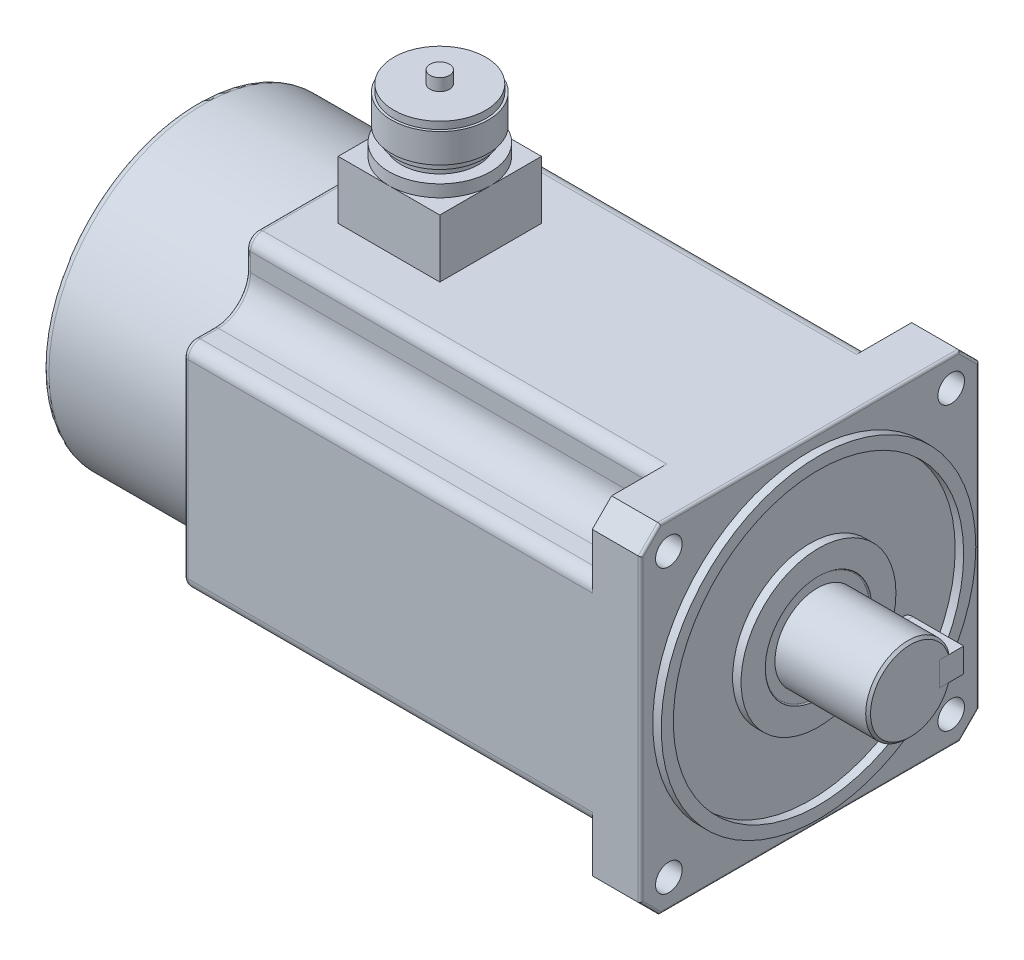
ISO-10303-21;
HEADER;
FILE_DESCRIPTION(('STEP AP214'),'2;1');
FILE_NAME('part.step','',(''),(''),'','','');
FILE_SCHEMA(('AUTOMOTIVE_DESIGN { 1 0 10303 214 1 1 1 1 }'));
ENDSEC;
DATA;
#1=APPLICATION_CONTEXT('core data for automotive mechanical design processes');
#2=APPLICATION_PROTOCOL_DEFINITION('international standard','automotive_design',2000,#1);
#3=PRODUCT_CONTEXT('',#1,'mechanical');
#4=PRODUCT('Part','Part','',(#3));
#5=PRODUCT_RELATED_PRODUCT_CATEGORY('part','',(#4));
#6=PRODUCT_DEFINITION_FORMATION('','',#4);
#7=PRODUCT_DEFINITION_CONTEXT('part definition',#1,'design');
#8=PRODUCT_DEFINITION('design','',#6,#7);
#9=PRODUCT_DEFINITION_SHAPE('','',#8);
#10=(LENGTH_UNIT() NAMED_UNIT(*) SI_UNIT(.MILLI.,.METRE.));
#11=(NAMED_UNIT(*) PLANE_ANGLE_UNIT() SI_UNIT($,.RADIAN.));
#12=(NAMED_UNIT(*) SI_UNIT($,.STERADIAN.) SOLID_ANGLE_UNIT());
#13=UNCERTAINTY_MEASURE_WITH_UNIT(LENGTH_MEASURE(1.E-05),#10,'distance_accuracy_value','');
#14=(GEOMETRIC_REPRESENTATION_CONTEXT(3) GLOBAL_UNCERTAINTY_ASSIGNED_CONTEXT((#13)) GLOBAL_UNIT_ASSIGNED_CONTEXT((#10,
#11,#12)) REPRESENTATION_CONTEXT('',''));
#15=CARTESIAN_POINT('',(0.,0.,0.));
#16=DIRECTION('',(0.,0.,1.));
#17=DIRECTION('',(1.,0.,0.));
#18=AXIS2_PLACEMENT_3D('',#15,#16,#17);
#19=CARTESIAN_POINT('',(20.5,0.,-22.));
#20=DIRECTION('',(0.,0.,1.));
#21=DIRECTION('',(1.,0.,0.));
#22=AXIS2_PLACEMENT_3D('',#19,#20,#21);
#23=CYLINDRICAL_SURFACE('',#22,5.);
#24=CARTESIAN_POINT('',(20.5,0.,-12.));
#25=DIRECTION('',(0.,0.,-1.));
#26=DIRECTION('',(-1.,0.,0.));
#27=AXIS2_PLACEMENT_3D('',#24,#25,#26);
#28=CIRCLE('',#27,5.);
#29=CARTESIAN_POINT('',(20.5,-5.,-12.));
#30=VERTEX_POINT('',#29);
#31=CARTESIAN_POINT('',(20.5,5.,-12.));
#32=VERTEX_POINT('',#31);
#33=EDGE_CURVE('E108',#30,#32,#28,.T.);
#34=ORIENTED_EDGE('',*,*,#33,.T.);
#35=DIRECTION('',(0.,0.,1.));
#36=VECTOR('',#35,1.);
#37=CARTESIAN_POINT('',(20.5,5.,-22.));
#38=LINE('',#37,#36);
#39=CARTESIAN_POINT('',(20.5,5.,-22.));
#40=VERTEX_POINT('',#39);
#41=EDGE_CURVE('E12',#40,#32,#38,.T.);
#42=ORIENTED_EDGE('',*,*,#41,.F.);
#43=CARTESIAN_POINT('',(20.5,0.,-22.));
#44=DIRECTION('',(0.,0.,-1.));
#45=DIRECTION('',(-1.,0.,0.));
#46=AXIS2_PLACEMENT_3D('',#43,#44,#45);
#47=CIRCLE('',#46,5.);
#48=CARTESIAN_POINT('',(20.5,-5.,-22.));
#49=VERTEX_POINT('',#48);
#50=EDGE_CURVE('E96',#49,#40,#47,.T.);
#51=ORIENTED_EDGE('',*,*,#50,.F.);
#52=DIRECTION('',(0.,0.,1.));
#53=VECTOR('',#52,1.);
#54=CARTESIAN_POINT('',(20.5,-5.,-22.));
#55=LINE('',#54,#53);
#56=EDGE_CURVE('E104',#49,#30,#55,.T.);
#57=ORIENTED_EDGE('',*,*,#56,.T.);
#58=EDGE_LOOP('',(#34,#42,#51,#57));
#59=FACE_BOUND('',#58,.T.);
#60=ADVANCED_FACE('F45',(#59),#23,.T.);
#61=CARTESIAN_POINT('',(20.5,5.,-22.));
#62=DIRECTION('',(0.,-1.,0.));
#63=DIRECTION('',(0.,0.,-1.));
#64=AXIS2_PLACEMENT_3D('',#61,#62,#63);
#65=PLANE('',#64);
#66=DIRECTION('',(1.,0.,0.));
#67=VECTOR('',#66,1.);
#68=CARTESIAN_POINT('',(20.5,5.,-12.));
#69=LINE('',#68,#67);
#70=CARTESIAN_POINT('',(41.5,5.,-12.));
#71=VERTEX_POINT('',#70);
#72=EDGE_CURVE('E100',#32,#71,#69,.T.);
#73=ORIENTED_EDGE('',*,*,#72,.T.);
#74=DIRECTION('',(0.,0.,1.));
#75=VECTOR('',#74,1.);
#76=CARTESIAN_POINT('',(41.5,5.,-22.));
#77=LINE('',#76,#75);
#78=CARTESIAN_POINT('',(41.5,5.,-22.));
#79=VERTEX_POINT('',#78);
#80=EDGE_CURVE('E53',#79,#71,#77,.T.);
#81=ORIENTED_EDGE('',*,*,#80,.F.);
#82=DIRECTION('',(1.,0.,0.));
#83=VECTOR('',#82,1.);
#84=CARTESIAN_POINT('',(20.5,5.,-22.));
#85=LINE('',#84,#83);
#86=EDGE_CURVE('E91',#40,#79,#85,.T.);
#87=ORIENTED_EDGE('',*,*,#86,.F.);
#88=ORIENTED_EDGE('',*,*,#41,.T.);
#89=EDGE_LOOP('',(#73,#81,#87,#88));
#90=FACE_BOUND('',#89,.T.);
#91=ADVANCED_FACE('F99',(#90),#65,.F.);
#92=CARTESIAN_POINT('',(41.5,5.,-22.));
#93=DIRECTION('',(-1.,0.,0.));
#94=DIRECTION('',(0.,0.,1.));
#95=AXIS2_PLACEMENT_3D('',#92,#93,#94);
#96=PLANE('',#95);
#97=DIRECTION('',(0.,-1.,0.));
#98=VECTOR('',#97,1.);
#99=CARTESIAN_POINT('',(41.5,5.,-12.));
#100=LINE('',#99,#98);
#101=CARTESIAN_POINT('',(41.5,-5.,-12.));
#102=VERTEX_POINT('',#101);
#103=EDGE_CURVE('E78',#71,#102,#100,.T.);
#104=ORIENTED_EDGE('',*,*,#103,.T.);
#105=DIRECTION('',(0.,0.,1.));
#106=VECTOR('',#105,1.);
#107=CARTESIAN_POINT('',(41.5,-5.,-22.));
#108=LINE('',#107,#106);
#109=CARTESIAN_POINT('',(41.5,-5.,-22.));
#110=VERTEX_POINT('',#109);
#111=EDGE_CURVE('E101',#110,#102,#108,.T.);
#112=ORIENTED_EDGE('',*,*,#111,.F.);
#113=DIRECTION('',(0.,-1.,0.));
#114=VECTOR('',#113,1.);
#115=CARTESIAN_POINT('',(41.5,5.,-22.));
#116=LINE('',#115,#114);
#117=EDGE_CURVE('E94',#79,#110,#116,.T.);
#118=ORIENTED_EDGE('',*,*,#117,.F.);
#119=ORIENTED_EDGE('',*,*,#80,.T.);
#120=EDGE_LOOP('',(#104,#112,#118,#119));
#121=FACE_BOUND('',#120,.T.);
#122=ADVANCED_FACE('F102',(#121),#96,.F.);
#123=CARTESIAN_POINT('',(41.5,-5.,-22.));
#124=DIRECTION('',(0.,1.,0.));
#125=DIRECTION('',(0.,0.,1.));
#126=AXIS2_PLACEMENT_3D('',#123,#124,#125);
#127=PLANE('',#126);
#128=DIRECTION('',(-1.,0.,0.));
#129=VECTOR('',#128,1.);
#130=CARTESIAN_POINT('',(41.5,-5.,-12.));
#131=LINE('',#130,#129);
#132=EDGE_CURVE('E84',#102,#30,#131,.T.);
#133=ORIENTED_EDGE('',*,*,#132,.T.);
#134=ORIENTED_EDGE('',*,*,#56,.F.);
#135=DIRECTION('',(-1.,0.,0.));
#136=VECTOR('',#135,1.);
#137=CARTESIAN_POINT('',(41.5,-5.,-22.));
#138=LINE('',#137,#136);
#139=EDGE_CURVE('E61',#110,#49,#138,.T.);
#140=ORIENTED_EDGE('',*,*,#139,.F.);
#141=ORIENTED_EDGE('',*,*,#111,.T.);
#142=EDGE_LOOP('',(#133,#134,#140,#141));
#143=FACE_BOUND('',#142,.T.);
#144=ADVANCED_FACE('F115',(#143),#127,.F.);
#145=CARTESIAN_POINT('',(20.5,0.,-22.));
#146=DIRECTION('',(0.,0.,-1.));
#147=DIRECTION('',(-1.,0.,0.));
#148=AXIS2_PLACEMENT_3D('',#145,#146,#147);
#149=PLANE('',#148);
#150=ORIENTED_EDGE('',*,*,#50,.T.);
#151=ORIENTED_EDGE('',*,*,#86,.T.);
#152=ORIENTED_EDGE('',*,*,#117,.T.);
#153=ORIENTED_EDGE('',*,*,#139,.T.);
#154=EDGE_LOOP('',(#150,#151,#152,#153));
#155=FACE_BOUND('',#154,.T.);
#156=ADVANCED_FACE('F92',(#155),#149,.T.);
#157=CARTESIAN_POINT('',(20.5,0.,-12.));
#158=DIRECTION('',(0.,0.,-1.));
#159=DIRECTION('',(-1.,0.,0.));
#160=AXIS2_PLACEMENT_3D('',#157,#158,#159);
#161=PLANE('',#160);
#162=ORIENTED_EDGE('',*,*,#33,.F.);
#163=ORIENTED_EDGE('',*,*,#132,.F.);
#164=ORIENTED_EDGE('',*,*,#103,.F.);
#165=ORIENTED_EDGE('',*,*,#72,.F.);
#166=EDGE_LOOP('',(#162,#163,#164,#165));
#167=FACE_BOUND('',#166,.T.);
#168=ADVANCED_FACE('F118',(#167),#161,.F.);
#169=CLOSED_SHELL('',(#60,#91,#122,#144,#156,#168));
#170=MANIFOLD_SOLID_BREP('B2',#169);
#171=CARTESIAN_POINT('',(-153.,120.,0.));
#172=DIRECTION('',(0.,1.,0.));
#173=DIRECTION('',(0.,0.,1.));
#174=AXIS2_PLACEMENT_3D('',#171,#172,#173);
#175=PLANE('',#174);
#176=CARTESIAN_POINT('',(-153.,120.,0.));
#177=DIRECTION('',(0.,1.,0.));
#178=DIRECTION('',(0.,0.,1.));
#179=AXIS2_PLACEMENT_3D('',#176,#177,#178);
#180=CIRCLE('',#179,19.);
#181=CARTESIAN_POINT('',(-153.,120.,19.));
#182=VERTEX_POINT('',#181);
#183=EDGE_CURVE('E2385',#182,#182,#180,.T.);
#184=ORIENTED_EDGE('',*,*,#183,.T.);
#185=EDGE_LOOP('',(#184));
#186=FACE_BOUND('',#185,.T.);
#187=CARTESIAN_POINT('',(-153.,120.,0.));
#188=DIRECTION('',(0.,1.,0.));
#189=DIRECTION('',(0.,0.,1.));
#190=AXIS2_PLACEMENT_3D('',#187,#188,#189);
#191=CIRCLE('',#190,3.99999999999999);
#192=CARTESIAN_POINT('',(-153.,120.,3.99999999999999));
#193=VERTEX_POINT('',#192);
#194=EDGE_CURVE('E2382',#193,#193,#191,.T.);
#195=ORIENTED_EDGE('',*,*,#194,.F.);
#196=EDGE_LOOP('',(#195));
#197=FACE_BOUND('',#196,.T.);
#198=ADVANCED_FACE('F169',(#186,#197),#175,.T.);
#199=CARTESIAN_POINT('',(-153.,117.,0.));
#200=DIRECTION('',(0.,1.,0.));
#201=DIRECTION('',(0.,0.,1.));
#202=AXIS2_PLACEMENT_3D('',#199,#200,#201);
#203=PLANE('',#202);
#204=CARTESIAN_POINT('',(-153.,117.,0.));
#205=DIRECTION('',(0.,1.,0.));
#206=DIRECTION('',(0.,0.,1.));
#207=AXIS2_PLACEMENT_3D('',#204,#205,#206);
#208=CIRCLE('',#207,20.);
#209=CARTESIAN_POINT('',(-153.,117.,20.));
#210=VERTEX_POINT('',#209);
#211=EDGE_CURVE('E2392',#210,#210,#208,.T.);
#212=ORIENTED_EDGE('',*,*,#211,.T.);
#213=EDGE_LOOP('',(#212));
#214=FACE_BOUND('',#213,.T.);
#215=CARTESIAN_POINT('',(-153.,117.,0.));
#216=DIRECTION('',(0.,1.,0.));
#217=DIRECTION('',(0.,0.,1.));
#218=AXIS2_PLACEMENT_3D('',#215,#216,#217);
#219=CIRCLE('',#218,19.);
#220=CARTESIAN_POINT('',(-153.,117.,19.));
#221=VERTEX_POINT('',#220);
#222=EDGE_CURVE('E2381',#221,#221,#219,.T.);
#223=ORIENTED_EDGE('',*,*,#222,.F.);
#224=EDGE_LOOP('',(#223));
#225=FACE_BOUND('',#224,.T.);
#226=ADVANCED_FACE('F1119',(#214,#225),#203,.T.);
#227=CARTESIAN_POINT('',(-153.,99.,0.));
#228=DIRECTION('',(0.,1.,0.));
#229=DIRECTION('',(0.,0.,1.));
#230=AXIS2_PLACEMENT_3D('',#227,#228,#229);
#231=PLANE('',#230);
#232=CARTESIAN_POINT('',(-153.,99.,0.));
#233=DIRECTION('',(0.,1.,0.));
#234=DIRECTION('',(0.,0.,1.));
#235=AXIS2_PLACEMENT_3D('',#232,#233,#234);
#236=CIRCLE('',#235,21.);
#237=CARTESIAN_POINT('',(-153.,99.,21.));
#238=VERTEX_POINT('',#237);
#239=EDGE_CURVE('E567',#238,#238,#236,.T.);
#240=ORIENTED_EDGE('',*,*,#239,.T.);
#241=EDGE_LOOP('',(#240));
#242=FACE_BOUND('',#241,.T.);
#243=CARTESIAN_POINT('',(-153.,99.,0.));
#244=DIRECTION('',(0.,1.,0.));
#245=DIRECTION('',(0.,0.,1.));
#246=AXIS2_PLACEMENT_3D('',#243,#244,#245);
#247=CIRCLE('',#246,16.);
#248=CARTESIAN_POINT('',(-153.,99.,16.));
#249=VERTEX_POINT('',#248);
#250=EDGE_CURVE('E2401',#249,#249,#247,.T.);
#251=ORIENTED_EDGE('',*,*,#250,.F.);
#252=EDGE_LOOP('',(#251));
#253=FACE_BOUND('',#252,.T.);
#254=ADVANCED_FACE('F1125',(#242,#253),#231,.T.);
#255=CARTESIAN_POINT('',(0.,94.,0.));
#256=DIRECTION('',(0.,-1.,0.));
#257=DIRECTION('',(0.,0.,-1.));
#258=AXIS2_PLACEMENT_3D('',#255,#256,#257);
#259=PLANE('',#258);
#260=CARTESIAN_POINT('',(-153.,94.,0.));
#261=DIRECTION('',(0.,1.,0.));
#262=DIRECTION('',(0.,0.,1.));
#263=AXIS2_PLACEMENT_3D('',#260,#261,#262);
#264=CIRCLE('',#263,21.);
#265=CARTESIAN_POINT('',(-153.,94.,21.));
#266=VERTEX_POINT('',#265);
#267=CARTESIAN_POINT('',(-132.,94.,0.));
#268=VERTEX_POINT('',#267);
#269=EDGE_CURVE('E185',#266,#268,#264,.T.);
#270=ORIENTED_EDGE('',*,*,#269,.F.);
#271=DIRECTION('',(1.,0.,0.));
#272=VECTOR('',#271,1.);
#273=CARTESIAN_POINT('',(-174.,94.,21.));
#274=LINE('',#273,#272);
#275=CARTESIAN_POINT('',(-132.,94.,21.));
#276=VERTEX_POINT('',#275);
#277=EDGE_CURVE('E553',#266,#276,#274,.T.);
#278=ORIENTED_EDGE('',*,*,#277,.T.);
#279=DIRECTION('',(0.,0.,-1.));
#280=VECTOR('',#279,1.);
#281=CARTESIAN_POINT('',(-132.,94.,21.));
#282=LINE('',#281,#280);
#283=EDGE_CURVE('E565',#276,#268,#282,.T.);
#284=ORIENTED_EDGE('',*,*,#283,.T.);
#285=EDGE_LOOP('',(#270,#278,#284));
#286=FACE_BOUND('',#285,.T.);
#287=ADVANCED_FACE('F564',(#286),#259,.F.);
#288=CARTESIAN_POINT('',(-153.,94.,-21.));
#289=VERTEX_POINT('',#288);
#290=EDGE_CURVE('E43',#268,#289,#264,.T.);
#291=ORIENTED_EDGE('',*,*,#290,.F.);
#292=CARTESIAN_POINT('',(-132.,94.,-21.));
#293=VERTEX_POINT('',#292);
#294=EDGE_CURVE('E576',#268,#293,#282,.T.);
#295=ORIENTED_EDGE('',*,*,#294,.T.);
#296=DIRECTION('',(-1.,0.,0.));
#297=VECTOR('',#296,1.);
#298=CARTESIAN_POINT('',(-174.,94.,-21.));
#299=LINE('',#298,#297);
#300=EDGE_CURVE('E577',#293,#289,#299,.T.);
#301=ORIENTED_EDGE('',*,*,#300,.T.);
#302=EDGE_LOOP('',(#291,#295,#301));
#303=FACE_BOUND('',#302,.T.);
#304=ADVANCED_FACE('F1166',(#303),#259,.F.);
#305=CARTESIAN_POINT('',(-174.,94.,0.));
#306=VERTEX_POINT('',#305);
#307=EDGE_CURVE('E183',#289,#306,#264,.T.);
#308=ORIENTED_EDGE('',*,*,#307,.F.);
#309=CARTESIAN_POINT('',(-174.,94.,-21.));
#310=VERTEX_POINT('',#309);
#311=EDGE_CURVE('E575',#289,#310,#299,.T.);
#312=ORIENTED_EDGE('',*,*,#311,.T.);
#313=DIRECTION('',(0.,0.,1.));
#314=VECTOR('',#313,1.);
#315=CARTESIAN_POINT('',(-174.,94.,21.));
#316=LINE('',#315,#314);
#317=EDGE_CURVE('E562',#310,#306,#316,.T.);
#318=ORIENTED_EDGE('',*,*,#317,.T.);
#319=EDGE_LOOP('',(#308,#312,#318));
#320=FACE_BOUND('',#319,.T.);
#321=ADVANCED_FACE('F1524',(#320),#259,.F.);
#322=EDGE_CURVE('E192',#306,#266,#264,.T.);
#323=ORIENTED_EDGE('',*,*,#322,.F.);
#324=CARTESIAN_POINT('',(-174.,94.,21.));
#325=VERTEX_POINT('',#324);
#326=EDGE_CURVE('E549',#306,#325,#316,.T.);
#327=ORIENTED_EDGE('',*,*,#326,.T.);
#328=EDGE_CURVE('E546',#325,#266,#274,.T.);
#329=ORIENTED_EDGE('',*,*,#328,.T.);
#330=EDGE_LOOP('',(#323,#327,#329));
#331=FACE_BOUND('',#330,.T.);
#332=ADVANCED_FACE('F548',(#331),#259,.F.);
#333=CARTESIAN_POINT('',(-189.,70.,62.));
#334=DIRECTION('',(0.,1.,0.));
#335=DIRECTION('',(0.,0.,1.));
#336=AXIS2_PLACEMENT_3D('',#333,#334,#335);
#337=PLANE('',#336);
#338=DIRECTION('',(1.,0.,0.));
#339=VECTOR('',#338,1.);
#340=CARTESIAN_POINT('',(-189.,70.,62.));
#341=LINE('',#340,#339);
#342=CARTESIAN_POINT('',(-20.,70.,62.));
#343=VERTEX_POINT('',#342);
#344=CARTESIAN_POINT('',(-1.,70.,62.));
#345=VERTEX_POINT('',#344);
#346=EDGE_CURVE('E819',#343,#345,#341,.T.);
#347=ORIENTED_EDGE('',*,*,#346,.T.);
#348=DIRECTION('',(0.,0.,1.));
#349=VECTOR('',#348,1.);
#350=CARTESIAN_POINT('',(-1.,70.,62.));
#351=LINE('',#350,#349);
#352=CARTESIAN_POINT('',(-1.,70.,-62.));
#353=VERTEX_POINT('',#352);
#354=EDGE_CURVE('E1057',#345,#353,#351,.F.);
#355=ORIENTED_EDGE('',*,*,#354,.T.);
#356=DIRECTION('',(1.,0.,0.));
#357=VECTOR('',#356,1.);
#358=CARTESIAN_POINT('',(-189.,70.,-62.));
#359=LINE('',#358,#357);
#360=CARTESIAN_POINT('',(-20.,70.,-62.));
#361=VERTEX_POINT('',#360);
#362=EDGE_CURVE('E834',#361,#353,#359,.T.);
#363=ORIENTED_EDGE('',*,*,#362,.F.);
#364=DIRECTION('',(0.,0.,-1.));
#365=VECTOR('',#364,1.);
#366=CARTESIAN_POINT('',(-20.,70.,-62.));
#367=LINE('',#366,#365);
#368=CARTESIAN_POINT('',(-20.,70.,-39.2146697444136));
#369=VERTEX_POINT('',#368);
#370=EDGE_CURVE('E808',#369,#361,#367,.T.);
#371=ORIENTED_EDGE('',*,*,#370,.F.);
#372=DIRECTION('',(-1.,0.,0.));
#373=VECTOR('',#372,1.);
#374=CARTESIAN_POINT('',(-20.,70.,-39.2146697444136));
#375=LINE('',#374,#373);
#376=CARTESIAN_POINT('',(-187.,70.,-39.2146697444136));
#377=VERTEX_POINT('',#376);
#378=EDGE_CURVE('E820',#369,#377,#375,.T.);
#379=ORIENTED_EDGE('',*,*,#378,.T.);
#380=DIRECTION('',(0.,0.,1.));
#381=VECTOR('',#380,1.);
#382=CARTESIAN_POINT('',(-187.,70.,39.2146697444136));
#383=LINE('',#382,#381);
#384=CARTESIAN_POINT('',(-187.,70.,39.2146697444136));
#385=VERTEX_POINT('',#384);
#386=EDGE_CURVE('E949',#377,#385,#383,.T.);
#387=ORIENTED_EDGE('',*,*,#386,.T.);
#388=DIRECTION('',(-1.,0.,0.));
#389=VECTOR('',#388,1.);
#390=CARTESIAN_POINT('',(-20.,70.,39.2146697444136));
#391=LINE('',#390,#389);
#392=CARTESIAN_POINT('',(-20.,70.,39.2146697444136));
#393=VERTEX_POINT('',#392);
#394=EDGE_CURVE('E703',#393,#385,#391,.T.);
#395=ORIENTED_EDGE('',*,*,#394,.F.);
#396=DIRECTION('',(0.,0.,-1.));
#397=VECTOR('',#396,1.);
#398=CARTESIAN_POINT('',(-20.,70.,39.2146697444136));
#399=LINE('',#398,#397);
#400=EDGE_CURVE('E686',#343,#393,#399,.T.);
#401=ORIENTED_EDGE('',*,*,#400,.F.);
#402=EDGE_LOOP('',(#347,#355,#363,#371,#379,#387,#395,#401));
#403=FACE_BOUND('',#402,.T.);
#404=DIRECTION('',(-1.,0.,0.));
#405=VECTOR('',#404,1.);
#406=CARTESIAN_POINT('',(-174.,70.,-21.));
#407=LINE('',#406,#405);
#408=CARTESIAN_POINT('',(-132.,70.,-21.));
#409=VERTEX_POINT('',#408);
#410=CARTESIAN_POINT('',(-174.,70.,-21.));
#411=VERTEX_POINT('',#410);
#412=EDGE_CURVE('E584',#409,#411,#407,.T.);
#413=ORIENTED_EDGE('',*,*,#412,.F.);
#414=DIRECTION('',(0.,0.,-1.));
#415=VECTOR('',#414,1.);
#416=CARTESIAN_POINT('',(-132.,70.,21.));
#417=LINE('',#416,#415);
#418=CARTESIAN_POINT('',(-132.,70.,21.));
#419=VERTEX_POINT('',#418);
#420=EDGE_CURVE('E581',#419,#409,#417,.T.);
#421=ORIENTED_EDGE('',*,*,#420,.F.);
#422=DIRECTION('',(1.,0.,0.));
#423=VECTOR('',#422,1.);
#424=CARTESIAN_POINT('',(-174.,70.,21.));
#425=LINE('',#424,#423);
#426=CARTESIAN_POINT('',(-174.,70.,21.));
#427=VERTEX_POINT('',#426);
#428=EDGE_CURVE('E589',#427,#419,#425,.T.);
#429=ORIENTED_EDGE('',*,*,#428,.F.);
#430=DIRECTION('',(0.,0.,1.));
#431=VECTOR('',#430,1.);
#432=CARTESIAN_POINT('',(-174.,70.,21.));
#433=LINE('',#432,#431);
#434=EDGE_CURVE('E586',#411,#427,#433,.T.);
#435=ORIENTED_EDGE('',*,*,#434,.F.);
#436=EDGE_LOOP('',(#413,#421,#429,#435));
#437=FACE_BOUND('',#436,.T.);
#438=ADVANCED_FACE('F1234',(#403,#437),#337,.T.);
#439=CARTESIAN_POINT('',(-189.,0.,0.));
#440=DIRECTION('',(1.,0.,0.));
#441=DIRECTION('',(0.,0.,-1.));
#442=AXIS2_PLACEMENT_3D('',#439,#440,#441);
#443=PLANE('',#442);
#444=DIRECTION('',(0.,0.,1.));
#445=VECTOR('',#444,1.);
#446=CARTESIAN_POINT('',(-189.,42.2146697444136,0.));
#447=LINE('',#446,#445);
#448=CARTESIAN_POINT('',(-189.,42.2146697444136,65.));
#449=VERTEX_POINT('',#448);
#450=CARTESIAN_POINT('',(-189.,42.2146697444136,57.5));
#451=VERTEX_POINT('',#450);
#452=EDGE_CURVE('E904',#449,#451,#447,.F.);
#453=ORIENTED_EDGE('',*,*,#452,.T.);
#454=CARTESIAN_POINT('',(-189.,57.5,57.5));
#455=DIRECTION('',(1.,0.,0.));
#456=DIRECTION('',(0.,0.,-1.));
#457=AXIS2_PLACEMENT_3D('',#454,#455,#456);
#458=CIRCLE('',#457,15.2853302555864);
#459=CARTESIAN_POINT('',(-189.,57.5,42.2146697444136));
#460=VERTEX_POINT('',#459);
#461=EDGE_CURVE('E906',#451,#460,#458,.T.);
#462=ORIENTED_EDGE('',*,*,#461,.T.);
#463=DIRECTION('',(0.,-1.,0.));
#464=VECTOR('',#463,1.);
#465=CARTESIAN_POINT('',(-189.,0.,42.2146697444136));
#466=LINE('',#465,#464);
#467=CARTESIAN_POINT('',(-189.,65.,42.2146697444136));
#468=VERTEX_POINT('',#467);
#469=EDGE_CURVE('E860',#460,#468,#466,.F.);
#470=ORIENTED_EDGE('',*,*,#469,.T.);
#471=CARTESIAN_POINT('',(-189.,65.,39.2146697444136));
#472=DIRECTION('',(1.,0.,0.));
#473=DIRECTION('',(0.,0.,-1.));
#474=AXIS2_PLACEMENT_3D('',#471,#472,#473);
#475=CIRCLE('',#474,3.);
#476=CARTESIAN_POINT('',(-189.,68.,39.2146697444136));
#477=VERTEX_POINT('',#476);
#478=EDGE_CURVE('E862',#468,#477,#475,.F.);
#479=ORIENTED_EDGE('',*,*,#478,.T.);
#480=DIRECTION('',(0.,0.,1.));
#481=VECTOR('',#480,1.);
#482=CARTESIAN_POINT('',(-189.,68.,-39.2146697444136));
#483=LINE('',#482,#481);
#484=CARTESIAN_POINT('',(-189.,68.,-39.2146697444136));
#485=VERTEX_POINT('',#484);
#486=EDGE_CURVE('E864',#477,#485,#483,.F.);
#487=ORIENTED_EDGE('',*,*,#486,.T.);
#488=CARTESIAN_POINT('',(-189.,65.,-39.2146697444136));
#489=DIRECTION('',(1.,0.,0.));
#490=DIRECTION('',(0.,0.,-1.));
#491=AXIS2_PLACEMENT_3D('',#488,#489,#490);
#492=CIRCLE('',#491,3.);
#493=CARTESIAN_POINT('',(-189.,64.9999999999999,-42.2146697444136));
#494=VERTEX_POINT('',#493);
#495=EDGE_CURVE('E866',#485,#494,#492,.F.);
#496=ORIENTED_EDGE('',*,*,#495,.T.);
#497=DIRECTION('',(0.,1.,0.));
#498=VECTOR('',#497,1.);
#499=CARTESIAN_POINT('',(-189.,0.,-42.2146697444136));
#500=LINE('',#499,#498);
#501=CARTESIAN_POINT('',(-189.,57.5,-42.2146697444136));
#502=VERTEX_POINT('',#501);
#503=EDGE_CURVE('E868',#494,#502,#500,.F.);
#504=ORIENTED_EDGE('',*,*,#503,.T.);
#505=CARTESIAN_POINT('',(-189.,57.5,-57.5));
#506=DIRECTION('',(1.,0.,0.));
#507=DIRECTION('',(0.,0.,-1.));
#508=AXIS2_PLACEMENT_3D('',#505,#506,#507);
#509=CIRCLE('',#508,15.2853302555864);
#510=CARTESIAN_POINT('',(-189.,42.2146697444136,-57.5));
#511=VERTEX_POINT('',#510);
#512=EDGE_CURVE('E870',#502,#511,#509,.T.);
#513=ORIENTED_EDGE('',*,*,#512,.T.);
#514=DIRECTION('',(0.,0.,1.));
#515=VECTOR('',#514,1.);
#516=CARTESIAN_POINT('',(-189.,42.2146697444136,0.));
#517=LINE('',#516,#515);
#518=CARTESIAN_POINT('',(-189.,42.2146697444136,-65.));
#519=VERTEX_POINT('',#518);
#520=EDGE_CURVE('E872',#511,#519,#517,.F.);
#521=ORIENTED_EDGE('',*,*,#520,.T.);
#522=CARTESIAN_POINT('',(-189.,39.2146697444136,-65.));
#523=DIRECTION('',(1.,0.,0.));
#524=DIRECTION('',(0.,0.,-1.));
#525=AXIS2_PLACEMENT_3D('',#522,#523,#524);
#526=CIRCLE('',#525,3.);
#527=CARTESIAN_POINT('',(-189.,39.2146697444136,-68.));
#528=VERTEX_POINT('',#527);
#529=EDGE_CURVE('E874',#519,#528,#526,.F.);
#530=ORIENTED_EDGE('',*,*,#529,.T.);
#531=DIRECTION('',(0.,1.,0.));
#532=VECTOR('',#531,1.);
#533=CARTESIAN_POINT('',(-189.,-39.2146697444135,-68.));
#534=LINE('',#533,#532);
#535=CARTESIAN_POINT('',(-189.,-39.2146697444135,-68.));
#536=VERTEX_POINT('',#535);
#537=EDGE_CURVE('E876',#528,#536,#534,.F.);
#538=ORIENTED_EDGE('',*,*,#537,.T.);
#539=CARTESIAN_POINT('',(-189.,-39.2146697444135,-65.));
#540=DIRECTION('',(1.,0.,0.));
#541=DIRECTION('',(0.,0.,-1.));
#542=AXIS2_PLACEMENT_3D('',#539,#540,#541);
#543=CIRCLE('',#542,3.);
#544=CARTESIAN_POINT('',(-189.,-42.2146697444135,-65.));
#545=VERTEX_POINT('',#544);
#546=EDGE_CURVE('E878',#536,#545,#543,.F.);
#547=ORIENTED_EDGE('',*,*,#546,.T.);
#548=DIRECTION('',(0.,0.,-1.));
#549=VECTOR('',#548,1.);
#550=CARTESIAN_POINT('',(-189.,-42.2146697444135,0.));
#551=LINE('',#550,#549);
#552=CARTESIAN_POINT('',(-189.,-42.2146697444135,-57.5));
#553=VERTEX_POINT('',#552);
#554=EDGE_CURVE('E880',#545,#553,#551,.F.);
#555=ORIENTED_EDGE('',*,*,#554,.T.);
#556=CARTESIAN_POINT('',(-189.,-57.5,-57.5));
#557=DIRECTION('',(1.,0.,0.));
#558=DIRECTION('',(0.,0.,-1.));
#559=AXIS2_PLACEMENT_3D('',#556,#557,#558);
#560=CIRCLE('',#559,15.2853302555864);
#561=CARTESIAN_POINT('',(-189.,-57.5,-42.2146697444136));
#562=VERTEX_POINT('',#561);
#563=EDGE_CURVE('E882',#553,#562,#560,.T.);
#564=ORIENTED_EDGE('',*,*,#563,.T.);
#565=DIRECTION('',(0.,1.,0.));
#566=VECTOR('',#565,1.);
#567=CARTESIAN_POINT('',(-189.,0.,-42.2146697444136));
#568=LINE('',#567,#566);
#569=CARTESIAN_POINT('',(-189.,-65.,-42.2146697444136));
#570=VERTEX_POINT('',#569);
#571=EDGE_CURVE('E884',#562,#570,#568,.F.);
#572=ORIENTED_EDGE('',*,*,#571,.T.);
#573=CARTESIAN_POINT('',(-189.,-65.,-39.2146697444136));
#574=DIRECTION('',(1.,0.,0.));
#575=DIRECTION('',(0.,0.,-1.));
#576=AXIS2_PLACEMENT_3D('',#573,#574,#575);
#577=CIRCLE('',#576,3.);
#578=CARTESIAN_POINT('',(-189.,-68.,-39.2146697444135));
#579=VERTEX_POINT('',#578);
#580=EDGE_CURVE('E886',#570,#579,#577,.F.);
#581=ORIENTED_EDGE('',*,*,#580,.T.);
#582=DIRECTION('',(0.,0.,-1.));
#583=VECTOR('',#582,1.);
#584=CARTESIAN_POINT('',(-189.,-68.,39.2146697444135));
#585=LINE('',#584,#583);
#586=CARTESIAN_POINT('',(-189.,-68.,39.2146697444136));
#587=VERTEX_POINT('',#586);
#588=EDGE_CURVE('E888',#579,#587,#585,.F.);
#589=ORIENTED_EDGE('',*,*,#588,.T.);
#590=CARTESIAN_POINT('',(-189.,-65.,39.2146697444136));
#591=DIRECTION('',(1.,0.,0.));
#592=DIRECTION('',(0.,0.,-1.));
#593=AXIS2_PLACEMENT_3D('',#590,#591,#592);
#594=CIRCLE('',#593,3.);
#595=CARTESIAN_POINT('',(-189.,-65.,42.2146697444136));
#596=VERTEX_POINT('',#595);
#597=EDGE_CURVE('E890',#587,#596,#594,.F.);
#598=ORIENTED_EDGE('',*,*,#597,.T.);
#599=DIRECTION('',(0.,-1.,0.));
#600=VECTOR('',#599,1.);
#601=CARTESIAN_POINT('',(-189.,0.,42.2146697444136));
#602=LINE('',#601,#600);
#603=CARTESIAN_POINT('',(-189.,-57.5,42.2146697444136));
#604=VERTEX_POINT('',#603);
#605=EDGE_CURVE('E892',#596,#604,#602,.F.);
#606=ORIENTED_EDGE('',*,*,#605,.T.);
#607=CARTESIAN_POINT('',(-189.,-57.5,57.5));
#608=DIRECTION('',(1.,0.,0.));
#609=DIRECTION('',(0.,0.,-1.));
#610=AXIS2_PLACEMENT_3D('',#607,#608,#609);
#611=CIRCLE('',#610,15.2853302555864);
#612=CARTESIAN_POINT('',(-189.,-42.2146697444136,57.5));
#613=VERTEX_POINT('',#612);
#614=EDGE_CURVE('E894',#604,#613,#611,.T.);
#615=ORIENTED_EDGE('',*,*,#614,.T.);
#616=DIRECTION('',(0.,0.,-1.));
#617=VECTOR('',#616,1.);
#618=CARTESIAN_POINT('',(-189.,-42.2146697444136,0.));
#619=LINE('',#618,#617);
#620=CARTESIAN_POINT('',(-189.,-42.2146697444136,65.));
#621=VERTEX_POINT('',#620);
#622=EDGE_CURVE('E896',#613,#621,#619,.F.);
#623=ORIENTED_EDGE('',*,*,#622,.T.);
#624=CARTESIAN_POINT('',(-189.,-39.2146697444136,65.));
#625=DIRECTION('',(1.,0.,0.));
#626=DIRECTION('',(0.,0.,-1.));
#627=AXIS2_PLACEMENT_3D('',#624,#625,#626);
#628=CIRCLE('',#627,3.);
#629=CARTESIAN_POINT('',(-189.,-39.2146697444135,68.));
#630=VERTEX_POINT('',#629);
#631=EDGE_CURVE('E898',#621,#630,#628,.F.);
#632=ORIENTED_EDGE('',*,*,#631,.T.);
#633=DIRECTION('',(0.,-1.,0.));
#634=VECTOR('',#633,1.);
#635=CARTESIAN_POINT('',(-189.,39.2146697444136,68.));
#636=LINE('',#635,#634);
#637=CARTESIAN_POINT('',(-189.,39.2146697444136,68.));
#638=VERTEX_POINT('',#637);
#639=EDGE_CURVE('E900',#630,#638,#636,.F.);
#640=ORIENTED_EDGE('',*,*,#639,.T.);
#641=CARTESIAN_POINT('',(-189.,39.2146697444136,65.));
#642=DIRECTION('',(1.,0.,0.));
#643=DIRECTION('',(0.,0.,-1.));
#644=AXIS2_PLACEMENT_3D('',#641,#642,#643);
#645=CIRCLE('',#644,3.);
#646=EDGE_CURVE('E902',#638,#449,#645,.F.);
#647=ORIENTED_EDGE('',*,*,#646,.T.);
#648=EDGE_LOOP('',(#453,#462,#470,#479,#487,#496,#504,#513,#521,#530,#538,#547,#555,#564,#572,
#581,#589,#598,#606,#615,#623,#632,#640,#647));
#649=FACE_BOUND('',#648,.T.);
#650=CARTESIAN_POINT('',(-189.,0.,0.));
#651=DIRECTION('',(1.,0.,0.));
#652=DIRECTION('',(0.,0.,-1.));
#653=AXIS2_PLACEMENT_3D('',#650,#651,#652);
#654=CIRCLE('',#653,64.);
#655=CARTESIAN_POINT('',(-189.,0.,-64.));
#656=VERTEX_POINT('',#655);
#657=EDGE_CURVE('E1092',#656,#656,#654,.F.);
#658=ORIENTED_EDGE('',*,*,#657,.F.);
#659=EDGE_LOOP('',(#658));
#660=FACE_BOUND('',#659,.T.);
#661=ADVANCED_FACE('F1116',(#649,#660),#443,.F.);
#662=CARTESIAN_POINT('',(41.5,0.,0.));
#663=DIRECTION('',(-1.,0.,0.));
#664=DIRECTION('',(0.,0.,1.));
#665=AXIS2_PLACEMENT_3D('',#662,#663,#664);
#666=CYLINDRICAL_SURFACE('',#665,17.5);
#667=CARTESIAN_POINT('',(3.,0.,0.));
#668=DIRECTION('',(1.,0.,0.));
#669=DIRECTION('',(0.,0.,-1.));
#670=AXIS2_PLACEMENT_3D('',#667,#668,#669);
#671=CIRCLE('',#670,17.5);
#672=CARTESIAN_POINT('',(3.,0.,-17.5));
#673=VERTEX_POINT('',#672);
#674=EDGE_CURVE('E626',#673,#673,#671,.T.);
#675=ORIENTED_EDGE('',*,*,#674,.T.);
#676=EDGE_LOOP('',(#675));
#677=FACE_BOUND('',#676,.T.);
#678=DIRECTION('',(-1.,0.,0.));
#679=VECTOR('',#678,1.);
#680=CARTESIAN_POINT('',(41.5,-5.,-16.7705098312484));
#681=LINE('',#680,#679);
#682=CARTESIAN_POINT('',(40.5,-5.,-16.7705098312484));
#683=VERTEX_POINT('',#682);
#684=CARTESIAN_POINT('',(20.5,-5.,-16.7705098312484));
#685=VERTEX_POINT('',#684);
#686=EDGE_CURVE('E624',#683,#685,#681,.T.);
#687=ORIENTED_EDGE('',*,*,#686,.F.);
#688=CARTESIAN_POINT('',(40.5,0.,0.));
#689=DIRECTION('',(1.,0.,0.));
#690=DIRECTION('',(0.,0.,-1.));
#691=AXIS2_PLACEMENT_3D('',#688,#689,#690);
#692=CIRCLE('',#691,17.5);
#693=CARTESIAN_POINT('',(40.5,5.,-16.7705098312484));
#694=VERTEX_POINT('',#693);
#695=EDGE_CURVE('E570',#683,#694,#692,.F.);
#696=ORIENTED_EDGE('',*,*,#695,.T.);
#697=DIRECTION('',(-1.,0.,0.));
#698=VECTOR('',#697,1.);
#699=CARTESIAN_POINT('',(41.5,5.,-16.7705098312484));
#700=LINE('',#699,#698);
#701=CARTESIAN_POINT('',(20.5,5.,-16.7705098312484));
#702=VERTEX_POINT('',#701);
#703=EDGE_CURVE('E621',#702,#694,#700,.F.);
#704=ORIENTED_EDGE('',*,*,#703,.F.);
#705=CARTESIAN_POINT('',(20.5,-5.,-16.7705098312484));
#706=CARTESIAN_POINT('',(20.3624562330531,-5.00001814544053,-16.7704912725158));
#707=CARTESIAN_POINT('',(20.2249193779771,-4.99432529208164,-16.7722013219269));
#708=CARTESIAN_POINT('',(19.9508888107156,-4.97165222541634,-16.7789431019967));
#709=CARTESIAN_POINT('',(19.8143948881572,-4.95467435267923,-16.7839741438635));
#710=CARTESIAN_POINT('',(19.5437415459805,-4.90961903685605,-16.7972068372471));
#711=CARTESIAN_POINT('',(19.4095773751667,-4.88156789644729,-16.8054009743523));
#712=CARTESIAN_POINT('',(19.1442003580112,-4.81461674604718,-16.8247046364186));
#713=CARTESIAN_POINT('',(19.012987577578,-4.77571649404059,-16.8358142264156));
#714=CARTESIAN_POINT('',(18.7544683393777,-4.68740449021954,-16.8606149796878));
#715=CARTESIAN_POINT('',(18.6271599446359,-4.63799805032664,-16.874304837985));
#716=CARTESIAN_POINT('',(18.3772006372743,-4.52905522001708,-16.9038705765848));
#717=CARTESIAN_POINT('',(18.2545514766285,-4.46951506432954,-16.9197472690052));
#718=CARTESIAN_POINT('',(17.894791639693,-4.27631278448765,-16.9699997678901));
#719=CARTESIAN_POINT('',(17.6657016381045,-4.12801150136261,-17.007014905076));
#720=CARTESIAN_POINT('',(17.2294860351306,-3.79229915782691,-17.0850471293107));
#721=CARTESIAN_POINT('',(17.023079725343,-3.60397767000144,-17.1261428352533));
#722=CARTESIAN_POINT('',(16.6442623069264,-3.19544341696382,-17.2070462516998));
#723=CARTESIAN_POINT('',(16.471856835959,-2.97522537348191,-17.2468537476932));
#724=CARTESIAN_POINT('',(16.1629219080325,-2.5041085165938,-17.3215844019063));
#725=CARTESIAN_POINT('',(16.0271190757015,-2.25271539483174,-17.3564029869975));
#726=CARTESIAN_POINT('',(15.7999922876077,-1.72950937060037,-17.4163145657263));
#727=CARTESIAN_POINT('',(15.7086576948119,-1.45770136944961,-17.4414098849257));
#728=CARTESIAN_POINT('',(15.5754142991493,-0.908899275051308,-17.4784878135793));
#729=CARTESIAN_POINT('',(15.5322781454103,-0.632225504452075,-17.4907954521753));
#730=CARTESIAN_POINT('',(15.4927833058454,-0.0753060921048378,-17.5020523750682));
#731=CARTESIAN_POINT('',(15.4964166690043,0.204938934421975,-17.5010039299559));
#732=CARTESIAN_POINT('',(15.5495154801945,0.752451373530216,-17.4859002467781));
#733=CARTESIAN_POINT('',(15.5976523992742,1.0198597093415,-17.4722220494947));
#734=CARTESIAN_POINT('',(15.7362408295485,1.54263514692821,-17.4338464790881));
#735=CARTESIAN_POINT('',(15.8266944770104,1.79800164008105,-17.4091485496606));
#736=CARTESIAN_POINT('',(16.0482663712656,2.29267928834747,-17.3509771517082));
#737=CARTESIAN_POINT('',(16.1798189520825,2.53178407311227,-17.3174105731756));
#738=CARTESIAN_POINT('',(16.4796443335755,2.98504901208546,-17.2450626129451));
#739=CARTESIAN_POINT('',(16.6479245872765,3.19920408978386,-17.2062801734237));
#740=CARTESIAN_POINT('',(16.9276273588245,3.50113424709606,-17.1465202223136));
#741=CARTESIAN_POINT('',(17.0273638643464,3.60007423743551,-17.1259700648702));
#742=CARTESIAN_POINT('',(17.2348202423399,3.78923134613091,-17.0851123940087));
#743=CARTESIAN_POINT('',(17.3425373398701,3.87945147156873,-17.0648047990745));
#744=CARTESIAN_POINT('',(17.5653450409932,4.05062437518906,-17.0249868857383));
#745=CARTESIAN_POINT('',(17.6804405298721,4.13157091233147,-17.005477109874));
#746=CARTESIAN_POINT('',(17.917160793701,4.28353981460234,-16.9678346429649));
#747=CARTESIAN_POINT('',(18.0387830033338,4.35456603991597,-16.9497014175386));
#748=CARTESIAN_POINT('',(18.2889159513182,4.48679157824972,-16.9151829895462));
#749=CARTESIAN_POINT('',(18.4174786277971,4.54789718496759,-16.898814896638));
#750=CARTESIAN_POINT('',(18.67954149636,4.65898872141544,-16.8685251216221));
#751=CARTESIAN_POINT('',(18.8130396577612,4.70897916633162,-16.8546024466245));
#752=CARTESIAN_POINT('',(19.0839210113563,4.79739484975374,-16.829649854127));
#753=CARTESIAN_POINT('',(19.2212999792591,4.83583217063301,-16.8186169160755));
#754=CARTESIAN_POINT('',(19.4989955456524,4.90084834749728,-16.7997865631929));
#755=CARTESIAN_POINT('',(19.6393107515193,4.92743269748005,-16.7919876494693));
#756=CARTESIAN_POINT('',(19.8996651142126,4.96528740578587,-16.7808301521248));
#757=CARTESIAN_POINT('',(20.0194316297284,4.97830600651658,-16.776966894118));
#758=CARTESIAN_POINT('',(20.2594622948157,4.99566040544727,-16.7718034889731));
#759=CARTESIAN_POINT('',(20.379725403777,5.00000944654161,-16.7704994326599));
#760=CARTESIAN_POINT('',(20.5,5.,-16.7705098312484));
#761=B_SPLINE_CURVE_WITH_KNOTS('',3,(#705,#706,#707,#708,#709,#710,#711,#712,#713,#714,#715,
#716,#717,#718,#719,#720,#721,#722,#723,#724,#725,#726,#727,#728,#729,#730,#731,#732,#733,#734,
#735,#736,#737,#738,#739,#740,#741,#742,#743,#744,#745,#746,#747,#748,#749,#750,#751,#752,#753,
#754,#755,#756,#757,#758,#759,#760),.UNSPECIFIED.,.F.,.F.,(4,2,2,2,2,2,2,2,2,2,2,2,2,2,2,2,2,2,
2,2,2,2,2,2,2,2,2,4),(0.,0.41249217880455,0.824898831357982,1.23633171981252,1.64777378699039,
2.05900832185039,2.47039598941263,3.29264569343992,4.13611232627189,4.9797186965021,
5.83900986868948,6.69809539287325,7.53476732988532,8.3712970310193,9.18363381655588,
9.99601161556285,10.8172828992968,11.6387209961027,12.0642579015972,12.489647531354,
12.9153217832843,13.3408299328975,13.7701489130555,14.1992931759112,14.6279870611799,
15.056482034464,15.4177510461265,15.7784677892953),.UNSPECIFIED.);
#762=EDGE_CURVE('E1085',#685,#702,#761,.T.);
#763=ORIENTED_EDGE('',*,*,#762,.F.);
#764=EDGE_LOOP('',(#687,#696,#704,#763));
#765=FACE_BOUND('',#764,.T.);
#766=ADVANCED_FACE('F1094',(#677,#765),#666,.T.);
#767=CARTESIAN_POINT('',(41.5,0.,0.));
#768=DIRECTION('',(1.,0.,0.));
#769=DIRECTION('',(0.,0.,-1.));
#770=AXIS2_PLACEMENT_3D('',#767,#768,#769);
#771=PLANE('',#770);
#772=DIRECTION('',(0.,0.,-1.));
#773=VECTOR('',#772,1.);
#774=CARTESIAN_POINT('',(41.5,5.,-12.));
#775=LINE('',#774,#773);
#776=CARTESIAN_POINT('',(41.5,5.,-12.));
#777=VERTEX_POINT('',#776);
#778=CARTESIAN_POINT('',(41.5,5.,-15.7241851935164));
#779=VERTEX_POINT('',#778);
#780=EDGE_CURVE('E612',#777,#779,#775,.T.);
#781=ORIENTED_EDGE('',*,*,#780,.T.);
#782=CARTESIAN_POINT('',(41.5,0.,0.));
#783=DIRECTION('',(1.,0.,0.));
#784=DIRECTION('',(0.,0.,-1.));
#785=AXIS2_PLACEMENT_3D('',#782,#783,#784);
#786=CIRCLE('',#785,16.5);
#787=CARTESIAN_POINT('',(41.5,-5.,-15.7241851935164));
#788=VERTEX_POINT('',#787);
#789=EDGE_CURVE('E1211',#779,#788,#786,.T.);
#790=ORIENTED_EDGE('',*,*,#789,.T.);
#791=DIRECTION('',(0.,0.,-1.));
#792=VECTOR('',#791,1.);
#793=CARTESIAN_POINT('',(41.5,-5.,-12.));
#794=LINE('',#793,#792);
#795=CARTESIAN_POINT('',(41.5,-5.,-12.));
#796=VERTEX_POINT('',#795);
#797=EDGE_CURVE('E615',#796,#788,#794,.T.);
#798=ORIENTED_EDGE('',*,*,#797,.F.);
#799=DIRECTION('',(0.,1.,0.));
#800=VECTOR('',#799,1.);
#801=CARTESIAN_POINT('',(41.5,5.,-12.));
#802=LINE('',#801,#800);
#803=EDGE_CURVE('E604',#796,#777,#802,.T.);
#804=ORIENTED_EDGE('',*,*,#803,.T.);
#805=EDGE_LOOP('',(#781,#790,#798,#804));
#806=FACE_BOUND('',#805,.T.);
#807=ADVANCED_FACE('F1106',(#806),#771,.T.);
#808=CARTESIAN_POINT('',(3.,0.,0.));
#809=DIRECTION('',(1.,0.,0.));
#810=DIRECTION('',(0.,0.,-1.));
#811=AXIS2_PLACEMENT_3D('',#808,#809,#810);
#812=PLANE('',#811);
#813=CARTESIAN_POINT('',(3.,0.,0.));
#814=DIRECTION('',(1.,0.,0.));
#815=DIRECTION('',(0.,0.,-1.));
#816=AXIS2_PLACEMENT_3D('',#813,#814,#815);
#817=CIRCLE('',#816,21.5);
#818=CARTESIAN_POINT('',(3.,0.,-21.5));
#819=VERTEX_POINT('',#818);
#820=EDGE_CURVE('E1082',#819,#819,#817,.T.);
#821=ORIENTED_EDGE('',*,*,#820,.T.);
#822=EDGE_LOOP('',(#821));
#823=FACE_BOUND('',#822,.T.);
#824=ORIENTED_EDGE('',*,*,#674,.F.);
#825=EDGE_LOOP('',(#824));
#826=FACE_BOUND('',#825,.T.);
#827=ADVANCED_FACE('F1108',(#823,#826),#812,.T.);
#828=CARTESIAN_POINT('',(0.,0.,0.));
#829=DIRECTION('',(1.,0.,0.));
#830=DIRECTION('',(0.,0.,-1.));
#831=AXIS2_PLACEMENT_3D('',#828,#829,#830);
#832=PLANE('',#831);
#833=CARTESIAN_POINT('',(0.,0.,0.));
#834=DIRECTION('',(1.,0.,0.));
#835=DIRECTION('',(0.,0.,-1.));
#836=AXIS2_PLACEMENT_3D('',#833,#834,#835);
#837=CIRCLE('',#836,60.);
#838=CARTESIAN_POINT('',(0.,0.,-60.));
#839=VERTEX_POINT('',#838);
#840=EDGE_CURVE('E1059',#839,#839,#837,.F.);
#841=ORIENTED_EDGE('',*,*,#840,.F.);
#842=EDGE_LOOP('',(#841));
#843=FACE_BOUND('',#842,.T.);
#844=CARTESIAN_POINT('',(0.,0.,0.));
#845=DIRECTION('',(1.,0.,0.));
#846=DIRECTION('',(0.,0.,-1.));
#847=AXIS2_PLACEMENT_3D('',#844,#845,#846);
#848=CIRCLE('',#847,32.);
#849=CARTESIAN_POINT('',(0.,0.,-32.));
#850=VERTEX_POINT('',#849);
#851=EDGE_CURVE('E632',#850,#850,#848,.T.);
#852=ORIENTED_EDGE('',*,*,#851,.F.);
#853=EDGE_LOOP('',(#852));
#854=FACE_BOUND('',#853,.T.);
#855=ADVANCED_FACE('F1114',(#843,#854),#832,.T.);
#856=CARTESIAN_POINT('',(0.,-58.3363094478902,58.3363094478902));
#857=DIRECTION('',(1.,0.,0.));
#858=DIRECTION('',(0.,0.,-1.));
#859=AXIS2_PLACEMENT_3D('',#856,#857,#858);
#860=CIRCLE('',#859,5.5);
#861=CARTESIAN_POINT('',(0.,-58.3363094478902,52.8363094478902));
#862=VERTEX_POINT('',#861);
#863=EDGE_CURVE('E645',#862,#862,#860,.T.);
#864=ORIENTED_EDGE('',*,*,#863,.F.);
#865=EDGE_LOOP('',(#864));
#866=FACE_BOUND('',#865,.T.);
#867=CARTESIAN_POINT('',(0.,-58.3363094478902,-58.3363094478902));
#868=DIRECTION('',(1.,0.,0.));
#869=DIRECTION('',(0.,0.,-1.));
#870=AXIS2_PLACEMENT_3D('',#867,#868,#869);
#871=CIRCLE('',#870,5.5);
#872=CARTESIAN_POINT('',(0.,-58.3363094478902,-63.8363094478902));
#873=VERTEX_POINT('',#872);
#874=EDGE_CURVE('E651',#873,#873,#871,.T.);
#875=ORIENTED_EDGE('',*,*,#874,.F.);
#876=EDGE_LOOP('',(#875));
#877=FACE_BOUND('',#876,.T.);
#878=CARTESIAN_POINT('',(0.,58.3363094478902,-58.3363094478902));
#879=DIRECTION('',(1.,0.,0.));
#880=DIRECTION('',(0.,0.,-1.));
#881=AXIS2_PLACEMENT_3D('',#878,#879,#880);
#882=CIRCLE('',#881,5.5);
#883=CARTESIAN_POINT('',(0.,58.3363094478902,-63.8363094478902));
#884=VERTEX_POINT('',#883);
#885=EDGE_CURVE('E657',#884,#884,#882,.T.);
#886=ORIENTED_EDGE('',*,*,#885,.F.);
#887=EDGE_LOOP('',(#886));
#888=FACE_BOUND('',#887,.T.);
#889=CARTESIAN_POINT('',(0.,58.3363094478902,58.3363094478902));
#890=DIRECTION('',(1.,0.,0.));
#891=DIRECTION('',(0.,0.,-1.));
#892=AXIS2_PLACEMENT_3D('',#889,#890,#891);
#893=CIRCLE('',#892,5.5);
#894=CARTESIAN_POINT('',(0.,58.3363094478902,52.8363094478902));
#895=VERTEX_POINT('',#894);
#896=EDGE_CURVE('E663',#895,#895,#893,.T.);
#897=ORIENTED_EDGE('',*,*,#896,.F.);
#898=EDGE_LOOP('',(#897));
#899=FACE_BOUND('',#898,.T.);
#900=DIRECTION('',(0.,1.,0.));
#901=VECTOR('',#900,1.);
#902=CARTESIAN_POINT('',(0.,0.,-69.));
#903=LINE('',#902,#901);
#904=CARTESIAN_POINT('',(0.,-61.5857864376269,-69.));
#905=VERTEX_POINT('',#904);
#906=CARTESIAN_POINT('',(0.,61.5857864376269,-69.));
#907=VERTEX_POINT('',#906);
#908=EDGE_CURVE('E1037',#905,#907,#903,.T.);
#909=ORIENTED_EDGE('',*,*,#908,.T.);
#910=DIRECTION('',(0.,0.707106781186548,0.707106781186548));
#911=VECTOR('',#910,1.);
#912=CARTESIAN_POINT('',(0.,65.2928932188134,-65.2928932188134));
#913=LINE('',#912,#911);
#914=CARTESIAN_POINT('',(0.,69.,-61.5857864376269));
#915=VERTEX_POINT('',#914);
#916=EDGE_CURVE('E1039',#907,#915,#913,.T.);
#917=ORIENTED_EDGE('',*,*,#916,.T.);
#918=DIRECTION('',(0.,0.,1.));
#919=VECTOR('',#918,1.);
#920=CARTESIAN_POINT('',(0.,69.,0.));
#921=LINE('',#920,#919);
#922=CARTESIAN_POINT('',(0.,69.,61.5857864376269));
#923=VERTEX_POINT('',#922);
#924=EDGE_CURVE('E955',#915,#923,#921,.T.);
#925=ORIENTED_EDGE('',*,*,#924,.T.);
#926=DIRECTION('',(0.,-0.707106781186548,0.707106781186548));
#927=VECTOR('',#926,1.);
#928=CARTESIAN_POINT('',(0.,65.2928932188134,65.2928932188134));
#929=LINE('',#928,#927);
#930=CARTESIAN_POINT('',(0.,61.5857864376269,69.));
#931=VERTEX_POINT('',#930);
#932=EDGE_CURVE('E1027',#923,#931,#929,.T.);
#933=ORIENTED_EDGE('',*,*,#932,.T.);
#934=DIRECTION('',(0.,-1.,0.));
#935=VECTOR('',#934,1.);
#936=CARTESIAN_POINT('',(0.,0.,69.));
#937=LINE('',#936,#935);
#938=CARTESIAN_POINT('',(0.,-61.5857864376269,69.));
#939=VERTEX_POINT('',#938);
#940=EDGE_CURVE('E1029',#931,#939,#937,.T.);
#941=ORIENTED_EDGE('',*,*,#940,.T.);
#942=DIRECTION('',(0.,-0.707106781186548,-0.707106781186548));
#943=VECTOR('',#942,1.);
#944=CARTESIAN_POINT('',(0.,-65.2928932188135,65.2928932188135));
#945=LINE('',#944,#943);
#946=CARTESIAN_POINT('',(0.,-69.,61.5857864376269));
#947=VERTEX_POINT('',#946);
#948=EDGE_CURVE('E1031',#939,#947,#945,.T.);
#949=ORIENTED_EDGE('',*,*,#948,.T.);
#950=DIRECTION('',(0.,0.,-1.));
#951=VECTOR('',#950,1.);
#952=CARTESIAN_POINT('',(0.,-69.,0.));
#953=LINE('',#952,#951);
#954=CARTESIAN_POINT('',(0.,-69.,-61.5857864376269));
#955=VERTEX_POINT('',#954);
#956=EDGE_CURVE('E1033',#947,#955,#953,.T.);
#957=ORIENTED_EDGE('',*,*,#956,.T.);
#958=DIRECTION('',(0.,0.707106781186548,-0.707106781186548));
#959=VECTOR('',#958,1.);
#960=CARTESIAN_POINT('',(0.,-65.2928932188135,-65.2928932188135));
#961=LINE('',#960,#959);
#962=EDGE_CURVE('E1035',#955,#905,#961,.T.);
#963=ORIENTED_EDGE('',*,*,#962,.T.);
#964=EDGE_LOOP('',(#909,#917,#925,#933,#941,#949,#957,#963));
#965=FACE_BOUND('',#964,.T.);
#966=CARTESIAN_POINT('',(0.,0.,0.));
#967=DIRECTION('',(1.,0.,0.));
#968=DIRECTION('',(0.,0.,-1.));
#969=AXIS2_PLACEMENT_3D('',#966,#967,#968);
#970=CIRCLE('',#969,65.);
#971=CARTESIAN_POINT('',(0.,0.,-65.));
#972=VERTEX_POINT('',#971);
#973=EDGE_CURVE('E641',#972,#972,#970,.T.);
#974=ORIENTED_EDGE('',*,*,#973,.F.);
#975=EDGE_LOOP('',(#974));
#976=FACE_BOUND('',#975,.T.);
#977=ADVANCED_FACE('F1248',(#866,#877,#888,#899,#965,#976),#832,.T.);
#978=CARTESIAN_POINT('',(-189.,62.,70.));
#979=DIRECTION('',(0.,0.707106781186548,0.707106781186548));
#980=DIRECTION('',(0.,-0.707106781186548,0.707106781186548));
#981=AXIS2_PLACEMENT_3D('',#978,#979,#980);
#982=PLANE('',#981);
#983=DIRECTION('',(1.,0.,0.));
#984=VECTOR('',#983,1.);
#985=CARTESIAN_POINT('',(-189.,62.,70.));
#986=LINE('',#985,#984);
#987=CARTESIAN_POINT('',(-20.,62.,70.));
#988=VERTEX_POINT('',#987);
#989=CARTESIAN_POINT('',(-1.,62.,70.));
#990=VERTEX_POINT('',#989);
#991=EDGE_CURVE('E853',#988,#990,#986,.T.);
#992=ORIENTED_EDGE('',*,*,#991,.T.);
#993=DIRECTION('',(0.,-0.707106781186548,0.707106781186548));
#994=VECTOR('',#993,1.);
#995=CARTESIAN_POINT('',(-1.,62.,70.));
#996=LINE('',#995,#994);
#997=EDGE_CURVE('E1055',#990,#345,#996,.F.);
#998=ORIENTED_EDGE('',*,*,#997,.T.);
#999=ORIENTED_EDGE('',*,*,#346,.F.);
#1000=DIRECTION('',(0.,0.707106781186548,-0.707106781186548));
#1001=VECTOR('',#1000,1.);
#1002=CARTESIAN_POINT('',(-20.,70.,62.));
#1003=LINE('',#1002,#1001);
#1004=EDGE_CURVE('E684',#988,#343,#1003,.T.);
#1005=ORIENTED_EDGE('',*,*,#1004,.F.);
#1006=EDGE_LOOP('',(#992,#998,#999,#1005));
#1007=FACE_BOUND('',#1006,.T.);
#1008=ADVANCED_FACE('F1270',(#1007),#982,.T.);
#1009=CARTESIAN_POINT('',(-189.,-70.,62.));
#1010=DIRECTION('',(0.,-0.707106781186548,0.707106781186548));
#1011=DIRECTION('',(0.,-0.707106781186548,-0.707106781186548));
#1012=AXIS2_PLACEMENT_3D('',#1009,#1010,#1011);
#1013=PLANE('',#1012);
#1014=DIRECTION('',(1.,0.,0.));
#1015=VECTOR('',#1014,1.);
#1016=CARTESIAN_POINT('',(-189.,-70.,62.));
#1017=LINE('',#1016,#1015);
#1018=CARTESIAN_POINT('',(-20.,-70.,62.));
#1019=VERTEX_POINT('',#1018);
#1020=CARTESIAN_POINT('',(-1.,-70.,62.));
#1021=VERTEX_POINT('',#1020);
#1022=EDGE_CURVE('E847',#1019,#1021,#1017,.T.);
#1023=ORIENTED_EDGE('',*,*,#1022,.T.);
#1024=DIRECTION('',(0.,-0.707106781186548,-0.707106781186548));
#1025=VECTOR('',#1024,1.);
#1026=CARTESIAN_POINT('',(-1.,-70.,62.));
#1027=LINE('',#1026,#1025);
#1028=CARTESIAN_POINT('',(-1.,-62.,70.));
#1029=VERTEX_POINT('',#1028);
#1030=EDGE_CURVE('E1051',#1021,#1029,#1027,.F.);
#1031=ORIENTED_EDGE('',*,*,#1030,.T.);
#1032=DIRECTION('',(1.,0.,0.));
#1033=VECTOR('',#1032,1.);
#1034=CARTESIAN_POINT('',(-189.,-62.,70.));
#1035=LINE('',#1034,#1033);
#1036=CARTESIAN_POINT('',(-20.,-62.,70.));
#1037=VERTEX_POINT('',#1036);
#1038=EDGE_CURVE('E850',#1037,#1029,#1035,.T.);
#1039=ORIENTED_EDGE('',*,*,#1038,.F.);
#1040=DIRECTION('',(0.,0.707106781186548,0.707106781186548));
#1041=VECTOR('',#1040,1.);
#1042=CARTESIAN_POINT('',(-20.,-62.,70.));
#1043=LINE('',#1042,#1041);
#1044=EDGE_CURVE('E724',#1019,#1037,#1043,.T.);
#1045=ORIENTED_EDGE('',*,*,#1044,.F.);
#1046=EDGE_LOOP('',(#1023,#1031,#1039,#1045));
#1047=FACE_BOUND('',#1046,.T.);
#1048=ADVANCED_FACE('F1267',(#1047),#1013,.T.);
#1049=CARTESIAN_POINT('',(-189.,-62.,70.));
#1050=DIRECTION('',(0.,0.,1.));
#1051=DIRECTION('',(1.,0.,0.));
#1052=AXIS2_PLACEMENT_3D('',#1049,#1050,#1051);
#1053=PLANE('',#1052);
#1054=ORIENTED_EDGE('',*,*,#1038,.T.);
#1055=DIRECTION('',(0.,-1.,0.));
#1056=VECTOR('',#1055,1.);
#1057=CARTESIAN_POINT('',(-1.,-62.,70.));
#1058=LINE('',#1057,#1056);
#1059=EDGE_CURVE('E1053',#1029,#990,#1058,.F.);
#1060=ORIENTED_EDGE('',*,*,#1059,.T.);
#1061=ORIENTED_EDGE('',*,*,#991,.F.);
#1062=DIRECTION('',(0.,1.,0.));
#1063=VECTOR('',#1062,1.);
#1064=CARTESIAN_POINT('',(-20.,62.,70.));
#1065=LINE('',#1064,#1063);
#1066=CARTESIAN_POINT('',(-20.,39.2146697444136,70.));
#1067=VERTEX_POINT('',#1066);
#1068=EDGE_CURVE('E682',#1067,#988,#1065,.T.);
#1069=ORIENTED_EDGE('',*,*,#1068,.F.);
#1070=DIRECTION('',(-1.,0.,0.));
#1071=VECTOR('',#1070,1.);
#1072=CARTESIAN_POINT('',(-20.,39.2146697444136,70.));
#1073=LINE('',#1072,#1071);
#1074=CARTESIAN_POINT('',(-187.,39.2146697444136,70.));
#1075=VERTEX_POINT('',#1074);
#1076=EDGE_CURVE('E706',#1067,#1075,#1073,.T.);
#1077=ORIENTED_EDGE('',*,*,#1076,.T.);
#1078=DIRECTION('',(0.,-1.,0.));
#1079=VECTOR('',#1078,1.);
#1080=CARTESIAN_POINT('',(-187.,-39.2146697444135,70.));
#1081=LINE('',#1080,#1079);
#1082=CARTESIAN_POINT('',(-187.,-39.2146697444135,70.));
#1083=VERTEX_POINT('',#1082);
#1084=EDGE_CURVE('E913',#1075,#1083,#1081,.T.);
#1085=ORIENTED_EDGE('',*,*,#1084,.T.);
#1086=DIRECTION('',(-1.,0.,0.));
#1087=VECTOR('',#1086,1.);
#1088=CARTESIAN_POINT('',(-20.,-39.2146697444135,70.));
#1089=LINE('',#1088,#1087);
#1090=CARTESIAN_POINT('',(-20.,-39.2146697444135,70.));
#1091=VERTEX_POINT('',#1090);
#1092=EDGE_CURVE('E743',#1091,#1083,#1089,.T.);
#1093=ORIENTED_EDGE('',*,*,#1092,.F.);
#1094=DIRECTION('',(0.,1.,0.));
#1095=VECTOR('',#1094,1.);
#1096=CARTESIAN_POINT('',(-20.,-39.2146697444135,70.));
#1097=LINE('',#1096,#1095);
#1098=EDGE_CURVE('E726',#1037,#1091,#1097,.T.);
#1099=ORIENTED_EDGE('',*,*,#1098,.F.);
#1100=EDGE_LOOP('',(#1054,#1060,#1061,#1069,#1077,#1085,#1093,#1099));
#1101=FACE_BOUND('',#1100,.T.);
#1102=ADVANCED_FACE('F1262',(#1101),#1053,.T.);
#1103=CARTESIAN_POINT('',(-189.,-70.,-62.));
#1104=DIRECTION('',(0.,-0.707106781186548,-0.707106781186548));
#1105=DIRECTION('',(0.,0.707106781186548,-0.707106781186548));
#1106=AXIS2_PLACEMENT_3D('',#1103,#1104,#1105);
#1107=PLANE('',#1106);
#1108=DIRECTION('',(1.,0.,0.));
#1109=VECTOR('',#1108,1.);
#1110=CARTESIAN_POINT('',(-189.,-62.,-70.));
#1111=LINE('',#1110,#1109);
#1112=CARTESIAN_POINT('',(-20.,-62.,-70.));
#1113=VERTEX_POINT('',#1112);
#1114=CARTESIAN_POINT('',(-1.,-62.,-70.));
#1115=VERTEX_POINT('',#1114);
#1116=EDGE_CURVE('E841',#1113,#1115,#1111,.T.);
#1117=ORIENTED_EDGE('',*,*,#1116,.T.);
#1118=DIRECTION('',(0.,0.707106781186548,-0.707106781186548));
#1119=VECTOR('',#1118,1.);
#1120=CARTESIAN_POINT('',(-1.,-70.,-62.));
#1121=LINE('',#1120,#1119);
#1122=CARTESIAN_POINT('',(-1.,-70.,-62.));
#1123=VERTEX_POINT('',#1122);
#1124=EDGE_CURVE('E1047',#1115,#1123,#1121,.F.);
#1125=ORIENTED_EDGE('',*,*,#1124,.T.);
#1126=DIRECTION('',(1.,0.,0.));
#1127=VECTOR('',#1126,1.);
#1128=CARTESIAN_POINT('',(-189.,-70.,-62.));
#1129=LINE('',#1128,#1127);
#1130=CARTESIAN_POINT('',(-20.,-70.,-62.));
#1131=VERTEX_POINT('',#1130);
#1132=EDGE_CURVE('E844',#1131,#1123,#1129,.T.);
#1133=ORIENTED_EDGE('',*,*,#1132,.F.);
#1134=DIRECTION('',(0.,-0.707106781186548,0.707106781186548));
#1135=VECTOR('',#1134,1.);
#1136=CARTESIAN_POINT('',(-20.,-70.,-62.));
#1137=LINE('',#1136,#1135);
#1138=EDGE_CURVE('E758',#1113,#1131,#1137,.T.);
#1139=ORIENTED_EDGE('',*,*,#1138,.F.);
#1140=EDGE_LOOP('',(#1117,#1125,#1133,#1139));
#1141=FACE_BOUND('',#1140,.T.);
#1142=ADVANCED_FACE('F1259',(#1141),#1107,.T.);
#1143=CARTESIAN_POINT('',(-189.,-70.,62.));
#1144=DIRECTION('',(0.,-1.,0.));
#1145=DIRECTION('',(0.,0.,-1.));
#1146=AXIS2_PLACEMENT_3D('',#1143,#1144,#1145);
#1147=PLANE('',#1146);
#1148=ORIENTED_EDGE('',*,*,#1132,.T.);
#1149=DIRECTION('',(0.,0.,-1.));
#1150=VECTOR('',#1149,1.);
#1151=CARTESIAN_POINT('',(-1.,-70.,62.));
#1152=LINE('',#1151,#1150);
#1153=EDGE_CURVE('E1049',#1123,#1021,#1152,.F.);
#1154=ORIENTED_EDGE('',*,*,#1153,.T.);
#1155=ORIENTED_EDGE('',*,*,#1022,.F.);
#1156=DIRECTION('',(0.,0.,1.));
#1157=VECTOR('',#1156,1.);
#1158=CARTESIAN_POINT('',(-20.,-70.,62.));
#1159=LINE('',#1158,#1157);
#1160=CARTESIAN_POINT('',(-20.,-70.,39.2146697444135));
#1161=VERTEX_POINT('',#1160);
#1162=EDGE_CURVE('E722',#1161,#1019,#1159,.T.);
#1163=ORIENTED_EDGE('',*,*,#1162,.F.);
#1164=DIRECTION('',(-1.,0.,0.));
#1165=VECTOR('',#1164,1.);
#1166=CARTESIAN_POINT('',(-20.,-70.,39.2146697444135));
#1167=LINE('',#1166,#1165);
#1168=CARTESIAN_POINT('',(-187.,-70.,39.2146697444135));
#1169=VERTEX_POINT('',#1168);
#1170=EDGE_CURVE('E746',#1161,#1169,#1167,.T.);
#1171=ORIENTED_EDGE('',*,*,#1170,.T.);
#1172=DIRECTION('',(0.,0.,-1.));
#1173=VECTOR('',#1172,1.);
#1174=CARTESIAN_POINT('',(-187.,-70.,-39.2146697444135));
#1175=LINE('',#1174,#1173);
#1176=CARTESIAN_POINT('',(-187.,-70.,-39.2146697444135));
#1177=VERTEX_POINT('',#1176);
#1178=EDGE_CURVE('E925',#1169,#1177,#1175,.T.);
#1179=ORIENTED_EDGE('',*,*,#1178,.T.);
#1180=DIRECTION('',(-1.,0.,0.));
#1181=VECTOR('',#1180,1.);
#1182=CARTESIAN_POINT('',(-20.,-70.,-39.2146697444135));
#1183=LINE('',#1182,#1181);
#1184=CARTESIAN_POINT('',(-20.,-70.,-39.2146697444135));
#1185=VERTEX_POINT('',#1184);
#1186=EDGE_CURVE('E789',#1185,#1177,#1183,.T.);
#1187=ORIENTED_EDGE('',*,*,#1186,.F.);
#1188=DIRECTION('',(0.,0.,1.));
#1189=VECTOR('',#1188,1.);
#1190=CARTESIAN_POINT('',(-20.,-70.,-39.2146697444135));
#1191=LINE('',#1190,#1189);
#1192=EDGE_CURVE('E760',#1131,#1185,#1191,.T.);
#1193=ORIENTED_EDGE('',*,*,#1192,.F.);
#1194=EDGE_LOOP('',(#1148,#1154,#1155,#1163,#1171,#1179,#1187,#1193));
#1195=FACE_BOUND('',#1194,.T.);
#1196=ADVANCED_FACE('F1254',(#1195),#1147,.T.);
#1197=CARTESIAN_POINT('',(-189.,62.,-70.));
#1198=DIRECTION('',(0.,0.707106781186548,-0.707106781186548));
#1199=DIRECTION('',(0.,0.707106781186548,0.707106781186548));
#1200=AXIS2_PLACEMENT_3D('',#1197,#1198,#1199);
#1201=PLANE('',#1200);
#1202=ORIENTED_EDGE('',*,*,#362,.T.);
#1203=DIRECTION('',(0.,0.707106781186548,0.707106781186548));
#1204=VECTOR('',#1203,1.);
#1205=CARTESIAN_POINT('',(-1.,62.,-70.));
#1206=LINE('',#1205,#1204);
#1207=CARTESIAN_POINT('',(-1.,62.,-70.));
#1208=VERTEX_POINT('',#1207);
#1209=EDGE_CURVE('E1042',#353,#1208,#1206,.F.);
#1210=ORIENTED_EDGE('',*,*,#1209,.T.);
#1211=DIRECTION('',(1.,0.,0.));
#1212=VECTOR('',#1211,1.);
#1213=CARTESIAN_POINT('',(-189.,62.,-70.));
#1214=LINE('',#1213,#1212);
#1215=CARTESIAN_POINT('',(-20.,62.,-70.));
#1216=VERTEX_POINT('',#1215);
#1217=EDGE_CURVE('E838',#1216,#1208,#1214,.T.);
#1218=ORIENTED_EDGE('',*,*,#1217,.F.);
#1219=DIRECTION('',(0.,-0.707106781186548,-0.707106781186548));
#1220=VECTOR('',#1219,1.);
#1221=CARTESIAN_POINT('',(-20.,62.,-70.));
#1222=LINE('',#1221,#1220);
#1223=EDGE_CURVE('E810',#361,#1216,#1222,.T.);
#1224=ORIENTED_EDGE('',*,*,#1223,.F.);
#1225=EDGE_LOOP('',(#1202,#1210,#1218,#1224));
#1226=FACE_BOUND('',#1225,.T.);
#1227=ADVANCED_FACE('F1250',(#1226),#1201,.T.);
#1228=CARTESIAN_POINT('',(-189.,-62.,-70.));
#1229=DIRECTION('',(0.,0.,-1.));
#1230=DIRECTION('',(-1.,0.,0.));
#1231=AXIS2_PLACEMENT_3D('',#1228,#1229,#1230);
#1232=PLANE('',#1231);
#1233=ORIENTED_EDGE('',*,*,#1217,.T.);
#1234=DIRECTION('',(0.,1.,0.));
#1235=VECTOR('',#1234,1.);
#1236=CARTESIAN_POINT('',(-1.,-62.,-70.));
#1237=LINE('',#1236,#1235);
#1238=EDGE_CURVE('E1045',#1208,#1115,#1237,.F.);
#1239=ORIENTED_EDGE('',*,*,#1238,.T.);
#1240=ORIENTED_EDGE('',*,*,#1116,.F.);
#1241=DIRECTION('',(0.,-1.,0.));
#1242=VECTOR('',#1241,1.);
#1243=CARTESIAN_POINT('',(-20.,-62.,-70.));
#1244=LINE('',#1243,#1242);
#1245=CARTESIAN_POINT('',(-20.,-39.2146697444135,-70.));
#1246=VERTEX_POINT('',#1245);
#1247=EDGE_CURVE('E756',#1246,#1113,#1244,.T.);
#1248=ORIENTED_EDGE('',*,*,#1247,.F.);
#1249=DIRECTION('',(-1.,0.,0.));
#1250=VECTOR('',#1249,1.);
#1251=CARTESIAN_POINT('',(-20.,-39.2146697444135,-70.));
#1252=LINE('',#1251,#1250);
#1253=CARTESIAN_POINT('',(-187.,-39.2146697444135,-70.));
#1254=VERTEX_POINT('',#1253);
#1255=EDGE_CURVE('E775',#1246,#1254,#1252,.T.);
#1256=ORIENTED_EDGE('',*,*,#1255,.T.);
#1257=DIRECTION('',(0.,1.,0.));
#1258=VECTOR('',#1257,1.);
#1259=CARTESIAN_POINT('',(-187.,39.2146697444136,-70.));
#1260=LINE('',#1259,#1258);
#1261=CARTESIAN_POINT('',(-187.,39.2146697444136,-70.));
#1262=VERTEX_POINT('',#1261);
#1263=EDGE_CURVE('E937',#1254,#1262,#1260,.T.);
#1264=ORIENTED_EDGE('',*,*,#1263,.T.);
#1265=DIRECTION('',(-1.,0.,0.));
#1266=VECTOR('',#1265,1.);
#1267=CARTESIAN_POINT('',(-20.,39.2146697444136,-70.));
#1268=LINE('',#1267,#1266);
#1269=CARTESIAN_POINT('',(-20.,39.2146697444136,-70.));
#1270=VERTEX_POINT('',#1269);
#1271=EDGE_CURVE('E816',#1270,#1262,#1268,.T.);
#1272=ORIENTED_EDGE('',*,*,#1271,.F.);
#1273=DIRECTION('',(0.,-1.,0.));
#1274=VECTOR('',#1273,1.);
#1275=CARTESIAN_POINT('',(-20.,39.2146697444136,-70.));
#1276=LINE('',#1275,#1274);
#1277=EDGE_CURVE('E812',#1216,#1270,#1276,.T.);
#1278=ORIENTED_EDGE('',*,*,#1277,.F.);
#1279=EDGE_LOOP('',(#1233,#1239,#1240,#1248,#1256,#1264,#1272,#1278));
#1280=FACE_BOUND('',#1279,.T.);
#1281=ADVANCED_FACE('F1253',(#1280),#1232,.T.);
#1282=CARTESIAN_POINT('',(-20.,39.2146697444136,-65.));
#1283=DIRECTION('',(-1.,0.,0.));
#1284=DIRECTION('',(0.,0.,1.));
#1285=AXIS2_PLACEMENT_3D('',#1282,#1283,#1284);
#1286=CYLINDRICAL_SURFACE('',#1285,5.);
#1287=ORIENTED_EDGE('',*,*,#1271,.T.);
#1288=CARTESIAN_POINT('',(-187.,39.2146697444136,-65.));
#1289=DIRECTION('',(1.,0.,0.));
#1290=DIRECTION('',(0.,0.,-1.));
#1291=AXIS2_PLACEMENT_3D('',#1288,#1289,#1290);
#1292=CIRCLE('',#1291,5.);
#1293=CARTESIAN_POINT('',(-187.,44.2146697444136,-65.));
#1294=VERTEX_POINT('',#1293);
#1295=EDGE_CURVE('E939',#1262,#1294,#1292,.T.);
#1296=ORIENTED_EDGE('',*,*,#1295,.T.);
#1297=DIRECTION('',(-1.,0.,0.));
#1298=VECTOR('',#1297,1.);
#1299=CARTESIAN_POINT('',(-20.,44.2146697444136,-65.));
#1300=LINE('',#1299,#1298);
#1301=CARTESIAN_POINT('',(-20.,44.2146697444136,-65.));
#1302=VERTEX_POINT('',#1301);
#1303=EDGE_CURVE('E815',#1302,#1294,#1300,.T.);
#1304=ORIENTED_EDGE('',*,*,#1303,.F.);
#1305=CARTESIAN_POINT('',(-20.,39.2146697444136,-65.));
#1306=DIRECTION('',(1.,0.,0.));
#1307=DIRECTION('',(0.,0.,1.));
#1308=AXIS2_PLACEMENT_3D('',#1305,#1306,#1307);
#1309=CIRCLE('',#1308,5.);
#1310=EDGE_CURVE('E779',#1270,#1302,#1309,.T.);
#1311=ORIENTED_EDGE('',*,*,#1310,.F.);
#1312=EDGE_LOOP('',(#1287,#1296,#1304,#1311));
#1313=FACE_BOUND('',#1312,.T.);
#1314=ADVANCED_FACE('F1244',(#1313),#1286,.T.);
#1315=CARTESIAN_POINT('',(-20.,65.,-39.2146697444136));
#1316=DIRECTION('',(-1.,0.,0.));
#1317=DIRECTION('',(0.,0.,1.));
#1318=AXIS2_PLACEMENT_3D('',#1315,#1316,#1317);
#1319=CYLINDRICAL_SURFACE('',#1318,5.);
#1320=DIRECTION('',(-1.,0.,0.));
#1321=VECTOR('',#1320,1.);
#1322=CARTESIAN_POINT('',(-20.,64.9999999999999,-44.2146697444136));
#1323=LINE('',#1322,#1321);
#1324=CARTESIAN_POINT('',(-20.,64.9999999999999,-44.2146697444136));
#1325=VERTEX_POINT('',#1324);
#1326=CARTESIAN_POINT('',(-187.,64.9999999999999,-44.2146697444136));
#1327=VERTEX_POINT('',#1326);
#1328=EDGE_CURVE('E823',#1325,#1327,#1323,.T.);
#1329=ORIENTED_EDGE('',*,*,#1328,.T.);
#1330=CARTESIAN_POINT('',(-187.,65.,-39.2146697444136));
#1331=DIRECTION('',(1.,0.,0.));
#1332=DIRECTION('',(0.,0.,-1.));
#1333=AXIS2_PLACEMENT_3D('',#1330,#1331,#1332);
#1334=CIRCLE('',#1333,5.);
#1335=EDGE_CURVE('E947',#1327,#377,#1334,.T.);
#1336=ORIENTED_EDGE('',*,*,#1335,.T.);
#1337=ORIENTED_EDGE('',*,*,#378,.F.);
#1338=CARTESIAN_POINT('',(-20.,65.,-39.2146697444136));
#1339=DIRECTION('',(1.,0.,0.));
#1340=DIRECTION('',(0.,0.,1.));
#1341=AXIS2_PLACEMENT_3D('',#1338,#1339,#1340);
#1342=CIRCLE('',#1341,5.);
#1343=EDGE_CURVE('E805',#1325,#369,#1342,.T.);
#1344=ORIENTED_EDGE('',*,*,#1343,.F.);
#1345=EDGE_LOOP('',(#1329,#1336,#1337,#1344));
#1346=FACE_BOUND('',#1345,.T.);
#1347=ADVANCED_FACE('F2054',(#1346),#1319,.T.);
#1348=CARTESIAN_POINT('',(-20.,64.9999999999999,-44.2146697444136));
#1349=DIRECTION('',(0.,0.,1.));
#1350=DIRECTION('',(1.,0.,0.));
#1351=AXIS2_PLACEMENT_3D('',#1348,#1349,#1350);
#1352=PLANE('',#1351);
#1353=DIRECTION('',(-1.,0.,0.));
#1354=VECTOR('',#1353,1.);
#1355=CARTESIAN_POINT('',(-20.,57.5,-44.2146697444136));
#1356=LINE('',#1355,#1354);
#1357=CARTESIAN_POINT('',(-20.,57.5,-44.2146697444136));
#1358=VERTEX_POINT('',#1357);
#1359=CARTESIAN_POINT('',(-187.,57.5,-44.2146697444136));
#1360=VERTEX_POINT('',#1359);
#1361=EDGE_CURVE('E826',#1358,#1360,#1356,.T.);
#1362=ORIENTED_EDGE('',*,*,#1361,.T.);
#1363=DIRECTION('',(0.,1.,0.));
#1364=VECTOR('',#1363,1.);
#1365=CARTESIAN_POINT('',(-187.,64.9999999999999,-44.2146697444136));
#1366=LINE('',#1365,#1364);
#1367=EDGE_CURVE('E945',#1360,#1327,#1366,.T.);
#1368=ORIENTED_EDGE('',*,*,#1367,.T.);
#1369=ORIENTED_EDGE('',*,*,#1328,.F.);
#1370=DIRECTION('',(0.,1.,0.));
#1371=VECTOR('',#1370,1.);
#1372=CARTESIAN_POINT('',(-20.,64.9999999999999,-44.2146697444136));
#1373=LINE('',#1372,#1371);
#1374=EDGE_CURVE('E802',#1358,#1325,#1373,.T.);
#1375=ORIENTED_EDGE('',*,*,#1374,.F.);
#1376=EDGE_LOOP('',(#1362,#1368,#1369,#1375));
#1377=FACE_BOUND('',#1376,.T.);
#1378=ADVANCED_FACE('F2045',(#1377),#1352,.F.);
#1379=CARTESIAN_POINT('',(-20.,57.5,-57.5));
#1380=DIRECTION('',(-1.,0.,0.));
#1381=DIRECTION('',(0.,0.,1.));
#1382=AXIS2_PLACEMENT_3D('',#1379,#1380,#1381);
#1383=CYLINDRICAL_SURFACE('',#1382,13.2853302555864);
#1384=DIRECTION('',(-1.,0.,0.));
#1385=VECTOR('',#1384,1.);
#1386=CARTESIAN_POINT('',(-20.,44.2146697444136,-57.5));
#1387=LINE('',#1386,#1385);
#1388=CARTESIAN_POINT('',(-20.,44.2146697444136,-57.5));
#1389=VERTEX_POINT('',#1388);
#1390=CARTESIAN_POINT('',(-187.,44.2146697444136,-57.5));
#1391=VERTEX_POINT('',#1390);
#1392=EDGE_CURVE('E829',#1389,#1391,#1387,.T.);
#1393=ORIENTED_EDGE('',*,*,#1392,.T.);
#1394=CARTESIAN_POINT('',(-187.,57.5,-57.5));
#1395=DIRECTION('',(1.,0.,0.));
#1396=DIRECTION('',(0.,0.,-1.));
#1397=AXIS2_PLACEMENT_3D('',#1394,#1395,#1396);
#1398=CIRCLE('',#1397,13.2853302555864);
#1399=EDGE_CURVE('E943',#1391,#1360,#1398,.F.);
#1400=ORIENTED_EDGE('',*,*,#1399,.T.);
#1401=ORIENTED_EDGE('',*,*,#1361,.F.);
#1402=CARTESIAN_POINT('',(-20.,57.5,-57.5));
#1403=DIRECTION('',(-1.,0.,0.));
#1404=DIRECTION('',(0.,0.,1.));
#1405=AXIS2_PLACEMENT_3D('',#1402,#1403,#1404);
#1406=CIRCLE('',#1405,13.2853302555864);
#1407=EDGE_CURVE('E799',#1389,#1358,#1406,.T.);
#1408=ORIENTED_EDGE('',*,*,#1407,.F.);
#1409=EDGE_LOOP('',(#1393,#1400,#1401,#1408));
#1410=FACE_BOUND('',#1409,.T.);
#1411=ADVANCED_FACE('F2037',(#1410),#1383,.F.);
#1412=CARTESIAN_POINT('',(-20.,44.2146697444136,-57.5));
#1413=DIRECTION('',(0.,-1.,0.));
#1414=DIRECTION('',(0.,0.,-1.));
#1415=AXIS2_PLACEMENT_3D('',#1412,#1413,#1414);
#1416=PLANE('',#1415);
#1417=ORIENTED_EDGE('',*,*,#1303,.T.);
#1418=DIRECTION('',(0.,0.,1.));
#1419=VECTOR('',#1418,1.);
#1420=CARTESIAN_POINT('',(-187.,44.2146697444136,-57.5));
#1421=LINE('',#1420,#1419);
#1422=EDGE_CURVE('E941',#1294,#1391,#1421,.T.);
#1423=ORIENTED_EDGE('',*,*,#1422,.T.);
#1424=ORIENTED_EDGE('',*,*,#1392,.F.);
#1425=DIRECTION('',(0.,0.,1.));
#1426=VECTOR('',#1425,1.);
#1427=CARTESIAN_POINT('',(-20.,44.2146697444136,-57.5));
#1428=LINE('',#1427,#1426);
#1429=EDGE_CURVE('E796',#1302,#1389,#1428,.T.);
#1430=ORIENTED_EDGE('',*,*,#1429,.F.);
#1431=EDGE_LOOP('',(#1417,#1423,#1424,#1430));
#1432=FACE_BOUND('',#1431,.T.);
#1433=ADVANCED_FACE('F2029',(#1432),#1416,.F.);
#1434=CARTESIAN_POINT('',(-20.,39.2146697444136,-65.));
#1435=DIRECTION('',(-1.,0.,0.));
#1436=DIRECTION('',(0.,0.,1.));
#1437=AXIS2_PLACEMENT_3D('',#1434,#1435,#1436);
#1438=PLANE('',#1437);
#1439=CARTESIAN_POINT('',(-20.,58.3363094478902,-58.3363094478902));
#1440=DIRECTION('',(1.,0.,0.));
#1441=DIRECTION('',(0.,0.,-1.));
#1442=AXIS2_PLACEMENT_3D('',#1439,#1440,#1441);
#1443=CIRCLE('',#1442,5.5);
#1444=CARTESIAN_POINT('',(-20.,58.3363094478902,-63.8363094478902));
#1445=VERTEX_POINT('',#1444);
#1446=EDGE_CURVE('E660',#1445,#1445,#1443,.T.);
#1447=ORIENTED_EDGE('',*,*,#1446,.T.);
#1448=EDGE_LOOP('',(#1447));
#1449=FACE_BOUND('',#1448,.T.);
#1450=ORIENTED_EDGE('',*,*,#1310,.T.);
#1451=ORIENTED_EDGE('',*,*,#1429,.T.);
#1452=ORIENTED_EDGE('',*,*,#1407,.T.);
#1453=ORIENTED_EDGE('',*,*,#1374,.T.);
#1454=ORIENTED_EDGE('',*,*,#1343,.T.);
#1455=ORIENTED_EDGE('',*,*,#370,.T.);
#1456=ORIENTED_EDGE('',*,*,#1223,.T.);
#1457=ORIENTED_EDGE('',*,*,#1277,.T.);
#1458=EDGE_LOOP('',(#1450,#1451,#1452,#1453,#1454,#1455,#1456,#1457));
#1459=FACE_BOUND('',#1458,.T.);
#1460=ADVANCED_FACE('F2020',(#1449,#1459),#1438,.T.);
#1461=CARTESIAN_POINT('',(-20.,-39.2146697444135,-65.));
#1462=DIRECTION('',(-1.,0.,0.));
#1463=DIRECTION('',(0.,0.,1.));
#1464=AXIS2_PLACEMENT_3D('',#1461,#1462,#1463);
#1465=CYLINDRICAL_SURFACE('',#1464,5.);
#1466=DIRECTION('',(-1.,0.,0.));
#1467=VECTOR('',#1466,1.);
#1468=CARTESIAN_POINT('',(-20.,-44.2146697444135,-65.));
#1469=LINE('',#1468,#1467);
#1470=CARTESIAN_POINT('',(-20.,-44.2146697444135,-65.));
#1471=VERTEX_POINT('',#1470);
#1472=CARTESIAN_POINT('',(-187.,-44.2146697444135,-65.));
#1473=VERTEX_POINT('',#1472);
#1474=EDGE_CURVE('E776',#1471,#1473,#1469,.T.);
#1475=ORIENTED_EDGE('',*,*,#1474,.T.);
#1476=CARTESIAN_POINT('',(-187.,-39.2146697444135,-65.));
#1477=DIRECTION('',(1.,0.,0.));
#1478=DIRECTION('',(0.,0.,-1.));
#1479=AXIS2_PLACEMENT_3D('',#1476,#1477,#1478);
#1480=CIRCLE('',#1479,5.);
#1481=EDGE_CURVE('E935',#1473,#1254,#1480,.T.);
#1482=ORIENTED_EDGE('',*,*,#1481,.T.);
#1483=ORIENTED_EDGE('',*,*,#1255,.F.);
#1484=CARTESIAN_POINT('',(-20.,-39.2146697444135,-65.));
#1485=DIRECTION('',(1.,0.,0.));
#1486=DIRECTION('',(0.,0.,1.));
#1487=AXIS2_PLACEMENT_3D('',#1484,#1485,#1486);
#1488=CIRCLE('',#1487,5.);
#1489=EDGE_CURVE('E739',#1471,#1246,#1488,.T.);
#1490=ORIENTED_EDGE('',*,*,#1489,.F.);
#1491=EDGE_LOOP('',(#1475,#1482,#1483,#1490));
#1492=FACE_BOUND('',#1491,.T.);
#1493=ADVANCED_FACE('F2011',(#1492),#1465,.T.);
#1494=CARTESIAN_POINT('',(-20.,-44.2146697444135,-65.));
#1495=DIRECTION('',(0.,1.,0.));
#1496=DIRECTION('',(0.,0.,1.));
#1497=AXIS2_PLACEMENT_3D('',#1494,#1495,#1496);
#1498=PLANE('',#1497);
#1499=DIRECTION('',(-1.,0.,0.));
#1500=VECTOR('',#1499,1.);
#1501=CARTESIAN_POINT('',(-20.,-44.2146697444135,-57.5));
#1502=LINE('',#1501,#1500);
#1503=CARTESIAN_POINT('',(-20.,-44.2146697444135,-57.5));
#1504=VERTEX_POINT('',#1503);
#1505=CARTESIAN_POINT('',(-187.,-44.2146697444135,-57.5));
#1506=VERTEX_POINT('',#1505);
#1507=EDGE_CURVE('E780',#1504,#1506,#1502,.T.);
#1508=ORIENTED_EDGE('',*,*,#1507,.T.);
#1509=DIRECTION('',(0.,0.,-1.));
#1510=VECTOR('',#1509,1.);
#1511=CARTESIAN_POINT('',(-187.,-44.2146697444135,-65.));
#1512=LINE('',#1511,#1510);
#1513=EDGE_CURVE('E933',#1506,#1473,#1512,.T.);
#1514=ORIENTED_EDGE('',*,*,#1513,.T.);
#1515=ORIENTED_EDGE('',*,*,#1474,.F.);
#1516=DIRECTION('',(0.,0.,-1.));
#1517=VECTOR('',#1516,1.);
#1518=CARTESIAN_POINT('',(-20.,-44.2146697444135,-65.));
#1519=LINE('',#1518,#1517);
#1520=EDGE_CURVE('E772',#1504,#1471,#1519,.T.);
#1521=ORIENTED_EDGE('',*,*,#1520,.F.);
#1522=EDGE_LOOP('',(#1508,#1514,#1515,#1521));
#1523=FACE_BOUND('',#1522,.T.);
#1524=ADVANCED_FACE('F2002',(#1523),#1498,.F.);
#1525=CARTESIAN_POINT('',(-20.,-57.5,-57.5));
#1526=DIRECTION('',(-1.,0.,0.));
#1527=DIRECTION('',(0.,0.,1.));
#1528=AXIS2_PLACEMENT_3D('',#1525,#1526,#1527);
#1529=CYLINDRICAL_SURFACE('',#1528,13.2853302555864);
#1530=DIRECTION('',(-1.,0.,0.));
#1531=VECTOR('',#1530,1.);
#1532=CARTESIAN_POINT('',(-20.,-57.5,-44.2146697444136));
#1533=LINE('',#1532,#1531);
#1534=CARTESIAN_POINT('',(-20.,-57.5,-44.2146697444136));
#1535=VERTEX_POINT('',#1534);
#1536=CARTESIAN_POINT('',(-187.,-57.5,-44.2146697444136));
#1537=VERTEX_POINT('',#1536);
#1538=EDGE_CURVE('E783',#1535,#1537,#1533,.T.);
#1539=ORIENTED_EDGE('',*,*,#1538,.T.);
#1540=CARTESIAN_POINT('',(-187.,-57.5,-57.5));
#1541=DIRECTION('',(1.,0.,0.));
#1542=DIRECTION('',(0.,0.,-1.));
#1543=AXIS2_PLACEMENT_3D('',#1540,#1541,#1542);
#1544=CIRCLE('',#1543,13.2853302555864);
#1545=EDGE_CURVE('E931',#1537,#1506,#1544,.F.);
#1546=ORIENTED_EDGE('',*,*,#1545,.T.);
#1547=ORIENTED_EDGE('',*,*,#1507,.F.);
#1548=CARTESIAN_POINT('',(-20.,-57.5,-57.5));
#1549=DIRECTION('',(-1.,0.,0.));
#1550=DIRECTION('',(0.,0.,1.));
#1551=AXIS2_PLACEMENT_3D('',#1548,#1549,#1550);
#1552=CIRCLE('',#1551,13.2853302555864);
#1553=EDGE_CURVE('E769',#1535,#1504,#1552,.T.);
#1554=ORIENTED_EDGE('',*,*,#1553,.F.);
#1555=EDGE_LOOP('',(#1539,#1546,#1547,#1554));
#1556=FACE_BOUND('',#1555,.T.);
#1557=ADVANCED_FACE('F1993',(#1556),#1529,.F.);
#1558=CARTESIAN_POINT('',(-20.,-57.5,-44.2146697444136));
#1559=DIRECTION('',(0.,0.,1.));
#1560=DIRECTION('',(1.,0.,0.));
#1561=AXIS2_PLACEMENT_3D('',#1558,#1559,#1560);
#1562=PLANE('',#1561);
#1563=DIRECTION('',(-1.,0.,0.));
#1564=VECTOR('',#1563,1.);
#1565=CARTESIAN_POINT('',(-20.,-65.,-44.2146697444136));
#1566=LINE('',#1565,#1564);
#1567=CARTESIAN_POINT('',(-20.,-65.,-44.2146697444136));
#1568=VERTEX_POINT('',#1567);
#1569=CARTESIAN_POINT('',(-187.,-65.,-44.2146697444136));
#1570=VERTEX_POINT('',#1569);
#1571=EDGE_CURVE('E786',#1568,#1570,#1566,.T.);
#1572=ORIENTED_EDGE('',*,*,#1571,.T.);
#1573=DIRECTION('',(0.,1.,0.));
#1574=VECTOR('',#1573,1.);
#1575=CARTESIAN_POINT('',(-187.,-57.5,-44.2146697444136));
#1576=LINE('',#1575,#1574);
#1577=EDGE_CURVE('E929',#1570,#1537,#1576,.T.);
#1578=ORIENTED_EDGE('',*,*,#1577,.T.);
#1579=ORIENTED_EDGE('',*,*,#1538,.F.);
#1580=DIRECTION('',(0.,1.,0.));
#1581=VECTOR('',#1580,1.);
#1582=CARTESIAN_POINT('',(-20.,-57.5,-44.2146697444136));
#1583=LINE('',#1582,#1581);
#1584=EDGE_CURVE('E766',#1568,#1535,#1583,.T.);
#1585=ORIENTED_EDGE('',*,*,#1584,.F.);
#1586=EDGE_LOOP('',(#1572,#1578,#1579,#1585));
#1587=FACE_BOUND('',#1586,.T.);
#1588=ADVANCED_FACE('F1984',(#1587),#1562,.F.);
#1589=CARTESIAN_POINT('',(-20.,-65.,-39.2146697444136));
#1590=DIRECTION('',(-1.,0.,0.));
#1591=DIRECTION('',(0.,0.,1.));
#1592=AXIS2_PLACEMENT_3D('',#1589,#1590,#1591);
#1593=CYLINDRICAL_SURFACE('',#1592,5.);
#1594=ORIENTED_EDGE('',*,*,#1186,.T.);
#1595=CARTESIAN_POINT('',(-187.,-65.,-39.2146697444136));
#1596=DIRECTION('',(1.,0.,0.));
#1597=DIRECTION('',(0.,0.,-1.));
#1598=AXIS2_PLACEMENT_3D('',#1595,#1596,#1597);
#1599=CIRCLE('',#1598,5.);
#1600=EDGE_CURVE('E927',#1177,#1570,#1599,.T.);
#1601=ORIENTED_EDGE('',*,*,#1600,.T.);
#1602=ORIENTED_EDGE('',*,*,#1571,.F.);
#1603=CARTESIAN_POINT('',(-20.,-65.,-39.2146697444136));
#1604=DIRECTION('',(1.,0.,0.));
#1605=DIRECTION('',(0.,0.,1.));
#1606=AXIS2_PLACEMENT_3D('',#1603,#1604,#1605);
#1607=CIRCLE('',#1606,5.);
#1608=EDGE_CURVE('E763',#1185,#1568,#1607,.T.);
#1609=ORIENTED_EDGE('',*,*,#1608,.F.);
#1610=EDGE_LOOP('',(#1594,#1601,#1602,#1609));
#1611=FACE_BOUND('',#1610,.T.);
#1612=ADVANCED_FACE('F1976',(#1611),#1593,.T.);
#1613=CARTESIAN_POINT('',(-20.,-39.2146697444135,-65.));
#1614=DIRECTION('',(-1.,0.,0.));
#1615=DIRECTION('',(0.,0.,1.));
#1616=AXIS2_PLACEMENT_3D('',#1613,#1614,#1615);
#1617=PLANE('',#1616);
#1618=CARTESIAN_POINT('',(-20.,-58.3363094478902,-58.3363094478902));
#1619=DIRECTION('',(1.,0.,0.));
#1620=DIRECTION('',(0.,0.,-1.));
#1621=AXIS2_PLACEMENT_3D('',#1618,#1619,#1620);
#1622=CIRCLE('',#1621,5.5);
#1623=CARTESIAN_POINT('',(-20.,-58.3363094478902,-63.8363094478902));
#1624=VERTEX_POINT('',#1623);
#1625=EDGE_CURVE('E654',#1624,#1624,#1622,.T.);
#1626=ORIENTED_EDGE('',*,*,#1625,.T.);
#1627=EDGE_LOOP('',(#1626));
#1628=FACE_BOUND('',#1627,.T.);
#1629=ORIENTED_EDGE('',*,*,#1489,.T.);
#1630=ORIENTED_EDGE('',*,*,#1247,.T.);
#1631=ORIENTED_EDGE('',*,*,#1138,.T.);
#1632=ORIENTED_EDGE('',*,*,#1192,.T.);
#1633=ORIENTED_EDGE('',*,*,#1608,.T.);
#1634=ORIENTED_EDGE('',*,*,#1584,.T.);
#1635=ORIENTED_EDGE('',*,*,#1553,.T.);
#1636=ORIENTED_EDGE('',*,*,#1520,.T.);
#1637=EDGE_LOOP('',(#1629,#1630,#1631,#1632,#1633,#1634,#1635,#1636));
#1638=FACE_BOUND('',#1637,.T.);
#1639=ADVANCED_FACE('F1967',(#1628,#1638),#1617,.T.);
#1640=CARTESIAN_POINT('',(-20.,-57.5,57.5));
#1641=DIRECTION('',(-1.,0.,0.));
#1642=DIRECTION('',(0.,0.,1.));
#1643=AXIS2_PLACEMENT_3D('',#1640,#1641,#1642);
#1644=CYLINDRICAL_SURFACE('',#1643,13.2853302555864);
#1645=DIRECTION('',(-1.,0.,0.));
#1646=VECTOR('',#1645,1.);
#1647=CARTESIAN_POINT('',(-20.,-44.2146697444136,57.5));
#1648=LINE('',#1647,#1646);
#1649=CARTESIAN_POINT('',(-20.,-44.2146697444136,57.5));
#1650=VERTEX_POINT('',#1649);
#1651=CARTESIAN_POINT('',(-187.,-44.2146697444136,57.5));
#1652=VERTEX_POINT('',#1651);
#1653=EDGE_CURVE('E736',#1650,#1652,#1648,.T.);
#1654=ORIENTED_EDGE('',*,*,#1653,.T.);
#1655=CARTESIAN_POINT('',(-187.,-57.5,57.5));
#1656=DIRECTION('',(1.,0.,0.));
#1657=DIRECTION('',(0.,0.,-1.));
#1658=AXIS2_PLACEMENT_3D('',#1655,#1656,#1657);
#1659=CIRCLE('',#1658,13.2853302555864);
#1660=CARTESIAN_POINT('',(-187.,-57.5,44.2146697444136));
#1661=VERTEX_POINT('',#1660);
#1662=EDGE_CURVE('E919',#1652,#1661,#1659,.F.);
#1663=ORIENTED_EDGE('',*,*,#1662,.T.);
#1664=DIRECTION('',(-1.,0.,0.));
#1665=VECTOR('',#1664,1.);
#1666=CARTESIAN_POINT('',(-20.,-57.5,44.2146697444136));
#1667=LINE('',#1666,#1665);
#1668=CARTESIAN_POINT('',(-20.,-57.5,44.2146697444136));
#1669=VERTEX_POINT('',#1668);
#1670=EDGE_CURVE('E735',#1669,#1661,#1667,.T.);
#1671=ORIENTED_EDGE('',*,*,#1670,.F.);
#1672=CARTESIAN_POINT('',(-20.,-57.5,57.5));
#1673=DIRECTION('',(-1.,0.,0.));
#1674=DIRECTION('',(0.,0.,1.));
#1675=AXIS2_PLACEMENT_3D('',#1672,#1673,#1674);
#1676=CIRCLE('',#1675,13.2853302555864);
#1677=EDGE_CURVE('E699',#1650,#1669,#1676,.T.);
#1678=ORIENTED_EDGE('',*,*,#1677,.F.);
#1679=EDGE_LOOP('',(#1654,#1663,#1671,#1678));
#1680=FACE_BOUND('',#1679,.T.);
#1681=ADVANCED_FACE('F1958',(#1680),#1644,.F.);
#1682=CARTESIAN_POINT('',(-20.,-44.2146697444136,57.5));
#1683=DIRECTION('',(0.,1.,0.));
#1684=DIRECTION('',(0.,0.,1.));
#1685=AXIS2_PLACEMENT_3D('',#1682,#1683,#1684);
#1686=PLANE('',#1685);
#1687=DIRECTION('',(-1.,0.,0.));
#1688=VECTOR('',#1687,1.);
#1689=CARTESIAN_POINT('',(-20.,-44.2146697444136,65.));
#1690=LINE('',#1689,#1688);
#1691=CARTESIAN_POINT('',(-20.,-44.2146697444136,65.));
#1692=VERTEX_POINT('',#1691);
#1693=CARTESIAN_POINT('',(-187.,-44.2146697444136,65.));
#1694=VERTEX_POINT('',#1693);
#1695=EDGE_CURVE('E740',#1692,#1694,#1690,.T.);
#1696=ORIENTED_EDGE('',*,*,#1695,.T.);
#1697=DIRECTION('',(0.,0.,-1.));
#1698=VECTOR('',#1697,1.);
#1699=CARTESIAN_POINT('',(-187.,-44.2146697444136,57.5));
#1700=LINE('',#1699,#1698);
#1701=EDGE_CURVE('E917',#1694,#1652,#1700,.T.);
#1702=ORIENTED_EDGE('',*,*,#1701,.T.);
#1703=ORIENTED_EDGE('',*,*,#1653,.F.);
#1704=DIRECTION('',(0.,0.,-1.));
#1705=VECTOR('',#1704,1.);
#1706=CARTESIAN_POINT('',(-20.,-44.2146697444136,57.5));
#1707=LINE('',#1706,#1705);
#1708=EDGE_CURVE('E732',#1692,#1650,#1707,.T.);
#1709=ORIENTED_EDGE('',*,*,#1708,.F.);
#1710=EDGE_LOOP('',(#1696,#1702,#1703,#1709));
#1711=FACE_BOUND('',#1710,.T.);
#1712=ADVANCED_FACE('F1949',(#1711),#1686,.F.);
#1713=CARTESIAN_POINT('',(-20.,-39.2146697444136,65.));
#1714=DIRECTION('',(-1.,0.,0.));
#1715=DIRECTION('',(0.,0.,1.));
#1716=AXIS2_PLACEMENT_3D('',#1713,#1714,#1715);
#1717=CYLINDRICAL_SURFACE('',#1716,5.);
#1718=ORIENTED_EDGE('',*,*,#1092,.T.);
#1719=CARTESIAN_POINT('',(-187.,-39.2146697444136,65.));
#1720=DIRECTION('',(1.,0.,0.));
#1721=DIRECTION('',(0.,0.,-1.));
#1722=AXIS2_PLACEMENT_3D('',#1719,#1720,#1721);
#1723=CIRCLE('',#1722,5.);
#1724=EDGE_CURVE('E915',#1083,#1694,#1723,.T.);
#1725=ORIENTED_EDGE('',*,*,#1724,.T.);
#1726=ORIENTED_EDGE('',*,*,#1695,.F.);
#1727=CARTESIAN_POINT('',(-20.,-39.2146697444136,65.));
#1728=DIRECTION('',(1.,0.,0.));
#1729=DIRECTION('',(0.,0.,1.));
#1730=AXIS2_PLACEMENT_3D('',#1727,#1728,#1729);
#1731=CIRCLE('',#1730,5.);
#1732=EDGE_CURVE('E729',#1091,#1692,#1731,.T.);
#1733=ORIENTED_EDGE('',*,*,#1732,.F.);
#1734=EDGE_LOOP('',(#1718,#1725,#1726,#1733));
#1735=FACE_BOUND('',#1734,.T.);
#1736=ADVANCED_FACE('F1940',(#1735),#1717,.T.);
#1737=CARTESIAN_POINT('',(-20.,-65.,39.2146697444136));
#1738=DIRECTION('',(-1.,0.,0.));
#1739=DIRECTION('',(0.,0.,1.));
#1740=AXIS2_PLACEMENT_3D('',#1737,#1738,#1739);
#1741=CYLINDRICAL_SURFACE('',#1740,5.);
#1742=DIRECTION('',(-1.,0.,0.));
#1743=VECTOR('',#1742,1.);
#1744=CARTESIAN_POINT('',(-20.,-65.,44.2146697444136));
#1745=LINE('',#1744,#1743);
#1746=CARTESIAN_POINT('',(-20.,-65.,44.2146697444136));
#1747=VERTEX_POINT('',#1746);
#1748=CARTESIAN_POINT('',(-187.,-65.,44.2146697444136));
#1749=VERTEX_POINT('',#1748);
#1750=EDGE_CURVE('E749',#1747,#1749,#1745,.T.);
#1751=ORIENTED_EDGE('',*,*,#1750,.T.);
#1752=CARTESIAN_POINT('',(-187.,-65.,39.2146697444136));
#1753=DIRECTION('',(1.,0.,0.));
#1754=DIRECTION('',(0.,0.,-1.));
#1755=AXIS2_PLACEMENT_3D('',#1752,#1753,#1754);
#1756=CIRCLE('',#1755,5.);
#1757=EDGE_CURVE('E923',#1749,#1169,#1756,.T.);
#1758=ORIENTED_EDGE('',*,*,#1757,.T.);
#1759=ORIENTED_EDGE('',*,*,#1170,.F.);
#1760=CARTESIAN_POINT('',(-20.,-65.,39.2146697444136));
#1761=DIRECTION('',(1.,0.,0.));
#1762=DIRECTION('',(0.,0.,1.));
#1763=AXIS2_PLACEMENT_3D('',#1760,#1761,#1762);
#1764=CIRCLE('',#1763,5.);
#1765=EDGE_CURVE('E719',#1747,#1161,#1764,.T.);
#1766=ORIENTED_EDGE('',*,*,#1765,.F.);
#1767=EDGE_LOOP('',(#1751,#1758,#1759,#1766));
#1768=FACE_BOUND('',#1767,.T.);
#1769=ADVANCED_FACE('F1931',(#1768),#1741,.T.);
#1770=CARTESIAN_POINT('',(-20.,-65.,44.2146697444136));
#1771=DIRECTION('',(0.,0.,-1.));
#1772=DIRECTION('',(-1.,0.,0.));
#1773=AXIS2_PLACEMENT_3D('',#1770,#1771,#1772);
#1774=PLANE('',#1773);
#1775=ORIENTED_EDGE('',*,*,#1670,.T.);
#1776=DIRECTION('',(0.,-1.,0.));
#1777=VECTOR('',#1776,1.);
#1778=CARTESIAN_POINT('',(-187.,-65.,44.2146697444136));
#1779=LINE('',#1778,#1777);
#1780=EDGE_CURVE('E921',#1661,#1749,#1779,.T.);
#1781=ORIENTED_EDGE('',*,*,#1780,.T.);
#1782=ORIENTED_EDGE('',*,*,#1750,.F.);
#1783=DIRECTION('',(0.,-1.,0.));
#1784=VECTOR('',#1783,1.);
#1785=CARTESIAN_POINT('',(-20.,-65.,44.2146697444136));
#1786=LINE('',#1785,#1784);
#1787=EDGE_CURVE('E716',#1669,#1747,#1786,.T.);
#1788=ORIENTED_EDGE('',*,*,#1787,.F.);
#1789=EDGE_LOOP('',(#1775,#1781,#1782,#1788));
#1790=FACE_BOUND('',#1789,.T.);
#1791=ADVANCED_FACE('F1922',(#1790),#1774,.F.);
#1792=CARTESIAN_POINT('',(-20.,-57.5,57.5));
#1793=DIRECTION('',(-1.,0.,0.));
#1794=DIRECTION('',(0.,0.,1.));
#1795=AXIS2_PLACEMENT_3D('',#1792,#1793,#1794);
#1796=PLANE('',#1795);
#1797=CARTESIAN_POINT('',(-20.,-58.3363094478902,58.3363094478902));
#1798=DIRECTION('',(1.,0.,0.));
#1799=DIRECTION('',(0.,0.,-1.));
#1800=AXIS2_PLACEMENT_3D('',#1797,#1798,#1799);
#1801=CIRCLE('',#1800,5.5);
#1802=CARTESIAN_POINT('',(-20.,-58.3363094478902,52.8363094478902));
#1803=VERTEX_POINT('',#1802);
#1804=EDGE_CURVE('E648',#1803,#1803,#1801,.T.);
#1805=ORIENTED_EDGE('',*,*,#1804,.T.);
#1806=EDGE_LOOP('',(#1805));
#1807=FACE_BOUND('',#1806,.T.);
#1808=ORIENTED_EDGE('',*,*,#1677,.T.);
#1809=ORIENTED_EDGE('',*,*,#1787,.T.);
#1810=ORIENTED_EDGE('',*,*,#1765,.T.);
#1811=ORIENTED_EDGE('',*,*,#1162,.T.);
#1812=ORIENTED_EDGE('',*,*,#1044,.T.);
#1813=ORIENTED_EDGE('',*,*,#1098,.T.);
#1814=ORIENTED_EDGE('',*,*,#1732,.T.);
#1815=ORIENTED_EDGE('',*,*,#1708,.T.);
#1816=EDGE_LOOP('',(#1808,#1809,#1810,#1811,#1812,#1813,#1814,#1815));
#1817=FACE_BOUND('',#1816,.T.);
#1818=ADVANCED_FACE('F1913',(#1807,#1817),#1796,.T.);
#1819=CARTESIAN_POINT('',(-20.,57.5,57.5));
#1820=DIRECTION('',(-1.,0.,0.));
#1821=DIRECTION('',(0.,0.,1.));
#1822=AXIS2_PLACEMENT_3D('',#1819,#1820,#1821);
#1823=CYLINDRICAL_SURFACE('',#1822,13.2853302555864);
#1824=DIRECTION('',(-1.,0.,0.));
#1825=VECTOR('',#1824,1.);
#1826=CARTESIAN_POINT('',(-20.,57.5,44.2146697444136));
#1827=LINE('',#1826,#1825);
#1828=CARTESIAN_POINT('',(-20.,57.5,44.2146697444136));
#1829=VERTEX_POINT('',#1828);
#1830=CARTESIAN_POINT('',(-187.,57.5,44.2146697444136));
#1831=VERTEX_POINT('',#1830);
#1832=EDGE_CURVE('E696',#1829,#1831,#1827,.T.);
#1833=ORIENTED_EDGE('',*,*,#1832,.T.);
#1834=CARTESIAN_POINT('',(-187.,57.5,57.5));
#1835=DIRECTION('',(1.,0.,0.));
#1836=DIRECTION('',(0.,0.,-1.));
#1837=AXIS2_PLACEMENT_3D('',#1834,#1835,#1836);
#1838=CIRCLE('',#1837,13.2853302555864);
#1839=CARTESIAN_POINT('',(-187.,44.2146697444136,57.5));
#1840=VERTEX_POINT('',#1839);
#1841=EDGE_CURVE('E837',#1831,#1840,#1838,.F.);
#1842=ORIENTED_EDGE('',*,*,#1841,.T.);
#1843=DIRECTION('',(-1.,0.,0.));
#1844=VECTOR('',#1843,1.);
#1845=CARTESIAN_POINT('',(-20.,44.2146697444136,57.5));
#1846=LINE('',#1845,#1844);
#1847=CARTESIAN_POINT('',(-20.,44.2146697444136,57.5));
#1848=VERTEX_POINT('',#1847);
#1849=EDGE_CURVE('E695',#1848,#1840,#1846,.T.);
#1850=ORIENTED_EDGE('',*,*,#1849,.F.);
#1851=CARTESIAN_POINT('',(-20.,57.5,57.5));
#1852=DIRECTION('',(-1.,0.,0.));
#1853=DIRECTION('',(0.,0.,1.));
#1854=AXIS2_PLACEMENT_3D('',#1851,#1852,#1853);
#1855=CIRCLE('',#1854,13.2853302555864);
#1856=EDGE_CURVE('E672',#1829,#1848,#1855,.T.);
#1857=ORIENTED_EDGE('',*,*,#1856,.F.);
#1858=EDGE_LOOP('',(#1833,#1842,#1850,#1857));
#1859=FACE_BOUND('',#1858,.T.);
#1860=ADVANCED_FACE('F1904',(#1859),#1823,.F.);
#1861=CARTESIAN_POINT('',(-20.,57.5,44.2146697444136));
#1862=DIRECTION('',(0.,0.,-1.));
#1863=DIRECTION('',(-1.,0.,0.));
#1864=AXIS2_PLACEMENT_3D('',#1861,#1862,#1863);
#1865=PLANE('',#1864);
#1866=DIRECTION('',(-1.,0.,0.));
#1867=VECTOR('',#1866,1.);
#1868=CARTESIAN_POINT('',(-20.,65.,44.2146697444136));
#1869=LINE('',#1868,#1867);
#1870=CARTESIAN_POINT('',(-20.,65.,44.2146697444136));
#1871=VERTEX_POINT('',#1870);
#1872=CARTESIAN_POINT('',(-187.,65.,44.2146697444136));
#1873=VERTEX_POINT('',#1872);
#1874=EDGE_CURVE('E700',#1871,#1873,#1869,.T.);
#1875=ORIENTED_EDGE('',*,*,#1874,.T.);
#1876=DIRECTION('',(0.,-1.,0.));
#1877=VECTOR('',#1876,1.);
#1878=CARTESIAN_POINT('',(-187.,57.5,44.2146697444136));
#1879=LINE('',#1878,#1877);
#1880=EDGE_CURVE('E953',#1873,#1831,#1879,.T.);
#1881=ORIENTED_EDGE('',*,*,#1880,.T.);
#1882=ORIENTED_EDGE('',*,*,#1832,.F.);
#1883=DIRECTION('',(0.,-1.,0.));
#1884=VECTOR('',#1883,1.);
#1885=CARTESIAN_POINT('',(-20.,57.5,44.2146697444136));
#1886=LINE('',#1885,#1884);
#1887=EDGE_CURVE('E692',#1871,#1829,#1886,.T.);
#1888=ORIENTED_EDGE('',*,*,#1887,.F.);
#1889=EDGE_LOOP('',(#1875,#1881,#1882,#1888));
#1890=FACE_BOUND('',#1889,.T.);
#1891=ADVANCED_FACE('F1895',(#1890),#1865,.F.);
#1892=CARTESIAN_POINT('',(-20.,65.,39.2146697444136));
#1893=DIRECTION('',(-1.,0.,0.));
#1894=DIRECTION('',(0.,0.,1.));
#1895=AXIS2_PLACEMENT_3D('',#1892,#1893,#1894);
#1896=CYLINDRICAL_SURFACE('',#1895,5.);
#1897=ORIENTED_EDGE('',*,*,#394,.T.);
#1898=CARTESIAN_POINT('',(-187.,65.,39.2146697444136));
#1899=DIRECTION('',(1.,0.,0.));
#1900=DIRECTION('',(0.,0.,-1.));
#1901=AXIS2_PLACEMENT_3D('',#1898,#1899,#1900);
#1902=CIRCLE('',#1901,5.);
#1903=EDGE_CURVE('E951',#385,#1873,#1902,.T.);
#1904=ORIENTED_EDGE('',*,*,#1903,.T.);
#1905=ORIENTED_EDGE('',*,*,#1874,.F.);
#1906=CARTESIAN_POINT('',(-20.,65.,39.2146697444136));
#1907=DIRECTION('',(1.,0.,0.));
#1908=DIRECTION('',(0.,0.,1.));
#1909=AXIS2_PLACEMENT_3D('',#1906,#1907,#1908);
#1910=CIRCLE('',#1909,5.);
#1911=EDGE_CURVE('E689',#393,#1871,#1910,.T.);
#1912=ORIENTED_EDGE('',*,*,#1911,.F.);
#1913=EDGE_LOOP('',(#1897,#1904,#1905,#1912));
#1914=FACE_BOUND('',#1913,.T.);
#1915=ADVANCED_FACE('F1886',(#1914),#1896,.T.);
#1916=CARTESIAN_POINT('',(-20.,39.2146697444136,65.));
#1917=DIRECTION('',(-1.,0.,0.));
#1918=DIRECTION('',(0.,0.,1.));
#1919=AXIS2_PLACEMENT_3D('',#1916,#1917,#1918);
#1920=CYLINDRICAL_SURFACE('',#1919,5.);
#1921=DIRECTION('',(-1.,0.,0.));
#1922=VECTOR('',#1921,1.);
#1923=CARTESIAN_POINT('',(-20.,44.2146697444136,65.));
#1924=LINE('',#1923,#1922);
#1925=CARTESIAN_POINT('',(-20.,44.2146697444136,65.));
#1926=VERTEX_POINT('',#1925);
#1927=CARTESIAN_POINT('',(-187.,44.2146697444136,65.));
#1928=VERTEX_POINT('',#1927);
#1929=EDGE_CURVE('E709',#1926,#1928,#1924,.T.);
#1930=ORIENTED_EDGE('',*,*,#1929,.T.);
#1931=CARTESIAN_POINT('',(-187.,39.2146697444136,65.));
#1932=DIRECTION('',(1.,0.,0.));
#1933=DIRECTION('',(0.,0.,-1.));
#1934=AXIS2_PLACEMENT_3D('',#1931,#1932,#1933);
#1935=CIRCLE('',#1934,5.);
#1936=EDGE_CURVE('E911',#1928,#1075,#1935,.T.);
#1937=ORIENTED_EDGE('',*,*,#1936,.T.);
#1938=ORIENTED_EDGE('',*,*,#1076,.F.);
#1939=CARTESIAN_POINT('',(-20.,39.2146697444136,65.));
#1940=DIRECTION('',(1.,0.,0.));
#1941=DIRECTION('',(0.,0.,1.));
#1942=AXIS2_PLACEMENT_3D('',#1939,#1940,#1941);
#1943=CIRCLE('',#1942,5.);
#1944=EDGE_CURVE('E679',#1926,#1067,#1943,.T.);
#1945=ORIENTED_EDGE('',*,*,#1944,.F.);
#1946=EDGE_LOOP('',(#1930,#1937,#1938,#1945));
#1947=FACE_BOUND('',#1946,.T.);
#1948=ADVANCED_FACE('F1877',(#1947),#1920,.T.);
#1949=CARTESIAN_POINT('',(-20.,44.2146697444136,65.));
#1950=DIRECTION('',(0.,-1.,0.));
#1951=DIRECTION('',(0.,0.,-1.));
#1952=AXIS2_PLACEMENT_3D('',#1949,#1950,#1951);
#1953=PLANE('',#1952);
#1954=ORIENTED_EDGE('',*,*,#1849,.T.);
#1955=DIRECTION('',(0.,0.,1.));
#1956=VECTOR('',#1955,1.);
#1957=CARTESIAN_POINT('',(-187.,44.2146697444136,65.));
#1958=LINE('',#1957,#1956);
#1959=EDGE_CURVE('E909',#1840,#1928,#1958,.T.);
#1960=ORIENTED_EDGE('',*,*,#1959,.T.);
#1961=ORIENTED_EDGE('',*,*,#1929,.F.);
#1962=DIRECTION('',(0.,0.,1.));
#1963=VECTOR('',#1962,1.);
#1964=CARTESIAN_POINT('',(-20.,44.2146697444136,65.));
#1965=LINE('',#1964,#1963);
#1966=EDGE_CURVE('E675',#1848,#1926,#1965,.T.);
#1967=ORIENTED_EDGE('',*,*,#1966,.F.);
#1968=EDGE_LOOP('',(#1954,#1960,#1961,#1967));
#1969=FACE_BOUND('',#1968,.T.);
#1970=ADVANCED_FACE('F1868',(#1969),#1953,.F.);
#1971=CARTESIAN_POINT('',(-20.,57.5,57.5));
#1972=DIRECTION('',(-1.,0.,0.));
#1973=DIRECTION('',(0.,0.,1.));
#1974=AXIS2_PLACEMENT_3D('',#1971,#1972,#1973);
#1975=PLANE('',#1974);
#1976=CARTESIAN_POINT('',(-20.,58.3363094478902,58.3363094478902));
#1977=DIRECTION('',(1.,0.,0.));
#1978=DIRECTION('',(0.,0.,-1.));
#1979=AXIS2_PLACEMENT_3D('',#1976,#1977,#1978);
#1980=CIRCLE('',#1979,5.5);
#1981=CARTESIAN_POINT('',(-20.,58.3363094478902,52.8363094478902));
#1982=VERTEX_POINT('',#1981);
#1983=EDGE_CURVE('E666',#1982,#1982,#1980,.T.);
#1984=ORIENTED_EDGE('',*,*,#1983,.T.);
#1985=EDGE_LOOP('',(#1984));
#1986=FACE_BOUND('',#1985,.T.);
#1987=ORIENTED_EDGE('',*,*,#1856,.T.);
#1988=ORIENTED_EDGE('',*,*,#1966,.T.);
#1989=ORIENTED_EDGE('',*,*,#1944,.T.);
#1990=ORIENTED_EDGE('',*,*,#1068,.T.);
#1991=ORIENTED_EDGE('',*,*,#1004,.T.);
#1992=ORIENTED_EDGE('',*,*,#400,.T.);
#1993=ORIENTED_EDGE('',*,*,#1911,.T.);
#1994=ORIENTED_EDGE('',*,*,#1887,.T.);
#1995=EDGE_LOOP('',(#1987,#1988,#1989,#1990,#1991,#1992,#1993,#1994));
#1996=FACE_BOUND('',#1995,.T.);
#1997=ADVANCED_FACE('F1374',(#1986,#1996),#1975,.T.);
#1998=CARTESIAN_POINT('',(-187.,-57.5,-57.5));
#1999=DIRECTION('',(1.,0.,0.));
#2000=DIRECTION('',(0.,0.,-1.));
#2001=AXIS2_PLACEMENT_3D('',#1998,#1999,#2000);
#2002=TOROIDAL_SURFACE('',#2001,15.2853302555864,2.);
#2003=CARTESIAN_POINT('',(-187.,-57.5,-42.2146697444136));
#2004=DIRECTION('',(0.,-1.,0.));
#2005=DIRECTION('',(0.,0.,-1.));
#2006=AXIS2_PLACEMENT_3D('',#2003,#2004,#2005);
#2007=CIRCLE('',#2006,2.);
#2008=EDGE_CURVE('E1021',#562,#1537,#2007,.T.);
#2009=ORIENTED_EDGE('',*,*,#2008,.F.);
#2010=ORIENTED_EDGE('',*,*,#563,.F.);
#2011=CARTESIAN_POINT('',(-187.,-42.2146697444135,-57.5));
#2012=DIRECTION('',(0.,0.,-1.));
#2013=DIRECTION('',(-1.,0.,0.));
#2014=AXIS2_PLACEMENT_3D('',#2011,#2012,#2013);
#2015=CIRCLE('',#2014,2.);
#2016=EDGE_CURVE('E676',#1506,#553,#2015,.T.);
#2017=ORIENTED_EDGE('',*,*,#2016,.F.);
#2018=ORIENTED_EDGE('',*,*,#1545,.F.);
#2019=EDGE_LOOP('',(#2009,#2010,#2017,#2018));
#2020=FACE_BOUND('',#2019,.T.);
#2021=ADVANCED_FACE('F1370',(#2020),#2002,.T.);
#2022=CARTESIAN_POINT('',(-187.,-42.2146697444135,-65.));
#2023=DIRECTION('',(0.,0.,-1.));
#2024=DIRECTION('',(-1.,0.,0.));
#2025=AXIS2_PLACEMENT_3D('',#2022,#2023,#2024);
#2026=CYLINDRICAL_SURFACE('',#2025,2.);
#2027=ORIENTED_EDGE('',*,*,#2016,.T.);
#2028=ORIENTED_EDGE('',*,*,#554,.F.);
#2029=CARTESIAN_POINT('',(-187.,-42.2146697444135,-65.));
#2030=DIRECTION('',(0.,0.,-1.));
#2031=DIRECTION('',(-1.,0.,0.));
#2032=AXIS2_PLACEMENT_3D('',#2029,#2030,#2031);
#2033=CIRCLE('',#2032,2.);
#2034=EDGE_CURVE('E1018',#1473,#545,#2033,.T.);
#2035=ORIENTED_EDGE('',*,*,#2034,.F.);
#2036=ORIENTED_EDGE('',*,*,#1513,.F.);
#2037=EDGE_LOOP('',(#2027,#2028,#2035,#2036));
#2038=FACE_BOUND('',#2037,.T.);
#2039=ADVANCED_FACE('F1366',(#2038),#2026,.T.);
#2040=CARTESIAN_POINT('',(-187.,-57.5,-42.2146697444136));
#2041=DIRECTION('',(0.,1.,0.));
#2042=DIRECTION('',(0.,0.,1.));
#2043=AXIS2_PLACEMENT_3D('',#2040,#2041,#2042);
#2044=CYLINDRICAL_SURFACE('',#2043,2.);
#2045=ORIENTED_EDGE('',*,*,#2008,.T.);
#2046=ORIENTED_EDGE('',*,*,#1577,.F.);
#2047=CARTESIAN_POINT('',(-187.,-65.,-42.2146697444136));
#2048=DIRECTION('',(0.,-1.,0.));
#2049=DIRECTION('',(0.,0.,-1.));
#2050=AXIS2_PLACEMENT_3D('',#2047,#2048,#2049);
#2051=CIRCLE('',#2050,2.);
#2052=EDGE_CURVE('E1015',#570,#1570,#2051,.T.);
#2053=ORIENTED_EDGE('',*,*,#2052,.F.);
#2054=ORIENTED_EDGE('',*,*,#571,.F.);
#2055=EDGE_LOOP('',(#2045,#2046,#2053,#2054));
#2056=FACE_BOUND('',#2055,.T.);
#2057=ADVANCED_FACE('F1362',(#2056),#2044,.T.);
#2058=CARTESIAN_POINT('',(-187.,-39.2146697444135,-65.));
#2059=DIRECTION('',(1.,0.,0.));
#2060=DIRECTION('',(0.,0.,-1.));
#2061=AXIS2_PLACEMENT_3D('',#2058,#2059,#2060);
#2062=TOROIDAL_SURFACE('',#2061,3.,2.);
#2063=ORIENTED_EDGE('',*,*,#2034,.T.);
#2064=ORIENTED_EDGE('',*,*,#546,.F.);
#2065=CARTESIAN_POINT('',(-187.,-39.2146697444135,-68.));
#2066=DIRECTION('',(0.,1.,0.));
#2067=DIRECTION('',(0.,0.,1.));
#2068=AXIS2_PLACEMENT_3D('',#2065,#2066,#2067);
#2069=CIRCLE('',#2068,2.);
#2070=EDGE_CURVE('E1012',#1254,#536,#2069,.T.);
#2071=ORIENTED_EDGE('',*,*,#2070,.F.);
#2072=ORIENTED_EDGE('',*,*,#1481,.F.);
#2073=EDGE_LOOP('',(#2063,#2064,#2071,#2072));
#2074=FACE_BOUND('',#2073,.T.);
#2075=ADVANCED_FACE('F1358',(#2074),#2062,.T.);
#2076=CARTESIAN_POINT('',(-187.,-65.,-39.2146697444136));
#2077=DIRECTION('',(1.,0.,0.));
#2078=DIRECTION('',(0.,0.,-1.));
#2079=AXIS2_PLACEMENT_3D('',#2076,#2077,#2078);
#2080=TOROIDAL_SURFACE('',#2079,3.,2.);
#2081=ORIENTED_EDGE('',*,*,#2052,.T.);
#2082=ORIENTED_EDGE('',*,*,#1600,.F.);
#2083=CARTESIAN_POINT('',(-187.,-68.,-39.2146697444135));
#2084=DIRECTION('',(0.,0.,1.));
#2085=DIRECTION('',(1.,0.,0.));
#2086=AXIS2_PLACEMENT_3D('',#2083,#2084,#2085);
#2087=CIRCLE('',#2086,2.);
#2088=EDGE_CURVE('E1009',#579,#1177,#2087,.T.);
#2089=ORIENTED_EDGE('',*,*,#2088,.F.);
#2090=ORIENTED_EDGE('',*,*,#580,.F.);
#2091=EDGE_LOOP('',(#2081,#2082,#2089,#2090));
#2092=FACE_BOUND('',#2091,.T.);
#2093=ADVANCED_FACE('F1354',(#2092),#2080,.T.);
#2094=CARTESIAN_POINT('',(-187.,-62.,-68.));
#2095=DIRECTION('',(0.,-1.,0.));
#2096=DIRECTION('',(0.,0.,-1.));
#2097=AXIS2_PLACEMENT_3D('',#2094,#2095,#2096);
#2098=CYLINDRICAL_SURFACE('',#2097,2.);
#2099=ORIENTED_EDGE('',*,*,#2070,.T.);
#2100=ORIENTED_EDGE('',*,*,#537,.F.);
#2101=CARTESIAN_POINT('',(-187.,39.2146697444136,-68.));
#2102=DIRECTION('',(0.,1.,0.));
#2103=DIRECTION('',(0.,0.,1.));
#2104=AXIS2_PLACEMENT_3D('',#2101,#2102,#2103);
#2105=CIRCLE('',#2104,2.);
#2106=EDGE_CURVE('E1006',#1262,#528,#2105,.T.);
#2107=ORIENTED_EDGE('',*,*,#2106,.F.);
#2108=ORIENTED_EDGE('',*,*,#1263,.F.);
#2109=EDGE_LOOP('',(#2099,#2100,#2107,#2108));
#2110=FACE_BOUND('',#2109,.T.);
#2111=ADVANCED_FACE('F1350',(#2110),#2098,.T.);
#2112=CARTESIAN_POINT('',(-187.,-68.,62.));
#2113=DIRECTION('',(0.,0.,1.));
#2114=DIRECTION('',(1.,0.,0.));
#2115=AXIS2_PLACEMENT_3D('',#2112,#2113,#2114);
#2116=CYLINDRICAL_SURFACE('',#2115,2.);
#2117=ORIENTED_EDGE('',*,*,#2088,.T.);
#2118=ORIENTED_EDGE('',*,*,#1178,.F.);
#2119=CARTESIAN_POINT('',(-187.,-68.,39.2146697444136));
#2120=DIRECTION('',(0.,0.,1.));
#2121=DIRECTION('',(0.,-1.,0.));
#2122=AXIS2_PLACEMENT_3D('',#2119,#2120,#2121);
#2123=CIRCLE('',#2122,2.);
#2124=EDGE_CURVE('E1003',#587,#1169,#2123,.T.);
#2125=ORIENTED_EDGE('',*,*,#2124,.F.);
#2126=ORIENTED_EDGE('',*,*,#588,.F.);
#2127=EDGE_LOOP('',(#2117,#2118,#2125,#2126));
#2128=FACE_BOUND('',#2127,.T.);
#2129=ADVANCED_FACE('F1346',(#2128),#2116,.T.);
#2130=CARTESIAN_POINT('',(-187.,39.2146697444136,-65.));
#2131=DIRECTION('',(1.,0.,0.));
#2132=DIRECTION('',(0.,0.,-1.));
#2133=AXIS2_PLACEMENT_3D('',#2130,#2131,#2132);
#2134=TOROIDAL_SURFACE('',#2133,3.,2.);
#2135=ORIENTED_EDGE('',*,*,#2106,.T.);
#2136=ORIENTED_EDGE('',*,*,#529,.F.);
#2137=CARTESIAN_POINT('',(-187.,42.2146697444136,-65.));
#2138=DIRECTION('',(0.,0.,1.));
#2139=DIRECTION('',(0.,-1.,0.));
#2140=AXIS2_PLACEMENT_3D('',#2137,#2138,#2139);
#2141=CIRCLE('',#2140,2.);
#2142=EDGE_CURVE('E1000',#1294,#519,#2141,.T.);
#2143=ORIENTED_EDGE('',*,*,#2142,.F.);
#2144=ORIENTED_EDGE('',*,*,#1295,.F.);
#2145=EDGE_LOOP('',(#2135,#2136,#2143,#2144));
#2146=FACE_BOUND('',#2145,.T.);
#2147=ADVANCED_FACE('F1342',(#2146),#2134,.T.);
#2148=CARTESIAN_POINT('',(-187.,-65.,39.2146697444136));
#2149=DIRECTION('',(1.,0.,0.));
#2150=DIRECTION('',(0.,0.,-1.));
#2151=AXIS2_PLACEMENT_3D('',#2148,#2149,#2150);
#2152=TOROIDAL_SURFACE('',#2151,3.,2.);
#2153=ORIENTED_EDGE('',*,*,#2124,.T.);
#2154=ORIENTED_EDGE('',*,*,#1757,.F.);
#2155=CARTESIAN_POINT('',(-187.,-65.,42.2146697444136));
#2156=DIRECTION('',(0.,1.,0.));
#2157=DIRECTION('',(0.,0.,1.));
#2158=AXIS2_PLACEMENT_3D('',#2155,#2156,#2157);
#2159=CIRCLE('',#2158,2.);
#2160=EDGE_CURVE('E997',#596,#1749,#2159,.T.);
#2161=ORIENTED_EDGE('',*,*,#2160,.F.);
#2162=ORIENTED_EDGE('',*,*,#597,.F.);
#2163=EDGE_LOOP('',(#2153,#2154,#2161,#2162));
#2164=FACE_BOUND('',#2163,.T.);
#2165=ADVANCED_FACE('F1338',(#2164),#2152,.T.);
#2166=CARTESIAN_POINT('',(-187.,42.2146697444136,-57.5));
#2167=DIRECTION('',(0.,0.,1.));
#2168=DIRECTION('',(1.,0.,0.));
#2169=AXIS2_PLACEMENT_3D('',#2166,#2167,#2168);
#2170=CYLINDRICAL_SURFACE('',#2169,2.);
#2171=ORIENTED_EDGE('',*,*,#2142,.T.);
#2172=ORIENTED_EDGE('',*,*,#520,.F.);
#2173=CARTESIAN_POINT('',(-187.,42.2146697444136,-57.5));
#2174=DIRECTION('',(0.,0.,1.));
#2175=DIRECTION('',(1.,0.,0.));
#2176=AXIS2_PLACEMENT_3D('',#2173,#2174,#2175);
#2177=CIRCLE('',#2176,2.);
#2178=EDGE_CURVE('E994',#1391,#511,#2177,.T.);
#2179=ORIENTED_EDGE('',*,*,#2178,.F.);
#2180=ORIENTED_EDGE('',*,*,#1422,.F.);
#2181=EDGE_LOOP('',(#2171,#2172,#2179,#2180));
#2182=FACE_BOUND('',#2181,.T.);
#2183=ADVANCED_FACE('F1334',(#2182),#2170,.T.);
#2184=CARTESIAN_POINT('',(-187.,-65.,42.2146697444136));
#2185=DIRECTION('',(0.,-1.,0.));
#2186=DIRECTION('',(0.,0.,-1.));
#2187=AXIS2_PLACEMENT_3D('',#2184,#2185,#2186);
#2188=CYLINDRICAL_SURFACE('',#2187,2.);
#2189=ORIENTED_EDGE('',*,*,#2160,.T.);
#2190=ORIENTED_EDGE('',*,*,#1780,.F.);
#2191=CARTESIAN_POINT('',(-187.,-57.5,42.2146697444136));
#2192=DIRECTION('',(0.,1.,0.));
#2193=DIRECTION('',(0.,0.,1.));
#2194=AXIS2_PLACEMENT_3D('',#2191,#2192,#2193);
#2195=CIRCLE('',#2194,2.);
#2196=EDGE_CURVE('E991',#604,#1661,#2195,.T.);
#2197=ORIENTED_EDGE('',*,*,#2196,.F.);
#2198=ORIENTED_EDGE('',*,*,#605,.F.);
#2199=EDGE_LOOP('',(#2189,#2190,#2197,#2198));
#2200=FACE_BOUND('',#2199,.T.);
#2201=ADVANCED_FACE('F1330',(#2200),#2188,.T.);
#2202=CARTESIAN_POINT('',(-187.,57.5,-57.5));
#2203=DIRECTION('',(1.,0.,0.));
#2204=DIRECTION('',(0.,0.,-1.));
#2205=AXIS2_PLACEMENT_3D('',#2202,#2203,#2204);
#2206=TOROIDAL_SURFACE('',#2205,15.2853302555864,2.);
#2207=ORIENTED_EDGE('',*,*,#2178,.T.);
#2208=ORIENTED_EDGE('',*,*,#512,.F.);
#2209=CARTESIAN_POINT('',(-187.,57.5,-42.2146697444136));
#2210=DIRECTION('',(0.,1.,0.));
#2211=DIRECTION('',(0.,0.,1.));
#2212=AXIS2_PLACEMENT_3D('',#2209,#2210,#2211);
#2213=CIRCLE('',#2212,2.);
#2214=EDGE_CURVE('E988',#1360,#502,#2213,.T.);
#2215=ORIENTED_EDGE('',*,*,#2214,.F.);
#2216=ORIENTED_EDGE('',*,*,#1399,.F.);
#2217=EDGE_LOOP('',(#2207,#2208,#2215,#2216));
#2218=FACE_BOUND('',#2217,.T.);
#2219=ADVANCED_FACE('F1326',(#2218),#2206,.T.);
#2220=CARTESIAN_POINT('',(-187.,-57.5,57.5));
#2221=DIRECTION('',(1.,0.,0.));
#2222=DIRECTION('',(0.,0.,-1.));
#2223=AXIS2_PLACEMENT_3D('',#2220,#2221,#2222);
#2224=TOROIDAL_SURFACE('',#2223,15.2853302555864,2.);
#2225=ORIENTED_EDGE('',*,*,#2196,.T.);
#2226=ORIENTED_EDGE('',*,*,#1662,.F.);
#2227=CARTESIAN_POINT('',(-187.,-42.2146697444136,57.5));
#2228=DIRECTION('',(0.,0.,1.));
#2229=DIRECTION('',(1.,0.,0.));
#2230=AXIS2_PLACEMENT_3D('',#2227,#2228,#2229);
#2231=CIRCLE('',#2230,2.);
#2232=EDGE_CURVE('E985',#613,#1652,#2231,.T.);
#2233=ORIENTED_EDGE('',*,*,#2232,.F.);
#2234=ORIENTED_EDGE('',*,*,#614,.F.);
#2235=EDGE_LOOP('',(#2225,#2226,#2233,#2234));
#2236=FACE_BOUND('',#2235,.T.);
#2237=ADVANCED_FACE('F1322',(#2236),#2224,.T.);
#2238=CARTESIAN_POINT('',(-187.,64.9999999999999,-42.2146697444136));
#2239=DIRECTION('',(0.,1.,0.));
#2240=DIRECTION('',(0.,0.,1.));
#2241=AXIS2_PLACEMENT_3D('',#2238,#2239,#2240);
#2242=CYLINDRICAL_SURFACE('',#2241,2.);
#2243=ORIENTED_EDGE('',*,*,#2214,.T.);
#2244=ORIENTED_EDGE('',*,*,#503,.F.);
#2245=CARTESIAN_POINT('',(-187.,64.9999999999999,-42.2146697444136));
#2246=DIRECTION('',(0.,1.,0.));
#2247=DIRECTION('',(0.,0.,1.));
#2248=AXIS2_PLACEMENT_3D('',#2245,#2246,#2247);
#2249=CIRCLE('',#2248,2.);
#2250=EDGE_CURVE('E982',#1327,#494,#2249,.T.);
#2251=ORIENTED_EDGE('',*,*,#2250,.F.);
#2252=ORIENTED_EDGE('',*,*,#1367,.F.);
#2253=EDGE_LOOP('',(#2243,#2244,#2251,#2252));
#2254=FACE_BOUND('',#2253,.T.);
#2255=ADVANCED_FACE('F1318',(#2254),#2242,.T.);
#2256=CARTESIAN_POINT('',(-187.,-42.2146697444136,57.5));
#2257=DIRECTION('',(0.,0.,-1.));
#2258=DIRECTION('',(-1.,0.,0.));
#2259=AXIS2_PLACEMENT_3D('',#2256,#2257,#2258);
#2260=CYLINDRICAL_SURFACE('',#2259,2.);
#2261=ORIENTED_EDGE('',*,*,#2232,.T.);
#2262=ORIENTED_EDGE('',*,*,#1701,.F.);
#2263=CARTESIAN_POINT('',(-187.,-42.2146697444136,65.));
#2264=DIRECTION('',(0.,0.,1.));
#2265=DIRECTION('',(0.,-1.,0.));
#2266=AXIS2_PLACEMENT_3D('',#2263,#2264,#2265);
#2267=CIRCLE('',#2266,2.);
#2268=EDGE_CURVE('E979',#621,#1694,#2267,.T.);
#2269=ORIENTED_EDGE('',*,*,#2268,.F.);
#2270=ORIENTED_EDGE('',*,*,#622,.F.);
#2271=EDGE_LOOP('',(#2261,#2262,#2269,#2270));
#2272=FACE_BOUND('',#2271,.T.);
#2273=ADVANCED_FACE('F1314',(#2272),#2260,.T.);
#2274=CARTESIAN_POINT('',(-187.,65.,-39.2146697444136));
#2275=DIRECTION('',(1.,0.,0.));
#2276=DIRECTION('',(0.,0.,-1.));
#2277=AXIS2_PLACEMENT_3D('',#2274,#2275,#2276);
#2278=TOROIDAL_SURFACE('',#2277,3.,2.);
#2279=ORIENTED_EDGE('',*,*,#2250,.T.);
#2280=ORIENTED_EDGE('',*,*,#495,.F.);
#2281=CARTESIAN_POINT('',(-187.,68.,-39.2146697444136));
#2282=DIRECTION('',(0.,0.,1.));
#2283=DIRECTION('',(0.,-1.,0.));
#2284=AXIS2_PLACEMENT_3D('',#2281,#2282,#2283);
#2285=CIRCLE('',#2284,2.);
#2286=EDGE_CURVE('E976',#377,#485,#2285,.T.);
#2287=ORIENTED_EDGE('',*,*,#2286,.F.);
#2288=ORIENTED_EDGE('',*,*,#1335,.F.);
#2289=EDGE_LOOP('',(#2279,#2280,#2287,#2288));
#2290=FACE_BOUND('',#2289,.T.);
#2291=ADVANCED_FACE('F1310',(#2290),#2278,.T.);
#2292=CARTESIAN_POINT('',(-187.,-39.2146697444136,65.));
#2293=DIRECTION('',(1.,0.,0.));
#2294=DIRECTION('',(0.,0.,-1.));
#2295=AXIS2_PLACEMENT_3D('',#2292,#2293,#2294);
#2296=TOROIDAL_SURFACE('',#2295,3.,2.);
#2297=ORIENTED_EDGE('',*,*,#2268,.T.);
#2298=ORIENTED_EDGE('',*,*,#1724,.F.);
#2299=CARTESIAN_POINT('',(-187.,-39.2146697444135,68.));
#2300=DIRECTION('',(0.,1.,0.));
#2301=DIRECTION('',(0.,0.,1.));
#2302=AXIS2_PLACEMENT_3D('',#2299,#2300,#2301);
#2303=CIRCLE('',#2302,2.);
#2304=EDGE_CURVE('E973',#630,#1083,#2303,.T.);
#2305=ORIENTED_EDGE('',*,*,#2304,.F.);
#2306=ORIENTED_EDGE('',*,*,#631,.F.);
#2307=EDGE_LOOP('',(#2297,#2298,#2305,#2306));
#2308=FACE_BOUND('',#2307,.T.);
#2309=ADVANCED_FACE('F1306',(#2308),#2296,.T.);
#2310=CARTESIAN_POINT('',(-187.,68.,62.));
#2311=DIRECTION('',(0.,0.,-1.));
#2312=DIRECTION('',(0.,1.,0.));
#2313=AXIS2_PLACEMENT_3D('',#2310,#2311,#2312);
#2314=CYLINDRICAL_SURFACE('',#2313,2.);
#2315=ORIENTED_EDGE('',*,*,#2286,.T.);
#2316=ORIENTED_EDGE('',*,*,#486,.F.);
#2317=CARTESIAN_POINT('',(-187.,68.,39.2146697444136));
#2318=DIRECTION('',(0.,0.,1.));
#2319=DIRECTION('',(1.,0.,0.));
#2320=AXIS2_PLACEMENT_3D('',#2317,#2318,#2319);
#2321=CIRCLE('',#2320,2.);
#2322=EDGE_CURVE('E970',#385,#477,#2321,.T.);
#2323=ORIENTED_EDGE('',*,*,#2322,.F.);
#2324=ORIENTED_EDGE('',*,*,#386,.F.);
#2325=EDGE_LOOP('',(#2315,#2316,#2323,#2324));
#2326=FACE_BOUND('',#2325,.T.);
#2327=ADVANCED_FACE('F1302',(#2326),#2314,.T.);
#2328=CARTESIAN_POINT('',(-187.,-62.,68.));
#2329=DIRECTION('',(0.,1.,0.));
#2330=DIRECTION('',(0.,0.,1.));
#2331=AXIS2_PLACEMENT_3D('',#2328,#2329,#2330);
#2332=CYLINDRICAL_SURFACE('',#2331,2.);
#2333=ORIENTED_EDGE('',*,*,#2304,.T.);
#2334=ORIENTED_EDGE('',*,*,#1084,.F.);
#2335=CARTESIAN_POINT('',(-187.,39.2146697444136,68.));
#2336=DIRECTION('',(0.,1.,0.));
#2337=DIRECTION('',(0.,0.,1.));
#2338=AXIS2_PLACEMENT_3D('',#2335,#2336,#2337);
#2339=CIRCLE('',#2338,2.);
#2340=EDGE_CURVE('E967',#638,#1075,#2339,.T.);
#2341=ORIENTED_EDGE('',*,*,#2340,.F.);
#2342=ORIENTED_EDGE('',*,*,#639,.F.);
#2343=EDGE_LOOP('',(#2333,#2334,#2341,#2342));
#2344=FACE_BOUND('',#2343,.T.);
#2345=ADVANCED_FACE('F1298',(#2344),#2332,.T.);
#2346=CARTESIAN_POINT('',(-187.,65.,39.2146697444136));
#2347=DIRECTION('',(1.,0.,0.));
#2348=DIRECTION('',(0.,0.,-1.));
#2349=AXIS2_PLACEMENT_3D('',#2346,#2347,#2348);
#2350=TOROIDAL_SURFACE('',#2349,3.,2.);
#2351=ORIENTED_EDGE('',*,*,#2322,.T.);
#2352=ORIENTED_EDGE('',*,*,#478,.F.);
#2353=CARTESIAN_POINT('',(-187.,65.,42.2146697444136));
#2354=DIRECTION('',(0.,-1.,0.));
#2355=DIRECTION('',(0.,0.,-1.));
#2356=AXIS2_PLACEMENT_3D('',#2353,#2354,#2355);
#2357=CIRCLE('',#2356,2.);
#2358=EDGE_CURVE('E964',#1873,#468,#2357,.T.);
#2359=ORIENTED_EDGE('',*,*,#2358,.F.);
#2360=ORIENTED_EDGE('',*,*,#1903,.F.);
#2361=EDGE_LOOP('',(#2351,#2352,#2359,#2360));
#2362=FACE_BOUND('',#2361,.T.);
#2363=ADVANCED_FACE('F1294',(#2362),#2350,.T.);
#2364=CARTESIAN_POINT('',(-187.,39.2146697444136,65.));
#2365=DIRECTION('',(1.,0.,0.));
#2366=DIRECTION('',(0.,0.,-1.));
#2367=AXIS2_PLACEMENT_3D('',#2364,#2365,#2366);
#2368=TOROIDAL_SURFACE('',#2367,3.,2.);
#2369=ORIENTED_EDGE('',*,*,#2340,.T.);
#2370=ORIENTED_EDGE('',*,*,#1936,.F.);
#2371=CARTESIAN_POINT('',(-187.,42.2146697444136,65.));
#2372=DIRECTION('',(0.,0.,-1.));
#2373=DIRECTION('',(-1.,0.,0.));
#2374=AXIS2_PLACEMENT_3D('',#2371,#2372,#2373);
#2375=CIRCLE('',#2374,2.);
#2376=EDGE_CURVE('E961',#449,#1928,#2375,.T.);
#2377=ORIENTED_EDGE('',*,*,#2376,.F.);
#2378=ORIENTED_EDGE('',*,*,#646,.F.);
#2379=EDGE_LOOP('',(#2369,#2370,#2377,#2378));
#2380=FACE_BOUND('',#2379,.T.);
#2381=ADVANCED_FACE('F1290',(#2380),#2368,.T.);
#2382=CARTESIAN_POINT('',(-187.,57.5,42.2146697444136));
#2383=DIRECTION('',(0.,-1.,0.));
#2384=DIRECTION('',(0.,0.,-1.));
#2385=AXIS2_PLACEMENT_3D('',#2382,#2383,#2384);
#2386=CYLINDRICAL_SURFACE('',#2385,2.);
#2387=ORIENTED_EDGE('',*,*,#2358,.T.);
#2388=ORIENTED_EDGE('',*,*,#469,.F.);
#2389=CARTESIAN_POINT('',(-187.,57.5,42.2146697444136));
#2390=DIRECTION('',(0.,-1.,0.));
#2391=DIRECTION('',(0.,0.,-1.));
#2392=AXIS2_PLACEMENT_3D('',#2389,#2390,#2391);
#2393=CIRCLE('',#2392,2.);
#2394=EDGE_CURVE('E958',#1831,#460,#2393,.T.);
#2395=ORIENTED_EDGE('',*,*,#2394,.F.);
#2396=ORIENTED_EDGE('',*,*,#1880,.F.);
#2397=EDGE_LOOP('',(#2387,#2388,#2395,#2396));
#2398=FACE_BOUND('',#2397,.T.);
#2399=ADVANCED_FACE('F1286',(#2398),#2386,.T.);
#2400=CARTESIAN_POINT('',(-187.,42.2146697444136,65.));
#2401=DIRECTION('',(0.,0.,1.));
#2402=DIRECTION('',(1.,0.,0.));
#2403=AXIS2_PLACEMENT_3D('',#2400,#2401,#2402);
#2404=CYLINDRICAL_SURFACE('',#2403,2.);
#2405=ORIENTED_EDGE('',*,*,#2376,.T.);
#2406=ORIENTED_EDGE('',*,*,#1959,.F.);
#2407=CARTESIAN_POINT('',(-187.,42.2146697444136,57.5));
#2408=DIRECTION('',(0.,0.,-1.));
#2409=DIRECTION('',(-1.,0.,0.));
#2410=AXIS2_PLACEMENT_3D('',#2407,#2408,#2409);
#2411=CIRCLE('',#2410,2.);
#2412=EDGE_CURVE('E956',#451,#1840,#2411,.T.);
#2413=ORIENTED_EDGE('',*,*,#2412,.F.);
#2414=ORIENTED_EDGE('',*,*,#452,.F.);
#2415=EDGE_LOOP('',(#2405,#2406,#2413,#2414));
#2416=FACE_BOUND('',#2415,.T.);
#2417=ADVANCED_FACE('F1282',(#2416),#2404,.T.);
#2418=CARTESIAN_POINT('',(-187.,57.5,57.5));
#2419=DIRECTION('',(1.,0.,0.));
#2420=DIRECTION('',(0.,0.,-1.));
#2421=AXIS2_PLACEMENT_3D('',#2418,#2419,#2420);
#2422=TOROIDAL_SURFACE('',#2421,15.2853302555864,2.);
#2423=ORIENTED_EDGE('',*,*,#2394,.T.);
#2424=ORIENTED_EDGE('',*,*,#461,.F.);
#2425=ORIENTED_EDGE('',*,*,#2412,.T.);
#2426=ORIENTED_EDGE('',*,*,#1841,.F.);
#2427=EDGE_LOOP('',(#2423,#2424,#2425,#2426));
#2428=FACE_BOUND('',#2427,.T.);
#2429=ADVANCED_FACE('F1278',(#2428),#2422,.T.);
#2430=CARTESIAN_POINT('',(-1.,-65.2928932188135,65.2928932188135));
#2431=DIRECTION('',(0.,-0.707106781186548,-0.707106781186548));
#2432=DIRECTION('',(0.,0.707106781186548,-0.707106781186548));
#2433=AXIS2_PLACEMENT_3D('',#2430,#2431,#2432);
#2434=CYLINDRICAL_SURFACE('',#2433,1.);
#2435=CARTESIAN_POINT('',(-1.,-61.5857864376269,69.));
#2436=DIRECTION('',(0.,-0.923879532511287,-0.38268343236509));
#2437=DIRECTION('',(0.,-0.38268343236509,0.923879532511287));
#2438=AXIS2_PLACEMENT_3D('',#2435,#2436,#2437);
#2439=ELLIPSE('',#2438,1.08239220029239,1.);
#2440=EDGE_CURVE('E1075',#1029,#939,#2439,.F.);
#2441=ORIENTED_EDGE('',*,*,#2440,.F.);
#2442=ORIENTED_EDGE('',*,*,#1030,.F.);
#2443=CARTESIAN_POINT('',(-1.,-69.,61.5857864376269));
#2444=DIRECTION('',(0.,-0.38268343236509,-0.923879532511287));
#2445=DIRECTION('',(0.,-0.923879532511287,0.38268343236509));
#2446=AXIS2_PLACEMENT_3D('',#2443,#2444,#2445);
#2447=ELLIPSE('',#2446,1.08239220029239,1.);
#2448=EDGE_CURVE('E959',#947,#1021,#2447,.T.);
#2449=ORIENTED_EDGE('',*,*,#2448,.F.);
#2450=ORIENTED_EDGE('',*,*,#948,.F.);
#2451=EDGE_LOOP('',(#2441,#2442,#2449,#2450));
#2452=FACE_BOUND('',#2451,.T.);
#2453=ADVANCED_FACE('F1281',(#2452),#2434,.T.);
#2454=CARTESIAN_POINT('',(-1.,-69.,0.));
#2455=DIRECTION('',(0.,0.,-1.));
#2456=DIRECTION('',(-1.,0.,0.));
#2457=AXIS2_PLACEMENT_3D('',#2454,#2455,#2456);
#2458=CYLINDRICAL_SURFACE('',#2457,1.);
#2459=ORIENTED_EDGE('',*,*,#2448,.T.);
#2460=ORIENTED_EDGE('',*,*,#1153,.F.);
#2461=CARTESIAN_POINT('',(-1.,-69.,-61.5857864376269));
#2462=DIRECTION('',(0.,0.38268343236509,-0.923879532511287));
#2463=DIRECTION('',(0.,-0.923879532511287,-0.38268343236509));
#2464=AXIS2_PLACEMENT_3D('',#2461,#2462,#2463);
#2465=ELLIPSE('',#2464,1.08239220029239,1.);
#2466=EDGE_CURVE('E1072',#955,#1123,#2465,.T.);
#2467=ORIENTED_EDGE('',*,*,#2466,.F.);
#2468=ORIENTED_EDGE('',*,*,#956,.F.);
#2469=EDGE_LOOP('',(#2459,#2460,#2467,#2468));
#2470=FACE_BOUND('',#2469,.T.);
#2471=ADVANCED_FACE('F1400',(#2470),#2458,.T.);
#2472=CARTESIAN_POINT('',(-1.,0.,69.));
#2473=DIRECTION('',(0.,-1.,0.));
#2474=DIRECTION('',(0.,0.,-1.));
#2475=AXIS2_PLACEMENT_3D('',#2472,#2473,#2474);
#2476=CYLINDRICAL_SURFACE('',#2475,1.);
#2477=ORIENTED_EDGE('',*,*,#2440,.T.);
#2478=ORIENTED_EDGE('',*,*,#940,.F.);
#2479=CARTESIAN_POINT('',(-1.,61.5857864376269,69.));
#2480=DIRECTION('',(0.,-0.923879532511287,0.38268343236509));
#2481=DIRECTION('',(0.,0.38268343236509,0.923879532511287));
#2482=AXIS2_PLACEMENT_3D('',#2479,#2480,#2481);
#2483=ELLIPSE('',#2482,1.08239220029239,1.);
#2484=EDGE_CURVE('E1069',#990,#931,#2483,.F.);
#2485=ORIENTED_EDGE('',*,*,#2484,.F.);
#2486=ORIENTED_EDGE('',*,*,#1059,.F.);
#2487=EDGE_LOOP('',(#2477,#2478,#2485,#2486));
#2488=FACE_BOUND('',#2487,.T.);
#2489=ADVANCED_FACE('F1396',(#2488),#2476,.T.);
#2490=CARTESIAN_POINT('',(-1.,-65.2928932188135,-65.2928932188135));
#2491=DIRECTION('',(0.,0.707106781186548,-0.707106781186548));
#2492=DIRECTION('',(0.,0.707106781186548,0.707106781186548));
#2493=AXIS2_PLACEMENT_3D('',#2490,#2491,#2492);
#2494=CYLINDRICAL_SURFACE('',#2493,1.);
#2495=ORIENTED_EDGE('',*,*,#2466,.T.);
#2496=ORIENTED_EDGE('',*,*,#1124,.F.);
#2497=CARTESIAN_POINT('',(-1.,-61.5857864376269,-69.));
#2498=DIRECTION('',(0.,0.923879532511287,-0.38268343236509));
#2499=DIRECTION('',(0.,-0.38268343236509,-0.923879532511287));
#2500=AXIS2_PLACEMENT_3D('',#2497,#2498,#2499);
#2501=ELLIPSE('',#2500,1.08239220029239,1.);
#2502=EDGE_CURVE('E1066',#905,#1115,#2501,.T.);
#2503=ORIENTED_EDGE('',*,*,#2502,.F.);
#2504=ORIENTED_EDGE('',*,*,#962,.F.);
#2505=EDGE_LOOP('',(#2495,#2496,#2503,#2504));
#2506=FACE_BOUND('',#2505,.T.);
#2507=ADVANCED_FACE('F1392',(#2506),#2494,.T.);
#2508=CARTESIAN_POINT('',(-1.,65.2928932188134,65.2928932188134));
#2509=DIRECTION('',(0.,-0.707106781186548,0.707106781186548));
#2510=DIRECTION('',(0.,-0.707106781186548,-0.707106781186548));
#2511=AXIS2_PLACEMENT_3D('',#2508,#2509,#2510);
#2512=CYLINDRICAL_SURFACE('',#2511,1.);
#2513=ORIENTED_EDGE('',*,*,#2484,.T.);
#2514=ORIENTED_EDGE('',*,*,#932,.F.);
#2515=CARTESIAN_POINT('',(-1.,69.,61.5857864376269));
#2516=DIRECTION('',(0.,-0.38268343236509,0.923879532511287));
#2517=DIRECTION('',(0.,0.923879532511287,0.38268343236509));
#2518=AXIS2_PLACEMENT_3D('',#2515,#2516,#2517);
#2519=ELLIPSE('',#2518,1.08239220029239,1.);
#2520=EDGE_CURVE('E1063',#345,#923,#2519,.F.);
#2521=ORIENTED_EDGE('',*,*,#2520,.F.);
#2522=ORIENTED_EDGE('',*,*,#997,.F.);
#2523=EDGE_LOOP('',(#2513,#2514,#2521,#2522));
#2524=FACE_BOUND('',#2523,.T.);
#2525=ADVANCED_FACE('F1388',(#2524),#2512,.T.);
#2526=CARTESIAN_POINT('',(-1.,0.,-69.));
#2527=DIRECTION('',(0.,1.,0.));
#2528=DIRECTION('',(0.,0.,1.));
#2529=AXIS2_PLACEMENT_3D('',#2526,#2527,#2528);
#2530=CYLINDRICAL_SURFACE('',#2529,1.);
#2531=ORIENTED_EDGE('',*,*,#2502,.T.);
#2532=ORIENTED_EDGE('',*,*,#1238,.F.);
#2533=CARTESIAN_POINT('',(-1.,61.5857864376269,-69.));
#2534=DIRECTION('',(0.,0.923879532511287,0.38268343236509));
#2535=DIRECTION('',(0.,0.38268343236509,-0.923879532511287));
#2536=AXIS2_PLACEMENT_3D('',#2533,#2534,#2535);
#2537=ELLIPSE('',#2536,1.08239220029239,1.);
#2538=EDGE_CURVE('E1061',#907,#1208,#2537,.T.);
#2539=ORIENTED_EDGE('',*,*,#2538,.F.);
#2540=ORIENTED_EDGE('',*,*,#908,.F.);
#2541=EDGE_LOOP('',(#2531,#2532,#2539,#2540));
#2542=FACE_BOUND('',#2541,.T.);
#2543=ADVANCED_FACE('F1384',(#2542),#2530,.T.);
#2544=CARTESIAN_POINT('',(-1.,69.,0.));
#2545=DIRECTION('',(0.,0.,1.));
#2546=DIRECTION('',(0.,-1.,0.));
#2547=AXIS2_PLACEMENT_3D('',#2544,#2545,#2546);
#2548=CYLINDRICAL_SURFACE('',#2547,1.);
#2549=ORIENTED_EDGE('',*,*,#2520,.T.);
#2550=ORIENTED_EDGE('',*,*,#924,.F.);
#2551=CARTESIAN_POINT('',(-1.,69.,-61.5857864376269));
#2552=DIRECTION('',(0.,0.38268343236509,0.923879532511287));
#2553=DIRECTION('',(0.,-0.923879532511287,0.38268343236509));
#2554=AXIS2_PLACEMENT_3D('',#2551,#2552,#2553);
#2555=ELLIPSE('',#2554,1.08239220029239,1.);
#2556=EDGE_CURVE('E669',#353,#915,#2555,.F.);
#2557=ORIENTED_EDGE('',*,*,#2556,.F.);
#2558=ORIENTED_EDGE('',*,*,#354,.F.);
#2559=EDGE_LOOP('',(#2549,#2550,#2557,#2558));
#2560=FACE_BOUND('',#2559,.T.);
#2561=ADVANCED_FACE('F1380',(#2560),#2548,.T.);
#2562=CARTESIAN_POINT('',(-1.,65.2928932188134,-65.2928932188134));
#2563=DIRECTION('',(0.,0.707106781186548,0.707106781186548));
#2564=DIRECTION('',(0.,-0.707106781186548,0.707106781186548));
#2565=AXIS2_PLACEMENT_3D('',#2562,#2563,#2564);
#2566=CYLINDRICAL_SURFACE('',#2565,1.);
#2567=ORIENTED_EDGE('',*,*,#2538,.T.);
#2568=ORIENTED_EDGE('',*,*,#1209,.F.);
#2569=ORIENTED_EDGE('',*,*,#2556,.T.);
#2570=ORIENTED_EDGE('',*,*,#916,.F.);
#2571=EDGE_LOOP('',(#2567,#2568,#2569,#2570));
#2572=FACE_BOUND('',#2571,.T.);
#2573=ADVANCED_FACE('F1376',(#2572),#2566,.T.);
#2574=CARTESIAN_POINT('',(-20.,58.3363094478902,58.3363094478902));
#2575=DIRECTION('',(1.,0.,0.));
#2576=DIRECTION('',(0.,0.,-1.));
#2577=AXIS2_PLACEMENT_3D('',#2574,#2575,#2576);
#2578=CYLINDRICAL_SURFACE('',#2577,5.5);
#2579=ORIENTED_EDGE('',*,*,#1983,.F.);
#2580=EDGE_LOOP('',(#2579));
#2581=FACE_BOUND('',#2580,.T.);
#2582=ORIENTED_EDGE('',*,*,#896,.T.);
#2583=EDGE_LOOP('',(#2582));
#2584=FACE_BOUND('',#2583,.T.);
#2585=ADVANCED_FACE('F1379',(#2581,#2584),#2578,.F.);
#2586=CARTESIAN_POINT('',(-20.,58.3363094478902,-58.3363094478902));
#2587=DIRECTION('',(1.,0.,0.));
#2588=DIRECTION('',(0.,0.,-1.));
#2589=AXIS2_PLACEMENT_3D('',#2586,#2587,#2588);
#2590=CYLINDRICAL_SURFACE('',#2589,5.5);
#2591=ORIENTED_EDGE('',*,*,#1446,.F.);
#2592=EDGE_LOOP('',(#2591));
#2593=FACE_BOUND('',#2592,.T.);
#2594=ORIENTED_EDGE('',*,*,#885,.T.);
#2595=EDGE_LOOP('',(#2594));
#2596=FACE_BOUND('',#2595,.T.);
#2597=ADVANCED_FACE('F1679',(#2593,#2596),#2590,.F.);
#2598=CARTESIAN_POINT('',(-20.,-58.3363094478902,-58.3363094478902));
#2599=DIRECTION('',(1.,0.,0.));
#2600=DIRECTION('',(0.,0.,-1.));
#2601=AXIS2_PLACEMENT_3D('',#2598,#2599,#2600);
#2602=CYLINDRICAL_SURFACE('',#2601,5.5);
#2603=ORIENTED_EDGE('',*,*,#1625,.F.);
#2604=EDGE_LOOP('',(#2603));
#2605=FACE_BOUND('',#2604,.T.);
#2606=ORIENTED_EDGE('',*,*,#874,.T.);
#2607=EDGE_LOOP('',(#2606));
#2608=FACE_BOUND('',#2607,.T.);
#2609=ADVANCED_FACE('F1670',(#2605,#2608),#2602,.F.);
#2610=CARTESIAN_POINT('',(-20.,-58.3363094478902,58.3363094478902));
#2611=DIRECTION('',(1.,0.,0.));
#2612=DIRECTION('',(0.,0.,-1.));
#2613=AXIS2_PLACEMENT_3D('',#2610,#2611,#2612);
#2614=CYLINDRICAL_SURFACE('',#2613,5.5);
#2615=ORIENTED_EDGE('',*,*,#1804,.F.);
#2616=EDGE_LOOP('',(#2615));
#2617=FACE_BOUND('',#2616,.T.);
#2618=ORIENTED_EDGE('',*,*,#863,.T.);
#2619=EDGE_LOOP('',(#2618));
#2620=FACE_BOUND('',#2619,.T.);
#2621=ADVANCED_FACE('F1654',(#2617,#2620),#2614,.F.);
#2622=CARTESIAN_POINT('',(3.5,0.,0.));
#2623=DIRECTION('',(1.,0.,0.));
#2624=DIRECTION('',(0.,0.,-1.));
#2625=AXIS2_PLACEMENT_3D('',#2622,#2623,#2624);
#2626=PLANE('',#2625);
#2627=CARTESIAN_POINT('',(3.5,0.,0.));
#2628=DIRECTION('',(1.,0.,0.));
#2629=DIRECTION('',(0.,0.,-1.));
#2630=AXIS2_PLACEMENT_3D('',#2627,#2628,#2629);
#2631=CIRCLE('',#2630,65.);
#2632=CARTESIAN_POINT('',(3.5,0.,-65.));
#2633=VERTEX_POINT('',#2632);
#2634=EDGE_CURVE('E642',#2633,#2633,#2631,.T.);
#2635=ORIENTED_EDGE('',*,*,#2634,.T.);
#2636=EDGE_LOOP('',(#2635));
#2637=FACE_BOUND('',#2636,.T.);
#2638=CARTESIAN_POINT('',(3.5,0.,0.));
#2639=DIRECTION('',(1.,0.,0.));
#2640=DIRECTION('',(0.,0.,-1.));
#2641=AXIS2_PLACEMENT_3D('',#2638,#2639,#2640);
#2642=CIRCLE('',#2641,60.);
#2643=CARTESIAN_POINT('',(3.5,0.,-60.));
#2644=VERTEX_POINT('',#2643);
#2645=EDGE_CURVE('E636',#2644,#2644,#2642,.T.);
#2646=ORIENTED_EDGE('',*,*,#2645,.F.);
#2647=EDGE_LOOP('',(#2646));
#2648=FACE_BOUND('',#2647,.T.);
#2649=ADVANCED_FACE('F1645',(#2637,#2648),#2626,.T.);
#2650=CARTESIAN_POINT('',(3.5,0.,0.));
#2651=DIRECTION('',(-1.,0.,0.));
#2652=DIRECTION('',(0.,0.,1.));
#2653=AXIS2_PLACEMENT_3D('',#2650,#2651,#2652);
#2654=CYLINDRICAL_SURFACE('',#2653,65.);
#2655=ORIENTED_EDGE('',*,*,#2634,.F.);
#2656=EDGE_LOOP('',(#2655));
#2657=FACE_BOUND('',#2656,.T.);
#2658=ORIENTED_EDGE('',*,*,#973,.T.);
#2659=EDGE_LOOP('',(#2658));
#2660=FACE_BOUND('',#2659,.T.);
#2661=ADVANCED_FACE('F1636',(#2657,#2660),#2654,.T.);
#2662=CARTESIAN_POINT('',(3.5,0.,0.));
#2663=DIRECTION('',(-1.,0.,0.));
#2664=DIRECTION('',(0.,0.,1.));
#2665=AXIS2_PLACEMENT_3D('',#2662,#2663,#2664);
#2666=CYLINDRICAL_SURFACE('',#2665,60.);
#2667=ORIENTED_EDGE('',*,*,#2645,.T.);
#2668=EDGE_LOOP('',(#2667));
#2669=FACE_BOUND('',#2668,.T.);
#2670=ORIENTED_EDGE('',*,*,#840,.T.);
#2671=EDGE_LOOP('',(#2670));
#2672=FACE_BOUND('',#2671,.T.);
#2673=ADVANCED_FACE('F1622',(#2669,#2672),#2666,.F.);
#2674=CARTESIAN_POINT('',(3.5,0.,0.));
#2675=DIRECTION('',(-1.,0.,0.));
#2676=DIRECTION('',(0.,0.,1.));
#2677=AXIS2_PLACEMENT_3D('',#2674,#2675,#2676);
#2678=CYLINDRICAL_SURFACE('',#2677,32.);
#2679=CARTESIAN_POINT('',(3.5,0.,0.));
#2680=DIRECTION('',(1.,0.,0.));
#2681=DIRECTION('',(0.,0.,-1.));
#2682=AXIS2_PLACEMENT_3D('',#2679,#2680,#2681);
#2683=CIRCLE('',#2682,32.);
#2684=CARTESIAN_POINT('',(3.5,0.,-32.));
#2685=VERTEX_POINT('',#2684);
#2686=EDGE_CURVE('E633',#2685,#2685,#2683,.T.);
#2687=ORIENTED_EDGE('',*,*,#2686,.F.);
#2688=EDGE_LOOP('',(#2687));
#2689=FACE_BOUND('',#2688,.T.);
#2690=ORIENTED_EDGE('',*,*,#851,.T.);
#2691=EDGE_LOOP('',(#2690));
#2692=FACE_BOUND('',#2691,.T.);
#2693=ADVANCED_FACE('F1613',(#2689,#2692),#2678,.T.);
#2694=CARTESIAN_POINT('',(3.5,0.,0.));
#2695=DIRECTION('',(1.,0.,0.));
#2696=DIRECTION('',(0.,0.,-1.));
#2697=AXIS2_PLACEMENT_3D('',#2694,#2695,#2696);
#2698=PLANE('',#2697);
#2699=CARTESIAN_POINT('',(3.5,0.,0.));
#2700=DIRECTION('',(1.,0.,0.));
#2701=DIRECTION('',(0.,0.,-1.));
#2702=AXIS2_PLACEMENT_3D('',#2699,#2700,#2701);
#2703=CIRCLE('',#2702,22.);
#2704=CARTESIAN_POINT('',(3.5,0.,-22.));
#2705=VERTEX_POINT('',#2704);
#2706=EDGE_CURVE('E629',#2705,#2705,#2703,.T.);
#2707=ORIENTED_EDGE('',*,*,#2706,.F.);
#2708=EDGE_LOOP('',(#2707));
#2709=FACE_BOUND('',#2708,.T.);
#2710=ORIENTED_EDGE('',*,*,#2686,.T.);
#2711=EDGE_LOOP('',(#2710));
#2712=FACE_BOUND('',#2711,.T.);
#2713=ADVANCED_FACE('F1409',(#2709,#2712),#2698,.T.);
#2714=CARTESIAN_POINT('',(3.5,0.,0.));
#2715=DIRECTION('',(1.,0.,0.));
#2716=DIRECTION('',(0.,0.,-1.));
#2717=AXIS2_PLACEMENT_3D('',#2714,#2715,#2716);
#2718=TOROIDAL_SURFACE('',#2717,21.5,0.5);
#2719=ORIENTED_EDGE('',*,*,#2706,.T.);
#2720=EDGE_LOOP('',(#2719));
#2721=FACE_BOUND('',#2720,.T.);
#2722=ORIENTED_EDGE('',*,*,#820,.F.);
#2723=EDGE_LOOP('',(#2722));
#2724=FACE_BOUND('',#2723,.T.);
#2725=ADVANCED_FACE('F1103',(#2721,#2724),#2718,.F.);
#2726=CARTESIAN_POINT('',(20.5,0.,-12.));
#2727=DIRECTION('',(0.,0.,-1.));
#2728=DIRECTION('',(-1.,0.,0.));
#2729=AXIS2_PLACEMENT_3D('',#2726,#2727,#2728);
#2730=CYLINDRICAL_SURFACE('',#2729,5.);
#2731=DIRECTION('',(0.,0.,-1.));
#2732=VECTOR('',#2731,1.);
#2733=CARTESIAN_POINT('',(20.5,-5.,-12.));
#2734=LINE('',#2733,#2732);
#2735=CARTESIAN_POINT('',(20.5,-5.,-12.));
#2736=VERTEX_POINT('',#2735);
#2737=EDGE_CURVE('E618',#2736,#685,#2734,.T.);
#2738=ORIENTED_EDGE('',*,*,#2737,.T.);
#2739=ORIENTED_EDGE('',*,*,#762,.T.);
#2740=DIRECTION('',(0.,0.,-1.));
#2741=VECTOR('',#2740,1.);
#2742=CARTESIAN_POINT('',(20.5,5.,-12.));
#2743=LINE('',#2742,#2741);
#2744=CARTESIAN_POINT('',(20.5,5.,-12.));
#2745=VERTEX_POINT('',#2744);
#2746=EDGE_CURVE('E609',#2745,#702,#2743,.T.);
#2747=ORIENTED_EDGE('',*,*,#2746,.F.);
#2748=CARTESIAN_POINT('',(20.5,0.,-12.));
#2749=DIRECTION('',(0.,0.,1.));
#2750=DIRECTION('',(1.,0.,0.));
#2751=AXIS2_PLACEMENT_3D('',#2748,#2749,#2750);
#2752=CIRCLE('',#2751,5.);
#2753=EDGE_CURVE('E599',#2745,#2736,#2752,.T.);
#2754=ORIENTED_EDGE('',*,*,#2753,.T.);
#2755=EDGE_LOOP('',(#2738,#2739,#2747,#2754));
#2756=FACE_BOUND('',#2755,.T.);
#2757=ADVANCED_FACE('F1098',(#2756),#2730,.F.);
#2758=CARTESIAN_POINT('',(41.5,-5.,-12.));
#2759=DIRECTION('',(0.,1.,0.));
#2760=DIRECTION('',(0.,0.,1.));
#2761=AXIS2_PLACEMENT_3D('',#2758,#2759,#2760);
#2762=PLANE('',#2761);
#2763=ORIENTED_EDGE('',*,*,#797,.T.);
#2764=CARTESIAN_POINT('',(41.5,-5.,-15.7241851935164));
#2765=CARTESIAN_POINT('',(41.3335761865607,-5.,-15.8988047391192));
#2766=CARTESIAN_POINT('',(41.1670309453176,-5.,-16.0733082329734));
#2767=CARTESIAN_POINT('',(40.8336976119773,-5.,-16.4220831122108));
#2768=CARTESIAN_POINT('',(40.6669095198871,-5.,-16.5963544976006));
#2769=CARTESIAN_POINT('',(40.5,-5.,-16.7705098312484));
#2770=B_SPLINE_CURVE_WITH_KNOTS('',3,(#2764,#2765,#2766,#2767,#2768,#2769),.UNSPECIFIED.,.F.,
.F.,(4,2,4),(0.,0.723670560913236,1.4473411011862),.UNSPECIFIED.);
#2771=EDGE_CURVE('E1212',#788,#683,#2770,.T.);
#2772=ORIENTED_EDGE('',*,*,#2771,.T.);
#2773=ORIENTED_EDGE('',*,*,#686,.T.);
#2774=ORIENTED_EDGE('',*,*,#2737,.F.);
#2775=DIRECTION('',(1.,0.,0.));
#2776=VECTOR('',#2775,1.);
#2777=CARTESIAN_POINT('',(41.5,-5.,-12.));
#2778=LINE('',#2777,#2776);
#2779=EDGE_CURVE('E602',#2736,#796,#2778,.T.);
#2780=ORIENTED_EDGE('',*,*,#2779,.T.);
#2781=EDGE_LOOP('',(#2763,#2772,#2773,#2774,#2780));
#2782=FACE_BOUND('',#2781,.T.);
#2783=ADVANCED_FACE('F1102',(#2782),#2762,.T.);
#2784=CARTESIAN_POINT('',(20.5,5.,-12.));
#2785=DIRECTION('',(0.,-1.,0.));
#2786=DIRECTION('',(0.,0.,-1.));
#2787=AXIS2_PLACEMENT_3D('',#2784,#2785,#2786);
#2788=PLANE('',#2787);
#2789=ORIENTED_EDGE('',*,*,#703,.T.);
#2790=CARTESIAN_POINT('',(40.5,5.,-16.7705098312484));
#2791=CARTESIAN_POINT('',(40.6669095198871,5.,-16.5963544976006));
#2792=CARTESIAN_POINT('',(40.8336976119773,5.,-16.4220831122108));
#2793=CARTESIAN_POINT('',(41.1670309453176,5.,-16.0733082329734));
#2794=CARTESIAN_POINT('',(41.3335761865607,5.,-15.8988047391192));
#2795=CARTESIAN_POINT('',(41.5,5.,-15.7241851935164));
#2796=B_SPLINE_CURVE_WITH_KNOTS('',3,(#2790,#2791,#2792,#2793,#2794,#2795),.UNSPECIFIED.,.F.,
.F.,(4,2,4),(0.,0.723670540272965,1.4473411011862),.UNSPECIFIED.);
#2797=EDGE_CURVE('E174',#694,#779,#2796,.T.);
#2798=ORIENTED_EDGE('',*,*,#2797,.T.);
#2799=ORIENTED_EDGE('',*,*,#780,.F.);
#2800=DIRECTION('',(-1.,0.,0.));
#2801=VECTOR('',#2800,1.);
#2802=CARTESIAN_POINT('',(20.5,5.,-12.));
#2803=LINE('',#2802,#2801);
#2804=EDGE_CURVE('E607',#777,#2745,#2803,.T.);
#2805=ORIENTED_EDGE('',*,*,#2804,.T.);
#2806=ORIENTED_EDGE('',*,*,#2746,.T.);
#2807=EDGE_LOOP('',(#2789,#2798,#2799,#2805,#2806));
#2808=FACE_BOUND('',#2807,.T.);
#2809=ADVANCED_FACE('F1192',(#2808),#2788,.T.);
#2810=CARTESIAN_POINT('',(20.5,0.,-12.));
#2811=DIRECTION('',(0.,0.,1.));
#2812=DIRECTION('',(1.,0.,0.));
#2813=AXIS2_PLACEMENT_3D('',#2810,#2811,#2812);
#2814=PLANE('',#2813);
#2815=ORIENTED_EDGE('',*,*,#2753,.F.);
#2816=ORIENTED_EDGE('',*,*,#2804,.F.);
#2817=ORIENTED_EDGE('',*,*,#803,.F.);
#2818=ORIENTED_EDGE('',*,*,#2779,.F.);
#2819=EDGE_LOOP('',(#2815,#2816,#2817,#2818));
#2820=FACE_BOUND('',#2819,.T.);
#2821=ADVANCED_FACE('F1189',(#2820),#2814,.F.);
#2822=CARTESIAN_POINT('',(-253.5,0.,0.));
#2823=DIRECTION('',(1.,0.,0.));
#2824=DIRECTION('',(0.,0.,-1.));
#2825=AXIS2_PLACEMENT_3D('',#2822,#2823,#2824);
#2826=CYLINDRICAL_SURFACE('',#2825,64.);
#2827=CARTESIAN_POINT('',(-250.5,0.,0.));
#2828=DIRECTION('',(-1.,0.,0.));
#2829=DIRECTION('',(0.,0.,1.));
#2830=AXIS2_PLACEMENT_3D('',#2827,#2828,#2829);
#2831=CIRCLE('',#2830,64.);
#2832=CARTESIAN_POINT('',(-250.5,0.,64.));
#2833=VERTEX_POINT('',#2832);
#2834=EDGE_CURVE('E1214',#2833,#2833,#2831,.F.);
#2835=ORIENTED_EDGE('',*,*,#2834,.T.);
#2836=EDGE_LOOP('',(#2835));
#2837=FACE_BOUND('',#2836,.T.);
#2838=ORIENTED_EDGE('',*,*,#657,.T.);
#2839=EDGE_LOOP('',(#2838));
#2840=FACE_BOUND('',#2839,.T.);
#2841=ADVANCED_FACE('F1185',(#2837,#2840),#2826,.T.);
#2842=CARTESIAN_POINT('',(-253.5,0.,0.));
#2843=DIRECTION('',(-1.,0.,0.));
#2844=DIRECTION('',(0.,0.,1.));
#2845=AXIS2_PLACEMENT_3D('',#2842,#2843,#2844);
#2846=PLANE('',#2845);
#2847=CARTESIAN_POINT('',(-253.5,0.,0.));
#2848=DIRECTION('',(-1.,0.,0.));
#2849=DIRECTION('',(0.,0.,1.));
#2850=AXIS2_PLACEMENT_3D('',#2847,#2848,#2849);
#2851=CIRCLE('',#2850,61.);
#2852=CARTESIAN_POINT('',(-253.5,0.,61.));
#2853=VERTEX_POINT('',#2852);
#2854=EDGE_CURVE('E1218',#2853,#2853,#2851,.T.);
#2855=ORIENTED_EDGE('',*,*,#2854,.T.);
#2856=EDGE_LOOP('',(#2855));
#2857=FACE_BOUND('',#2856,.T.);
#2858=ADVANCED_FACE('F1181',(#2857),#2846,.T.);
#2859=CARTESIAN_POINT('',(-250.5,0.,0.));
#2860=DIRECTION('',(-1.,0.,0.));
#2861=DIRECTION('',(0.,0.,1.));
#2862=AXIS2_PLACEMENT_3D('',#2859,#2860,#2861);
#2863=TOROIDAL_SURFACE('',#2862,61.,3.);
#2864=ORIENTED_EDGE('',*,*,#2834,.F.);
#2865=EDGE_LOOP('',(#2864));
#2866=FACE_BOUND('',#2865,.T.);
#2867=ORIENTED_EDGE('',*,*,#2854,.F.);
#2868=EDGE_LOOP('',(#2867));
#2869=FACE_BOUND('',#2868,.T.);
#2870=ADVANCED_FACE('F1184',(#2866,#2869),#2863,.T.);
#2871=CARTESIAN_POINT('',(41.5,0.,0.));
#2872=DIRECTION('',(-1.,0.,0.));
#2873=DIRECTION('',(0.,0.,1.));
#2874=AXIS2_PLACEMENT_3D('',#2871,#2872,#2873);
#2875=CONICAL_SURFACE('',#2874,16.5,0.78539816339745);
#2876=ORIENTED_EDGE('',*,*,#2797,.F.);
#2877=ORIENTED_EDGE('',*,*,#695,.F.);
#2878=ORIENTED_EDGE('',*,*,#2771,.F.);
#2879=ORIENTED_EDGE('',*,*,#789,.F.);
#2880=EDGE_LOOP('',(#2876,#2877,#2878,#2879));
#2881=FACE_BOUND('',#2880,.T.);
#2882=ADVANCED_FACE('F171',(#2881),#2875,.T.);
#2883=CARTESIAN_POINT('',(-132.,94.,21.));
#2884=DIRECTION('',(-1.,0.,0.));
#2885=DIRECTION('',(0.,0.,1.));
#2886=AXIS2_PLACEMENT_3D('',#2883,#2884,#2885);
#2887=PLANE('',#2886);
#2888=ORIENTED_EDGE('',*,*,#420,.T.);
#2889=DIRECTION('',(0.,-1.,0.));
#2890=VECTOR('',#2889,1.);
#2891=CARTESIAN_POINT('',(-132.,94.,-21.));
#2892=LINE('',#2891,#2890);
#2893=EDGE_CURVE('E597',#293,#409,#2892,.T.);
#2894=ORIENTED_EDGE('',*,*,#2893,.F.);
#2895=ORIENTED_EDGE('',*,*,#294,.F.);
#2896=ORIENTED_EDGE('',*,*,#283,.F.);
#2897=DIRECTION('',(0.,-1.,0.));
#2898=VECTOR('',#2897,1.);
#2899=CARTESIAN_POINT('',(-132.,94.,21.));
#2900=LINE('',#2899,#2898);
#2901=EDGE_CURVE('E552',#276,#419,#2900,.T.);
#2902=ORIENTED_EDGE('',*,*,#2901,.T.);
#2903=EDGE_LOOP('',(#2888,#2894,#2895,#2896,#2902));
#2904=FACE_BOUND('',#2903,.T.);
#2905=ADVANCED_FACE('F1176',(#2904),#2887,.F.);
#2906=CARTESIAN_POINT('',(-174.,94.,-21.));
#2907=DIRECTION('',(0.,0.,1.));
#2908=DIRECTION('',(0.,-1.,0.));
#2909=AXIS2_PLACEMENT_3D('',#2906,#2907,#2908);
#2910=PLANE('',#2909);
#2911=ORIENTED_EDGE('',*,*,#412,.T.);
#2912=DIRECTION('',(0.,-1.,0.));
#2913=VECTOR('',#2912,1.);
#2914=CARTESIAN_POINT('',(-174.,94.,-21.));
#2915=LINE('',#2914,#2913);
#2916=EDGE_CURVE('E594',#310,#411,#2915,.T.);
#2917=ORIENTED_EDGE('',*,*,#2916,.F.);
#2918=ORIENTED_EDGE('',*,*,#311,.F.);
#2919=ORIENTED_EDGE('',*,*,#300,.F.);
#2920=ORIENTED_EDGE('',*,*,#2893,.T.);
#2921=EDGE_LOOP('',(#2911,#2917,#2918,#2919,#2920));
#2922=FACE_BOUND('',#2921,.T.);
#2923=ADVANCED_FACE('F1172',(#2922),#2910,.F.);
#2924=CARTESIAN_POINT('',(-174.,94.,21.));
#2925=DIRECTION('',(1.,0.,0.));
#2926=DIRECTION('',(0.,0.,-1.));
#2927=AXIS2_PLACEMENT_3D('',#2924,#2925,#2926);
#2928=PLANE('',#2927);
#2929=ORIENTED_EDGE('',*,*,#434,.T.);
#2930=DIRECTION('',(0.,-1.,0.));
#2931=VECTOR('',#2930,1.);
#2932=CARTESIAN_POINT('',(-174.,94.,21.));
#2933=LINE('',#2932,#2931);
#2934=EDGE_CURVE('E592',#325,#427,#2933,.T.);
#2935=ORIENTED_EDGE('',*,*,#2934,.F.);
#2936=ORIENTED_EDGE('',*,*,#326,.F.);
#2937=ORIENTED_EDGE('',*,*,#317,.F.);
#2938=ORIENTED_EDGE('',*,*,#2916,.T.);
#2939=EDGE_LOOP('',(#2929,#2935,#2936,#2937,#2938));
#2940=FACE_BOUND('',#2939,.T.);
#2941=ADVANCED_FACE('F1169',(#2940),#2928,.F.);
#2942=CARTESIAN_POINT('',(-174.,94.,21.));
#2943=DIRECTION('',(0.,0.,-1.));
#2944=DIRECTION('',(0.,1.,0.));
#2945=AXIS2_PLACEMENT_3D('',#2942,#2943,#2944);
#2946=PLANE('',#2945);
#2947=ORIENTED_EDGE('',*,*,#428,.T.);
#2948=ORIENTED_EDGE('',*,*,#2901,.F.);
#2949=ORIENTED_EDGE('',*,*,#277,.F.);
#2950=ORIENTED_EDGE('',*,*,#328,.F.);
#2951=ORIENTED_EDGE('',*,*,#2934,.T.);
#2952=EDGE_LOOP('',(#2947,#2948,#2949,#2950,#2951));
#2953=FACE_BOUND('',#2952,.T.);
#2954=ADVANCED_FACE('F557',(#2953),#2946,.F.);
#2955=CARTESIAN_POINT('',(-153.,99.,0.));
#2956=DIRECTION('',(0.,-1.,0.));
#2957=DIRECTION('',(0.,0.,-1.));
#2958=AXIS2_PLACEMENT_3D('',#2955,#2956,#2957);
#2959=CYLINDRICAL_SURFACE('',#2958,21.);
#2960=ORIENTED_EDGE('',*,*,#239,.F.);
#2961=EDGE_LOOP('',(#2960));
#2962=FACE_BOUND('',#2961,.T.);
#2963=ORIENTED_EDGE('',*,*,#269,.T.);
#2964=ORIENTED_EDGE('',*,*,#290,.T.);
#2965=ORIENTED_EDGE('',*,*,#307,.T.);
#2966=ORIENTED_EDGE('',*,*,#322,.T.);
#2967=EDGE_LOOP('',(#2963,#2964,#2965,#2966));
#2968=FACE_BOUND('',#2967,.T.);
#2969=ADVANCED_FACE('F569',(#2962,#2968),#2959,.T.);
#2970=CARTESIAN_POINT('',(-153.,102.,0.));
#2971=DIRECTION('',(0.,-1.,0.));
#2972=DIRECTION('',(0.,0.,-1.));
#2973=AXIS2_PLACEMENT_3D('',#2970,#2971,#2972);
#2974=CYLINDRICAL_SURFACE('',#2973,16.);
#2975=CARTESIAN_POINT('',(-153.,102.,0.));
#2976=DIRECTION('',(0.,1.,0.));
#2977=DIRECTION('',(0.,0.,1.));
#2978=AXIS2_PLACEMENT_3D('',#2975,#2976,#2977);
#2979=CIRCLE('',#2978,16.);
#2980=CARTESIAN_POINT('',(-153.,102.,16.));
#2981=VERTEX_POINT('',#2980);
#2982=EDGE_CURVE('E568',#2981,#2981,#2979,.T.);
#2983=ORIENTED_EDGE('',*,*,#2982,.F.);
#2984=EDGE_LOOP('',(#2983));
#2985=FACE_BOUND('',#2984,.T.);
#2986=ORIENTED_EDGE('',*,*,#250,.T.);
#2987=EDGE_LOOP('',(#2986));
#2988=FACE_BOUND('',#2987,.T.);
#2989=ADVANCED_FACE('F1150',(#2985,#2988),#2974,.T.);
#2990=CARTESIAN_POINT('',(-153.,102.,0.));
#2991=DIRECTION('',(0.,1.,0.));
#2992=DIRECTION('',(0.,0.,1.));
#2993=AXIS2_PLACEMENT_3D('',#2990,#2991,#2992);
#2994=PLANE('',#2993);
#2995=CARTESIAN_POINT('',(-153.,102.,0.));
#2996=DIRECTION('',(0.,1.,0.));
#2997=DIRECTION('',(0.,0.,1.));
#2998=AXIS2_PLACEMENT_3D('',#2995,#2996,#2997);
#2999=CIRCLE('',#2998,18.);
#3000=CARTESIAN_POINT('',(-153.,102.,18.));
#3001=VERTEX_POINT('',#3000);
#3002=EDGE_CURVE('E2395',#3001,#3001,#2999,.T.);
#3003=ORIENTED_EDGE('',*,*,#3002,.F.);
#3004=EDGE_LOOP('',(#3003));
#3005=FACE_BOUND('',#3004,.T.);
#3006=ORIENTED_EDGE('',*,*,#2982,.T.);
#3007=EDGE_LOOP('',(#3006));
#3008=FACE_BOUND('',#3007,.T.);
#3009=ADVANCED_FACE('F1147',(#3005,#3008),#2994,.F.);
#3010=CARTESIAN_POINT('',(-153.,105.,0.));
#3011=DIRECTION('',(0.,-1.,0.));
#3012=DIRECTION('',(0.,0.,-1.));
#3013=AXIS2_PLACEMENT_3D('',#3010,#3011,#3012);
#3014=CYLINDRICAL_SURFACE('',#3013,18.);
#3015=CARTESIAN_POINT('',(-153.,105.,0.));
#3016=DIRECTION('',(0.,1.,0.));
#3017=DIRECTION('',(0.,0.,1.));
#3018=AXIS2_PLACEMENT_3D('',#3015,#3016,#3017);
#3019=CIRCLE('',#3018,18.);
#3020=CARTESIAN_POINT('',(-153.,105.,18.));
#3021=VERTEX_POINT('',#3020);
#3022=EDGE_CURVE('E2398',#3021,#3021,#3019,.T.);
#3023=ORIENTED_EDGE('',*,*,#3022,.F.);
#3024=EDGE_LOOP('',(#3023));
#3025=FACE_BOUND('',#3024,.T.);
#3026=ORIENTED_EDGE('',*,*,#3002,.T.);
#3027=EDGE_LOOP('',(#3026));
#3028=FACE_BOUND('',#3027,.T.);
#3029=ADVANCED_FACE('F1142',(#3025,#3028),#3014,.T.);
#3030=CARTESIAN_POINT('',(-153.,105.,0.));
#3031=DIRECTION('',(0.,1.,0.));
#3032=DIRECTION('',(0.,0.,1.));
#3033=AXIS2_PLACEMENT_3D('',#3030,#3031,#3032);
#3034=PLANE('',#3033);
#3035=CARTESIAN_POINT('',(-153.,105.,0.));
#3036=DIRECTION('',(0.,1.,0.));
#3037=DIRECTION('',(0.,0.,1.));
#3038=AXIS2_PLACEMENT_3D('',#3035,#3036,#3037);
#3039=CIRCLE('',#3038,20.);
#3040=CARTESIAN_POINT('',(-153.,105.,20.));
#3041=VERTEX_POINT('',#3040);
#3042=EDGE_CURVE('E2390',#3041,#3041,#3039,.T.);
#3043=ORIENTED_EDGE('',*,*,#3042,.F.);
#3044=EDGE_LOOP('',(#3043));
#3045=FACE_BOUND('',#3044,.T.);
#3046=ORIENTED_EDGE('',*,*,#3022,.T.);
#3047=EDGE_LOOP('',(#3046));
#3048=FACE_BOUND('',#3047,.T.);
#3049=ADVANCED_FACE('F1139',(#3045,#3048),#3034,.F.);
#3050=CARTESIAN_POINT('',(-153.,117.,0.));
#3051=DIRECTION('',(0.,-1.,0.));
#3052=DIRECTION('',(0.,0.,-1.));
#3053=AXIS2_PLACEMENT_3D('',#3050,#3051,#3052);
#3054=CYLINDRICAL_SURFACE('',#3053,20.);
#3055=ORIENTED_EDGE('',*,*,#211,.F.);
#3056=EDGE_LOOP('',(#3055));
#3057=FACE_BOUND('',#3056,.T.);
#3058=ORIENTED_EDGE('',*,*,#3042,.T.);
#3059=EDGE_LOOP('',(#3058));
#3060=FACE_BOUND('',#3059,.T.);
#3061=ADVANCED_FACE('F1136',(#3057,#3060),#3054,.T.);
#3062=CARTESIAN_POINT('',(-153.,120.,0.));
#3063=DIRECTION('',(0.,-1.,0.));
#3064=DIRECTION('',(0.,0.,-1.));
#3065=AXIS2_PLACEMENT_3D('',#3062,#3063,#3064);
#3066=CYLINDRICAL_SURFACE('',#3065,19.);
#3067=ORIENTED_EDGE('',*,*,#183,.F.);
#3068=EDGE_LOOP('',(#3067));
#3069=FACE_BOUND('',#3068,.T.);
#3070=ORIENTED_EDGE('',*,*,#222,.T.);
#3071=EDGE_LOOP('',(#3070));
#3072=FACE_BOUND('',#3071,.T.);
#3073=ADVANCED_FACE('F1134',(#3069,#3072),#3066,.T.);
#3074=CARTESIAN_POINT('',(-153.,125.,0.));
#3075=DIRECTION('',(0.,-1.,0.));
#3076=DIRECTION('',(0.,0.,-1.));
#3077=AXIS2_PLACEMENT_3D('',#3074,#3075,#3076);
#3078=CYLINDRICAL_SURFACE('',#3077,3.99999999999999);
#3079=CARTESIAN_POINT('',(-153.,125.,0.));
#3080=DIRECTION('',(0.,1.,0.));
#3081=DIRECTION('',(0.,0.,1.));
#3082=AXIS2_PLACEMENT_3D('',#3079,#3080,#3081);
#3083=CIRCLE('',#3082,3.99999999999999);
#3084=CARTESIAN_POINT('',(-153.,125.,3.99999999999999));
#3085=VERTEX_POINT('',#3084);
#3086=EDGE_CURVE('E2380',#3085,#3085,#3083,.T.);
#3087=ORIENTED_EDGE('',*,*,#3086,.F.);
#3088=EDGE_LOOP('',(#3087));
#3089=FACE_BOUND('',#3088,.T.);
#3090=ORIENTED_EDGE('',*,*,#194,.T.);
#3091=EDGE_LOOP('',(#3090));
#3092=FACE_BOUND('',#3091,.T.);
#3093=ADVANCED_FACE('F1132',(#3089,#3092),#3078,.T.);
#3094=CARTESIAN_POINT('',(-153.,125.,0.));
#3095=DIRECTION('',(0.,1.,0.));
#3096=DIRECTION('',(0.,0.,1.));
#3097=AXIS2_PLACEMENT_3D('',#3094,#3095,#3096);
#3098=PLANE('',#3097);
#3099=ORIENTED_EDGE('',*,*,#3086,.T.);
#3100=EDGE_LOOP('',(#3099));
#3101=FACE_BOUND('',#3100,.T.);
#3102=ADVANCED_FACE('F1474',(#3101),#3098,.T.);
#3103=CLOSED_SHELL('',(#198,#226,#254,#287,#304,#321,#332,#438,#661,#766,#807,#827,#855,#977,
#1008,#1048,#1102,#1142,#1196,#1227,#1281,#1314,#1347,#1378,#1411,#1433,#1460,#1493,#1524,#1557,
#1588,#1612,#1639,#1681,#1712,#1736,#1769,#1791,#1818,#1860,#1891,#1915,#1948,#1970,#1997,#2021,
#2039,#2057,#2075,#2093,#2111,#2129,#2147,#2165,#2183,#2201,#2219,#2237,#2255,#2273,#2291,#2309,
#2327,#2345,#2363,#2381,#2399,#2417,#2429,#2453,#2471,#2489,#2507,#2525,#2543,#2561,#2573,#2585,
#2597,#2609,#2621,#2649,#2661,#2673,#2693,#2713,#2725,#2757,#2783,#2809,#2821,#2841,#2858,#2870,
#2882,#2905,#2923,#2941,#2954,#2969,#2989,#3009,#3029,#3049,#3061,#3073,#3093,#3102));
#3104=MANIFOLD_SOLID_BREP('B6',#3103);
#3105=ADVANCED_BREP_SHAPE_REPRESENTATION('',(#18,#170,#3104),#14);
#3106=SHAPE_DEFINITION_REPRESENTATION(#9,#3105);
ENDSEC;
END-ISO-10303-21;
